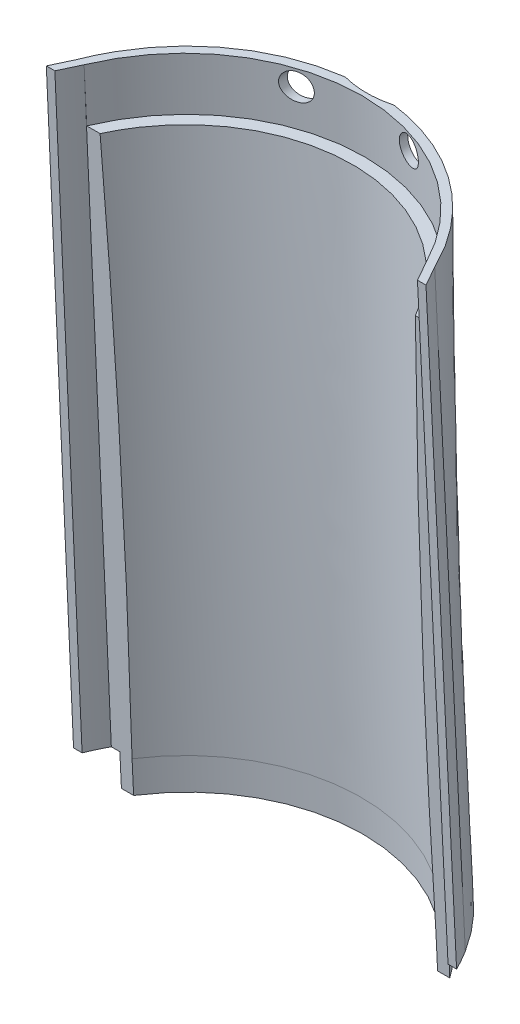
ISO-10303-21;
HEADER;
FILE_DESCRIPTION(('STEP AP214'),'2;1');
FILE_NAME('part.step','',(''),(''),'','','');
FILE_SCHEMA(('AUTOMOTIVE_DESIGN { 1 0 10303 214 1 1 1 1 }'));
ENDSEC;
DATA;
#1=APPLICATION_CONTEXT('core data for automotive mechanical design processes');
#2=APPLICATION_PROTOCOL_DEFINITION('international standard','automotive_design',2000,#1);
#3=PRODUCT_CONTEXT('',#1,'mechanical');
#4=PRODUCT('Part','Part','',(#3));
#5=PRODUCT_RELATED_PRODUCT_CATEGORY('part','',(#4));
#6=PRODUCT_DEFINITION_FORMATION('','',#4);
#7=PRODUCT_DEFINITION_CONTEXT('part definition',#1,'design');
#8=PRODUCT_DEFINITION('design','',#6,#7);
#9=PRODUCT_DEFINITION_SHAPE('','',#8);
#10=(LENGTH_UNIT() NAMED_UNIT(*) SI_UNIT(.MILLI.,.METRE.));
#11=(NAMED_UNIT(*) PLANE_ANGLE_UNIT() SI_UNIT($,.RADIAN.));
#12=(NAMED_UNIT(*) SI_UNIT($,.STERADIAN.) SOLID_ANGLE_UNIT());
#13=UNCERTAINTY_MEASURE_WITH_UNIT(LENGTH_MEASURE(1.E-05),#10,'distance_accuracy_value','');
#14=(GEOMETRIC_REPRESENTATION_CONTEXT(3) GLOBAL_UNCERTAINTY_ASSIGNED_CONTEXT((#13)) GLOBAL_UNIT_ASSIGNED_CONTEXT((#10,
#11,#12)) REPRESENTATION_CONTEXT('',''));
#15=CARTESIAN_POINT('',(0.,0.,0.));
#16=DIRECTION('',(0.,0.,1.));
#17=DIRECTION('',(1.,0.,0.));
#18=AXIS2_PLACEMENT_3D('',#15,#16,#17);
#19=CARTESIAN_POINT('',(0.,1.28300316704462,-26.8820564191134));
#20=DIRECTION('',(0.,-0.0476728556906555,0.998863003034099));
#21=DIRECTION('',(0.,-0.998863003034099,-0.0476728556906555));
#22=AXIS2_PLACEMENT_3D('',#19,#20,#21);
#23=PLANE('',#22);
#24=DIRECTION('',(0.,0.998863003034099,0.0476728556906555));
#25=VECTOR('',#24,1.);
#26=CARTESIAN_POINT('',(-32.0087452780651,237.288751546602,-15.6181814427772));
#27=LINE('',#26,#25);
#28=CARTESIAN_POINT('',(-32.0087452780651,237.288751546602,-15.6181814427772));
#29=VERTEX_POINT('',#28);
#30=CARTESIAN_POINT('',(-32.0087452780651,247.437199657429,-15.1338252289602));
#31=VERTEX_POINT('',#30);
#32=EDGE_CURVE('E166',#29,#31,#27,.T.);
#33=ORIENTED_EDGE('',*,*,#32,.T.);
#34=DIRECTION('',(-0.00278661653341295,-0.99885912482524,-0.047672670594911));
#35=VECTOR('',#34,1.);
#36=CARTESIAN_POINT('',(-31.9948088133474,252.432707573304,-14.8954040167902));
#37=LINE('',#36,#35);
#38=CARTESIAN_POINT('',(-32.3251333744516,134.028292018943,-20.5465059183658));
#39=VERTEX_POINT('',#38);
#40=EDGE_CURVE('E445',#31,#39,#37,.T.);
#41=ORIENTED_EDGE('',*,*,#40,.T.);
#42=DIRECTION('',(-1.,0.,0.));
#43=VECTOR('',#42,1.);
#44=CARTESIAN_POINT('',(-50.8,134.028292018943,-20.5465059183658));
#45=LINE('',#44,#43);
#46=CARTESIAN_POINT('',(-30.7282510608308,134.028292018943,-20.5465059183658));
#47=VERTEX_POINT('',#46);
#48=EDGE_CURVE('E273',#47,#39,#45,.T.);
#49=ORIENTED_EDGE('',*,*,#48,.F.);
#50=DIRECTION('',(0.,0.998863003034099,0.0476728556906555));
#51=VECTOR('',#50,1.);
#52=CARTESIAN_POINT('',(-30.7282510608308,127.939223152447,-20.837119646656));
#53=LINE('',#52,#51);
#54=CARTESIAN_POINT('',(-30.7282510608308,127.939223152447,-20.837119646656));
#55=VERTEX_POINT('',#54);
#56=EDGE_CURVE('E369',#55,#47,#53,.T.);
#57=ORIENTED_EDGE('',*,*,#56,.F.);
#58=DIRECTION('',(-1.,0.,0.));
#59=VECTOR('',#58,1.);
#60=CARTESIAN_POINT('',(-28.4422510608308,127.939223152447,-20.837119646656));
#61=LINE('',#60,#59);
#62=CARTESIAN_POINT('',(-28.4422510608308,127.939223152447,-20.837119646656));
#63=VERTEX_POINT('',#62);
#64=EDGE_CURVE('E386',#63,#55,#61,.T.);
#65=ORIENTED_EDGE('',*,*,#64,.F.);
#66=DIRECTION('',(0.,0.998863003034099,0.0476728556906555));
#67=VECTOR('',#66,1.);
#68=CARTESIAN_POINT('',(-28.4422510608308,127.939223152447,-20.837119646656));
#69=LINE('',#68,#67);
#70=CARTESIAN_POINT('',(-28.4422510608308,134.028292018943,-20.5465059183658));
#71=VERTEX_POINT('',#70);
#72=EDGE_CURVE('E367',#63,#71,#69,.T.);
#73=ORIENTED_EDGE('',*,*,#72,.T.);
#74=CARTESIAN_POINT('',(-28.4422510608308,134.028292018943,-20.5465059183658));
#75=CARTESIAN_POINT('',(-28.3698801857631,137.78230969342,-20.3673374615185));
#76=CARTESIAN_POINT('',(-28.3094612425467,141.536559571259,-20.1881579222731));
#77=CARTESIAN_POINT('',(-28.2128423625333,149.045376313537,-19.8297837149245));
#78=CARTESIAN_POINT('',(-28.1766424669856,152.799943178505,-19.650589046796));
#79=CARTESIAN_POINT('',(-28.1287770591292,160.309235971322,-19.2921921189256));
#80=CARTESIAN_POINT('',(-28.1171115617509,164.063961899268,-19.1129898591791));
#81=CARTESIAN_POINT('',(-28.1184122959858,171.572281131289,-18.7546393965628));
#82=CARTESIAN_POINT('',(-28.1313711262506,175.325874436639,-18.5754911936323));
#83=CARTESIAN_POINT('',(-28.1818032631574,182.832890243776,-18.2172029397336));
#84=CARTESIAN_POINT('',(-28.2192765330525,186.586312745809,-18.0380628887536));
#85=CARTESIAN_POINT('',(-28.31844557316,194.092826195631,-17.6797986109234));
#86=CARTESIAN_POINT('',(-28.3801412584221,197.845917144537,-17.5006743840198));
#87=CARTESIAN_POINT('',(-28.5044722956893,204.188275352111,-17.1979718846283));
#88=CARTESIAN_POINT('',(-28.5608877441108,206.777666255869,-17.0743877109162));
#89=CARTESIAN_POINT('',(-28.6848139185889,211.956179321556,-16.8272321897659));
#90=CARTESIAN_POINT('',(-28.7523246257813,214.545301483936,-16.7036608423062));
#91=CARTESIAN_POINT('',(-28.8982000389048,219.723240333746,-16.4565327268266));
#92=CARTESIAN_POINT('',(-28.9765647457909,222.312057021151,-16.3329759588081));
#93=CARTESIAN_POINT('',(-29.1438904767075,227.48988958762,-16.0858529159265));
#94=CARTESIAN_POINT('',(-29.2328537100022,230.078905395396,-15.9622866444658));
#95=CARTESIAN_POINT('',(-29.4210763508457,235.256562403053,-15.7151719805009));
#96=CARTESIAN_POINT('',(-29.5203357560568,237.845203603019,-15.5916235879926));
#97=CARTESIAN_POINT('',(-29.7288373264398,243.022078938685,-15.3445462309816));
#98=CARTESIAN_POINT('',(-29.8380794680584,245.610313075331,-15.2210172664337));
#99=CARTESIAN_POINT('',(-29.9521564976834,248.198333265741,-15.0974985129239));
#100=B_SPLINE_CURVE_WITH_KNOTS('',3,(#74,#75,#76,#77,#78,#79,#80,#81,#82,#83,#84,#85,#86,#87,
#88,#89,#90,#91,#92,#93,#94,#95,#96,#97,#98,#99),.UNSPECIFIED.,.F.,.F.,(4,2,2,2,2,2,2,2,2,2,2,2,
4),(0.,11.2769471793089,22.553913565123,33.8308868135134,45.1044710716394,56.3780384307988,
67.651566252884,75.4304006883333,83.2092218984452,90.9880437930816,98.7684900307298,
106.548934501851,114.329360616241),.UNSPECIFIED.);
#101=CARTESIAN_POINT('',(-29.5003939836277,237.288751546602,-15.6181814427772));
#102=VERTEX_POINT('',#101);
#103=EDGE_CURVE('E190',#71,#102,#100,.T.);
#104=ORIENTED_EDGE('',*,*,#103,.T.);
#105=DIRECTION('',(1.,0.,0.));
#106=VECTOR('',#105,1.);
#107=CARTESIAN_POINT('',(0.,237.288751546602,-15.6181814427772));
#108=LINE('',#107,#106);
#109=EDGE_CURVE('E183',#29,#102,#108,.T.);
#110=ORIENTED_EDGE('',*,*,#109,.F.);
#111=EDGE_LOOP('',(#33,#41,#49,#57,#65,#73,#104,#110));
#112=FACE_BOUND('',#111,.T.);
#113=ADVANCED_FACE('F58',(#112),#23,.T.);
#114=CARTESIAN_POINT('',(-26.1244297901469,254.,-25.9607986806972));
#115=CARTESIAN_POINT('',(-5.96899524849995,0.,-47.249462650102));
#116=CARTESIAN_POINT('',(25.7971675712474,254.,-78.2096582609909));
#117=CARTESIAN_POINT('',(88.5299300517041,0.,-59.1874531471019));
#118=CARTESIAN_POINT('',(78.0460271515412,254.,-26.2880608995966));
#119=CARTESIAN_POINT('',(100.467920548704,0.,35.3114721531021));
#120=CARTESIAN_POINT('',(26.1244297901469,254.,25.9607986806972));
#121=CARTESIAN_POINT('',(5.96899524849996,0.,47.249462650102));
#122=CARTESIAN_POINT('',(-25.7971675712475,254.,78.2096582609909));
#123=CARTESIAN_POINT('',(-88.529930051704,0.,59.1874531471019));
#124=CARTESIAN_POINT('',(-78.0460271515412,254.,26.2880608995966));
#125=CARTESIAN_POINT('',(-100.467920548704,0.,-35.3114721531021));
#126=CARTESIAN_POINT('',(-26.1244297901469,254.,-25.9607986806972));
#127=CARTESIAN_POINT('',(-5.96899524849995,0.,-47.249462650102));
#128=(BOUNDED_SURFACE() B_SPLINE_SURFACE(3,1,((#114,#115),(#116,#117),(#118,#119),(#120,#121),
(#122,#123),(#124,#125),(#126,#127)),.UNSPECIFIED.,.T.,.F.,.F.) B_SPLINE_SURFACE_WITH_KNOTS((4,
3,4),(2,2),(0.,0.5,1.),(0.,1.),
.UNSPECIFIED.) GEOMETRIC_REPRESENTATION_ITEM() RATIONAL_B_SPLINE_SURFACE(((1.,1.),
(0.333333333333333,0.333333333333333),(0.333333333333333,0.333333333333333),(1.,1.),
(0.333333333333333,0.333333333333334),(0.333333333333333,0.333333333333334),(1.,1.))) REPRESENTATION_ITEM('') SURFACE());
#129=CARTESIAN_POINT('',(12.7,245.246659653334,-34.6118476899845));
#130=CARTESIAN_POINT('',(12.700000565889,245.178229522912,-34.6122812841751));
#131=CARTESIAN_POINT('',(12.6972327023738,245.109814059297,-34.6137337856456));
#132=CARTESIAN_POINT('',(12.6861939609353,244.973492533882,-34.618656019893));
#133=CARTESIAN_POINT('',(12.6779225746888,244.905586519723,-34.6221259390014));
#134=CARTESIAN_POINT('',(12.655949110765,244.770731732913,-34.6310400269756));
#135=CARTESIAN_POINT('',(12.6422426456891,244.703783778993,-34.6364857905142));
#136=CARTESIAN_POINT('',(12.6095330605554,244.571344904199,-34.6492769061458));
#137=CARTESIAN_POINT('',(12.5905260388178,244.505855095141,-34.6566236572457));
#138=CARTESIAN_POINT('',(12.5259331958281,244.312676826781,-34.681327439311));
#139=CARTESIAN_POINT('',(12.4726961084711,244.18779900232,-34.701380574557));
#140=CARTESIAN_POINT('',(12.3476444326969,243.948968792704,-34.7476888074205));
#141=CARTESIAN_POINT('',(12.2758228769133,243.835020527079,-34.7739462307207));
#142=CARTESIAN_POINT('',(12.1547230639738,243.672670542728,-34.8175014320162));
#143=CARTESIAN_POINT('',(12.1113698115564,243.619248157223,-34.8329807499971));
#144=CARTESIAN_POINT('',(12.0207072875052,243.516323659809,-34.8650856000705));
#145=CARTESIAN_POINT('',(11.9734019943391,243.466817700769,-34.8817099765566));
#146=CARTESIAN_POINT('',(11.8751121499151,243.371917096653,-34.9159566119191));
#147=CARTESIAN_POINT('',(11.8241254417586,243.32652489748,-34.933579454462));
#148=CARTESIAN_POINT('',(11.7188451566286,243.240108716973,-34.9696447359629));
#149=CARTESIAN_POINT('',(11.664550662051,243.199085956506,-34.9880874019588));
#150=CARTESIAN_POINT('',(11.4909494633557,243.078548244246,-35.0465057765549));
#151=CARTESIAN_POINT('',(11.3664282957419,243.006901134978,-35.0876414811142));
#152=CARTESIAN_POINT('',(11.1075713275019,242.885691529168,-35.1713066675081));
#153=CARTESIAN_POINT('',(10.9732332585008,242.836134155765,-35.2138364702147));
#154=CARTESIAN_POINT('',(10.692980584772,242.758804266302,-35.3005209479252));
#155=CARTESIAN_POINT('',(10.5468209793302,242.731914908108,-35.344676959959));
#156=CARTESIAN_POINT('',(10.251643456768,242.703986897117,-35.4316182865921));
#157=CARTESIAN_POINT('',(10.1026254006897,242.702949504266,-35.474403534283));
#158=CARTESIAN_POINT('',(9.80563647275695,242.727083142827,-35.557470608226));
#159=CARTESIAN_POINT('',(9.65766865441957,242.752312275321,-35.5977466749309));
#160=CARTESIAN_POINT('',(9.36760247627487,242.82876954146,-35.6746352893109));
#161=CARTESIAN_POINT('',(9.22550337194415,242.879994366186,-35.7112483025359));
#162=CARTESIAN_POINT('',(8.95524043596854,243.005722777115,-35.7790860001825));
#163=CARTESIAN_POINT('',(8.82681354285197,243.079599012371,-35.8104243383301));
#164=CARTESIAN_POINT('',(8.58404703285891,243.249190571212,-35.868223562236));
#165=CARTESIAN_POINT('',(8.46970474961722,243.344901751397,-35.8946853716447));
#166=CARTESIAN_POINT('',(8.2624939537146,243.552015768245,-35.9415362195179));
#167=CARTESIAN_POINT('',(8.16903949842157,243.662793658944,-35.9620974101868));
#168=CARTESIAN_POINT('',(8.00202341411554,243.899191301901,-35.9980602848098));
#169=CARTESIAN_POINT('',(7.92845879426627,244.024808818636,-36.013462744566));
#170=CARTESIAN_POINT('',(7.80529713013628,244.283841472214,-36.0386724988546));
#171=CARTESIAN_POINT('',(7.75513678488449,244.416976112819,-36.0486124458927));
#172=CARTESIAN_POINT('',(7.67768921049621,244.690006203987,-36.0634559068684));
#173=CARTESIAN_POINT('',(7.65039998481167,244.829901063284,-36.0683598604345));
#174=CARTESIAN_POINT('',(7.61978301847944,245.110469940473,-36.0731050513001));
#175=CARTESIAN_POINT('',(7.61613945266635,245.251108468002,-36.0730131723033));
#176=CARTESIAN_POINT('',(7.63207413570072,245.530971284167,-36.0679573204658));
#177=CARTESIAN_POINT('',(7.65165162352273,245.670195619,-36.0629935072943));
#178=CARTESIAN_POINT('',(7.71330954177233,245.942940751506,-36.0482518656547));
#179=CARTESIAN_POINT('',(7.7553352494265,246.076474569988,-36.0384857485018));
#180=CARTESIAN_POINT('',(7.86050883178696,246.334477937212,-36.0142110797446));
#181=CARTESIAN_POINT('',(7.92365699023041,246.458947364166,-35.9997024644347));
#182=CARTESIAN_POINT('',(8.06963169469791,246.696320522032,-35.965931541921));
#183=CARTESIAN_POINT('',(8.15260001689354,246.80913212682,-35.9466349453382));
#184=CARTESIAN_POINT('',(8.33538153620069,247.019158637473,-35.9035370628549));
#185=CARTESIAN_POINT('',(8.43519583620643,247.116372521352,-35.8797354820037));
#186=CARTESIAN_POINT('',(8.65054426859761,247.294339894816,-35.8274696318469));
#187=CARTESIAN_POINT('',(8.7663231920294,247.374775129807,-35.7989309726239));
#188=CARTESIAN_POINT('',(9.00876992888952,247.515116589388,-35.7379426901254));
#189=CARTESIAN_POINT('',(9.13543906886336,247.575020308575,-35.7054925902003));
#190=CARTESIAN_POINT('',(9.39963161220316,247.674394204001,-35.6363439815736));
#191=CARTESIAN_POINT('',(9.53735645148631,247.713264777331,-35.5995539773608));
#192=CARTESIAN_POINT('',(9.81664909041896,247.767363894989,-35.5232693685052));
#193=CARTESIAN_POINT('',(9.95821754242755,247.78258840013,-35.4837743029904));
#194=CARTESIAN_POINT('',(10.2457921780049,247.789408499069,-35.4017925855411));
#195=CARTESIAN_POINT('',(10.3917999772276,247.780257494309,-35.3592511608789));
#196=CARTESIAN_POINT('',(10.6799964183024,247.737124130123,-35.2735002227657));
#197=CARTESIAN_POINT('',(10.8221844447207,247.703137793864,-35.2302906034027));
#198=CARTESIAN_POINT('',(11.0309725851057,247.633824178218,-35.1656273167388));
#199=CARTESIAN_POINT('',(11.1005154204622,247.607290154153,-35.1438736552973));
#200=CARTESIAN_POINT('',(11.2371054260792,247.548175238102,-35.100754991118));
#201=CARTESIAN_POINT('',(11.3041532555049,247.515595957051,-35.0793898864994));
#202=CARTESIAN_POINT('',(11.43524037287,247.444594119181,-35.0372614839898));
#203=CARTESIAN_POINT('',(11.4992809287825,247.40617405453,-35.0164979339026));
#204=CARTESIAN_POINT('',(11.6239667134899,247.323677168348,-34.9757568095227));
#205=CARTESIAN_POINT('',(11.6846078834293,247.279593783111,-34.9557801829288));
#206=CARTESIAN_POINT('',(11.8594843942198,247.140174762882,-34.8977672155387));
#207=CARTESIAN_POINT('',(11.9680533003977,247.036922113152,-34.8612014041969));
#208=CARTESIAN_POINT('',(12.1660448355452,246.811848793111,-34.7938767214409));
#209=CARTESIAN_POINT('',(12.2554773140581,246.69003773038,-34.7631148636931));
#210=CARTESIAN_POINT('',(12.3710337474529,246.498928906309,-34.7231955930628));
#211=CARTESIAN_POINT('',(12.4058586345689,246.435354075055,-34.7111348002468));
#212=CARTESIAN_POINT('',(12.4700388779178,246.305229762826,-34.6888966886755));
#213=CARTESIAN_POINT('',(12.4993988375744,246.238682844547,-34.6787177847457));
#214=CARTESIAN_POINT('',(12.5523431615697,246.103154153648,-34.6603991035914));
#215=CARTESIAN_POINT('',(12.5759343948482,246.034175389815,-34.6522569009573));
#216=CARTESIAN_POINT('',(12.6171410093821,245.894252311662,-34.6381223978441));
#217=CARTESIAN_POINT('',(12.6347572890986,245.823308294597,-34.6321297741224));
#218=CARTESIAN_POINT('',(12.6661115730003,245.668748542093,-34.6216256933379));
#219=CARTESIAN_POINT('',(12.6788057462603,245.584892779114,-34.617494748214));
#220=CARTESIAN_POINT('',(12.6957494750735,245.41623703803,-34.6123372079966));
#221=CARTESIAN_POINT('',(12.6999992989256,245.33143709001,-34.6113105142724));
#222=CARTESIAN_POINT('',(12.7,245.246659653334,-34.6118476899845));
#223=B_SPLINE_CURVE_WITH_KNOTS('',3,(#129,#130,#131,#132,#133,#134,#135,#136,#137,#138,#139,
#140,#141,#142,#143,#144,#145,#146,#147,#148,#149,#150,#151,#152,#153,#154,#155,#156,#157,#158,
#159,#160,#161,#162,#163,#164,#165,#166,#167,#168,#169,#170,#171,#172,#173,#174,#175,#176,#177,
#178,#179,#180,#181,#182,#183,#184,#185,#186,#187,#188,#189,#190,#191,#192,#193,#194,#195,#196,
#197,#198,#199,#200,#201,#202,#203,#204,#205,#206,#207,#208,#209,#210,#211,#212,#213,#214,#215,
#216,#217,#218,#219,#220,#221,#222),.UNSPECIFIED.,.T.,.F.,(4,2,2,2,2,2,2,2,2,2,2,2,2,2,2,2,2,2,
2,2,2,2,2,2,2,2,2,2,2,2,2,2,2,2,2,2,2,2,2,2,2,2,2,2,2,2,4),(0.,0.205216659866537,
0.410452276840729,0.615853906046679,0.821407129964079,1.23106784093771,1.64088235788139,
1.85224784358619,2.06340305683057,2.27468300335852,2.48602182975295,2.93214770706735,
3.37837699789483,3.84127925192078,4.30420406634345,4.76815504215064,5.23204697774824,
5.68410190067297,6.13607111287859,6.57306598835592,7.00999511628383,7.43578334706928,
7.86153440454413,8.28158697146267,8.7016257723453,9.12064527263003,9.53967040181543,
9.96178769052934,10.3839326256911,10.81347414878,11.2430680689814,11.6843377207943,
12.1256827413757,12.5806999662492,13.0357900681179,13.2682004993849,13.500549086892,
13.7327988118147,13.9653201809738,14.4255304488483,14.8855032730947,15.1057200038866,
15.3257503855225,15.5455174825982,15.7652515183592,16.0195005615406,16.2737415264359),.UNSPECIFIED.);
#224=CARTESIAN_POINT('',(12.7,245.246659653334,-34.6118476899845));
#225=VERTEX_POINT('',#224);
#226=EDGE_CURVE('E198',#225,#225,#223,.T.);
#227=CARTESIAN_POINT('',(-8.16650891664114,245.246659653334,-35.9524426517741));
#228=CARTESIAN_POINT('',(-8.16651536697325,245.106960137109,-35.9532946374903));
#229=CARTESIAN_POINT('',(-8.17807702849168,244.967145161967,-35.951538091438));
#230=CARTESIAN_POINT('',(-8.2240027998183,244.691368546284,-35.9427860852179));
#231=CARTESIAN_POINT('',(-8.25839349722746,244.555411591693,-35.9357845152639));
#232=CARTESIAN_POINT('',(-8.34884995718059,244.291416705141,-35.9165700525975));
#233=CARTESIAN_POINT('',(-8.4048982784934,244.163372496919,-35.9043613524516));
#234=CARTESIAN_POINT('',(-8.53686196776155,243.918670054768,-35.8748195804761));
#235=CARTESIAN_POINT('',(-8.61277290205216,243.802009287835,-35.8574876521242));
#236=CARTESIAN_POINT('',(-8.78273391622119,243.582289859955,-35.8177115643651));
#237=CARTESIAN_POINT('',(-8.87691840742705,243.479342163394,-35.7952292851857));
#238=CARTESIAN_POINT('',(-9.08013747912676,243.29070881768,-35.7455078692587));
#239=CARTESIAN_POINT('',(-9.18917383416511,243.205025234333,-35.7182681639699));
#240=CARTESIAN_POINT('',(-9.42149114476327,243.051169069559,-35.65877040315));
#241=CARTESIAN_POINT('',(-9.5450404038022,242.983440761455,-35.626412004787));
#242=CARTESIAN_POINT('',(-9.80067359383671,242.869549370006,-35.5577396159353));
#243=CARTESIAN_POINT('',(-9.93275885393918,242.823389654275,-35.5214250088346));
#244=CARTESIAN_POINT('',(-10.2063469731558,242.752250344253,-35.4443082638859));
#245=CARTESIAN_POINT('',(-10.3480171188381,242.728033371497,-35.4033964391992));
#246=CARTESIAN_POINT('',(-10.6326899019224,242.703714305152,-35.3191192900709));
#247=CARTESIAN_POINT('',(-10.7756927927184,242.703616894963,-35.2757534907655));
#248=CARTESIAN_POINT('',(-11.0642367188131,242.727670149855,-35.1861672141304));
#249=CARTESIAN_POINT('',(-11.2096933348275,242.75266333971,-35.1398999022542));
#250=CARTESIAN_POINT('',(-11.4941247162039,242.827384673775,-35.0473572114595));
#251=CARTESIAN_POINT('',(-11.6330983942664,242.877116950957,-35.0010818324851));
#252=CARTESIAN_POINT('',(-11.9030805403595,243.001162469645,-34.9093112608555));
#253=CARTESIAN_POINT('',(-12.0339124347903,243.075881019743,-34.8638428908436));
#254=CARTESIAN_POINT('',(-12.281092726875,243.247921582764,-34.7763185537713));
#255=CARTESIAN_POINT('',(-12.3974415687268,243.345242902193,-34.7342624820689));
#256=CARTESIAN_POINT('',(-12.6096720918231,243.557967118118,-34.6562796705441));
#257=CARTESIAN_POINT('',(-12.7059206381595,243.672963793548,-34.6202460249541));
#258=CARTESIAN_POINT('',(-12.8773702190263,243.919455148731,-34.555137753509));
#259=CARTESIAN_POINT('',(-12.9525792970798,244.050943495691,-34.52606046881));
#260=CARTESIAN_POINT('',(-13.0752563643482,244.318716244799,-34.4779683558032));
#261=CARTESIAN_POINT('',(-13.1240583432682,244.454303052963,-34.4584754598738));
#262=CARTESIAN_POINT('',(-13.1981253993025,244.732689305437,-34.4283306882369));
#263=CARTESIAN_POINT('',(-13.2234006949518,244.875485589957,-34.4176749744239));
#264=CARTESIAN_POINT('',(-13.2485074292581,245.155123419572,-34.4062096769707));
#265=CARTESIAN_POINT('',(-13.2497566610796,245.291816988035,-34.4048545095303));
#266=CARTESIAN_POINT('',(-13.2303508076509,245.563445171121,-34.4106084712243));
#267=CARTESIAN_POINT('',(-13.2096989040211,245.698380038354,-34.417716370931));
#268=CARTESIAN_POINT('',(-13.1479221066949,245.959974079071,-34.4397541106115));
#269=CARTESIAN_POINT('',(-13.1072054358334,246.086743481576,-34.4545282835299));
#270=CARTESIAN_POINT('',(-13.0069764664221,246.331532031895,-34.4910238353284));
#271=CARTESIAN_POINT('',(-12.9474620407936,246.449550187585,-34.5127460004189));
#272=CARTESIAN_POINT('',(-12.8094602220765,246.677570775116,-34.5628751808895));
#273=CARTESIAN_POINT('',(-12.7304383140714,246.787207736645,-34.5914697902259));
#274=CARTESIAN_POINT('',(-12.5569199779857,246.991820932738,-34.6536683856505));
#275=CARTESIAN_POINT('',(-12.4624195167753,247.086793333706,-34.6872736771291));
#276=CARTESIAN_POINT('',(-12.254530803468,247.265345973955,-34.7602858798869));
#277=CARTESIAN_POINT('',(-12.1403548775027,247.347916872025,-34.7999186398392));
#278=CARTESIAN_POINT('',(-11.9006658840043,247.492815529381,-34.8818219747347));
#279=CARTESIAN_POINT('',(-11.7751497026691,247.555137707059,-34.9240932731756));
#280=CARTESIAN_POINT('',(-11.5091703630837,247.660964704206,-35.0121062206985));
#281=CARTESIAN_POINT('',(-11.3682688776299,247.703315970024,-35.0579137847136));
#282=CARTESIAN_POINT('',(-11.0812209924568,247.763143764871,-35.149382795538));
#283=CARTESIAN_POINT('',(-10.9350738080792,247.780616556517,-35.1950442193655));
#284=CARTESIAN_POINT('',(-10.6386436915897,247.790161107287,-35.2857418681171));
#285=CARTESIAN_POINT('',(-10.4883353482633,247.781736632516,-35.3307490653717));
#286=CARTESIAN_POINT('',(-10.1907638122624,247.738287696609,-35.4179545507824));
#287=CARTESIAN_POINT('',(-10.0435004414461,247.703264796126,-35.4601530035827));
#288=CARTESIAN_POINT('',(-9.75889554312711,247.607969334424,-35.5400245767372));
#289=CARTESIAN_POINT('',(-9.6214322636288,247.548113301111,-35.577759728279));
#290=CARTESIAN_POINT('',(-9.35829570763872,247.404522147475,-35.6486432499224));
#291=CARTESIAN_POINT('',(-9.23261976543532,247.320792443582,-35.6817926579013));
#292=CARTESIAN_POINT('',(-9.00138181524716,247.134884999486,-35.7418184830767));
#293=CARTESIAN_POINT('',(-8.89527797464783,247.033438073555,-35.7688709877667));
#294=CARTESIAN_POINT('',(-8.70160993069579,246.813021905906,-35.8176917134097));
#295=CARTESIAN_POINT('',(-8.61404687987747,246.694051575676,-35.8394596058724));
#296=CARTESIAN_POINT('',(-8.46303706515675,246.446171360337,-35.8768085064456));
#297=CARTESIAN_POINT('',(-8.39890408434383,246.317705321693,-35.8925662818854));
#298=CARTESIAN_POINT('',(-8.29313083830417,246.051439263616,-35.9186881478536));
#299=CARTESIAN_POINT('',(-8.25146007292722,245.913652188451,-35.9290595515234));
#300=CARTESIAN_POINT('',(-8.20337968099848,245.686860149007,-35.9413991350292));
#301=CARTESIAN_POINT('',(-8.1895741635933,245.599444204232,-35.9450648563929));
#302=CARTESIAN_POINT('',(-8.17113679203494,245.423587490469,-35.9503167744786));
#303=CARTESIAN_POINT('',(-8.16650483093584,245.335146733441,-35.9519029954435));
#304=CARTESIAN_POINT('',(-8.16650891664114,245.246659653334,-35.9524426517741));
#305=B_SPLINE_CURVE_WITH_KNOTS('',3,(#227,#228,#229,#230,#231,#232,#233,#234,#235,#236,#237,
#238,#239,#240,#241,#242,#243,#244,#245,#246,#247,#248,#249,#250,#251,#252,#253,#254,#255,#256,
#257,#258,#259,#260,#261,#262,#263,#264,#265,#266,#267,#268,#269,#270,#271,#272,#273,#274,#275,
#276,#277,#278,#279,#280,#281,#282,#283,#284,#285,#286,#287,#288,#289,#290,#291,#292,#293,#294,
#295,#296,#297,#298,#299,#300,#301,#302,#303,#304),.UNSPECIFIED.,.T.,.F.,(4,2,2,2,2,2,2,2,2,2,2,
2,2,2,2,2,2,2,2,2,2,2,2,2,2,2,2,2,2,2,2,2,2,2,2,2,2,2,4),(0.,0.418780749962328,0.8380500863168,
1.25698247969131,1.67582144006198,2.09786672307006,2.51996247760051,2.95169148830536,
3.38348788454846,3.82977231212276,4.27614339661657,4.73802194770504,5.19997768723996,
5.66982310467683,6.13965410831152,6.59996759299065,7.06010485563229,7.49408382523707,
7.92787421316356,8.33598232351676,8.74403115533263,9.14410104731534,9.54421622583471,
9.95682790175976,10.3695472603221,10.806737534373,11.2440482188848,11.7042118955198,
12.1644446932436,12.6335509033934,13.1026295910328,13.5641395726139,14.0255449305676,
14.4711328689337,14.916748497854,15.3480041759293,15.7786727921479,16.0439358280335,
16.3091957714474),.UNSPECIFIED.);
#306=CARTESIAN_POINT('',(-8.16650891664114,245.246659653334,-35.9524426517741));
#307=VERTEX_POINT('',#306);
#308=EDGE_CURVE('E192',#307,#307,#305,.T.);
#309=CARTESIAN_POINT('',(4.60706472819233,249.171392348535,-36.5585503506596));
#310=CARTESIAN_POINT('',(4.60563945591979,249.003051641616,-36.5594928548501));
#311=CARTESIAN_POINT('',(4.59806503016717,248.834764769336,-36.561238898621));
#312=CARTESIAN_POINT('',(4.57056400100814,248.499179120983,-36.5662864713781));
#313=CARTESIAN_POINT('',(4.55063381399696,248.331880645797,-36.5695884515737));
#314=CARTESIAN_POINT('',(4.49821803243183,247.998295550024,-36.5777189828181));
#315=CARTESIAN_POINT('',(4.46566096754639,247.832020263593,-36.5825561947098));
#316=CARTESIAN_POINT('',(4.38794055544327,247.502544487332,-36.5936445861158));
#317=CARTESIAN_POINT('',(4.34277819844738,247.33934375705,-36.5998956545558));
#318=CARTESIAN_POINT('',(4.18798875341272,246.855239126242,-36.6206085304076));
#319=CARTESIAN_POINT('',(4.05912709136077,246.540274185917,-36.6370187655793));
#320=CARTESIAN_POINT('',(3.74994399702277,245.937662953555,-36.6733406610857));
#321=CARTESIAN_POINT('',(3.56975114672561,245.649950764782,-36.69324352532));
#322=CARTESIAN_POINT('',(3.2019531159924,245.170707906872,-36.7297782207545));
#323=CARTESIAN_POINT('',(3.02409644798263,244.97174207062,-36.7462041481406));
#324=CARTESIAN_POINT('',(2.73474170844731,244.697129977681,-36.7701734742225));
#325=CARTESIAN_POINT('',(2.63446995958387,244.609525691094,-36.7780556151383));
#326=CARTESIAN_POINT('',(2.42674967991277,244.443278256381,-36.7933802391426));
#327=CARTESIAN_POINT('',(2.31930440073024,244.364631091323,-36.8008229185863));
#328=CARTESIAN_POINT('',(2.09674392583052,244.21667543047,-36.8151099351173));
#329=CARTESIAN_POINT('',(1.9815695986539,244.147455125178,-36.8219484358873));
#330=CARTESIAN_POINT('',(1.7451732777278,244.020275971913,-36.8347200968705));
#331=CARTESIAN_POINT('',(1.62395454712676,243.962311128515,-36.8406537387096));
#332=CARTESIAN_POINT('',(1.37640856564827,243.858638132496,-36.8513997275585));
#333=CARTESIAN_POINT('',(1.25008445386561,243.812922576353,-36.8562127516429));
#334=CARTESIAN_POINT('',(0.993400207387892,243.734587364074,-36.8645318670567));
#335=CARTESIAN_POINT('',(0.863040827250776,243.701965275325,-36.8680382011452));
#336=CARTESIAN_POINT('',(0.618202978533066,243.654116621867,-36.8732068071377));
#337=CARTESIAN_POINT('',(0.504078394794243,243.637085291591,-36.875059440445));
#338=CARTESIAN_POINT('',(0.274745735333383,243.613443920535,-36.877635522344));
#339=CARTESIAN_POINT('',(0.159537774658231,243.6068327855,-36.878359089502));
#340=CARTESIAN_POINT('',(-0.0709570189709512,243.604140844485,-36.8786534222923));
#341=CARTESIAN_POINT('',(-0.186243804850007,243.608056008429,-36.8782246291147));
#342=CARTESIAN_POINT('',(-0.415971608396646,243.626342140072,-36.8762293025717));
#343=CARTESIAN_POINT('',(-0.530412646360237,243.640712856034,-36.8746627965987));
#344=CARTESIAN_POINT('',(-0.748783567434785,243.678179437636,-36.8706045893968));
#345=CARTESIAN_POINT('',(-0.852845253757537,243.700519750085,-36.8681932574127));
#346=CARTESIAN_POINT('',(-1.05878697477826,243.753608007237,-36.862509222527));
#347=CARTESIAN_POINT('',(-1.16066634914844,243.784358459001,-36.8592362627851));
#348=CARTESIAN_POINT('',(-1.46200489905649,243.888654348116,-36.848247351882));
#349=CARTESIAN_POINT('',(-1.65735321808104,243.974277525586,-36.839357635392));
#350=CARTESIAN_POINT('',(-2.04210438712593,244.17883023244,-36.8187803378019));
#351=CARTESIAN_POINT('',(-2.23072434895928,244.299208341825,-36.8069752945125));
#352=CARTESIAN_POINT('',(-2.49868846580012,244.499345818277,-36.7881771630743));
#353=CARTESIAN_POINT('',(-2.5855475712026,244.56935224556,-36.7817265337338));
#354=CARTESIAN_POINT('',(-2.7541342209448,244.715350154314,-36.7685839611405));
#355=CARTESIAN_POINT('',(-2.83585927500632,244.791344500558,-36.7618919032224));
#356=CARTESIAN_POINT('',(-3.09489452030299,245.049213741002,-36.7397747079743));
#357=CARTESIAN_POINT('',(-3.26107124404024,245.242430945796,-36.7241047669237));
#358=CARTESIAN_POINT('',(-3.56451674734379,245.650471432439,-36.6934866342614));
#359=CARTESIAN_POINT('',(-3.70175543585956,245.865316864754,-36.678539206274));
#360=CARTESIAN_POINT('',(-3.89677281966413,246.219692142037,-36.656182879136));
#361=CARTESIAN_POINT('',(-3.9640817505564,246.354051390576,-36.6481927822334));
#362=CARTESIAN_POINT('',(-4.08852249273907,246.627312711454,-36.6330056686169));
#363=CARTESIAN_POINT('',(-4.14566344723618,246.766210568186,-36.6258079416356));
#364=CARTESIAN_POINT('',(-4.24993660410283,247.047893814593,-36.6123368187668));
#365=CARTESIAN_POINT('',(-4.29705952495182,247.190682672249,-36.6060642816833));
#366=CARTESIAN_POINT('',(-4.38130370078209,247.479216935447,-36.5945656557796));
#367=CARTESIAN_POINT('',(-4.41842360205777,247.624962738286,-36.5893397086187));
#368=CARTESIAN_POINT('',(-4.50090870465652,248.001773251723,-36.577393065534));
#369=CARTESIAN_POINT('',(-4.53907322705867,248.234494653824,-36.5714973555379));
#370=CARTESIAN_POINT('',(-4.57812939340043,248.585165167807,-36.5649273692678));
#371=CARTESIAN_POINT('',(-4.58811516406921,248.702171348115,-36.5631171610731));
#372=CARTESIAN_POINT('',(-4.60208624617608,248.9365640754,-36.5602591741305));
#373=CARTESIAN_POINT('',(-4.60607088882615,249.053950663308,-36.5592114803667));
#374=CARTESIAN_POINT('',(-4.60706472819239,249.171392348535,-36.5585503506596));
#375=B_SPLINE_CURVE_WITH_KNOTS('',3,(#309,#310,#311,#312,#313,#314,#315,#316,#317,#318,#319,
#320,#321,#322,#323,#324,#325,#326,#327,#328,#329,#330,#331,#332,#333,#334,#335,#336,#337,#338,
#339,#340,#341,#342,#343,#344,#345,#346,#347,#348,#349,#350,#351,#352,#353,#354,#355,#356,#357,
#358,#359,#360,#361,#362,#363,#364,#365,#366,#367,#368,#369,#370,#371,#372,#373,#374),
.UNSPECIFIED.,.F.,.F.,(4,2,2,2,2,2,2,2,2,2,2,2,2,2,2,2,2,2,2,2,2,2,2,2,2,2,2,2,2,2,2,2,4),(0.,
0.504935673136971,1.01001786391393,1.51800164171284,2.02594552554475,3.04315898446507,
4.05784645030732,4.85647159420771,5.2562038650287,5.65575615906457,6.0588215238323,
6.46167159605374,6.86427763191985,7.2668088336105,7.61255580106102,7.95826645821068,
8.30384477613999,8.64941477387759,8.9684228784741,9.28752618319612,9.92516466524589,
10.5946160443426,10.92961230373,11.2647698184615,12.0276990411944,12.791417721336,
13.2425086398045,13.6931918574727,14.1442908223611,14.5954508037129,15.3016456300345,
15.6538547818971,16.0061031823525),.UNSPECIFIED.);
#376=CARTESIAN_POINT('',(4.56420136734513,248.460156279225,-36.5672700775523));
#377=VERTEX_POINT('',#376);
#378=CARTESIAN_POINT('',(-4.56420136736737,248.460156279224,-36.5672700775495));
#379=VERTEX_POINT('',#378);
#380=EDGE_CURVE('E73',#377,#379,#375,.T.);
#381=CARTESIAN_POINT('',(-25.6465737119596,247.978028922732,-26.4655219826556));
#382=CARTESIAN_POINT('',(-26.3909777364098,247.943611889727,-25.7444009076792));
#383=CARTESIAN_POINT('',(-27.104823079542,247.907700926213,-24.9919783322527));
#384=CARTESIAN_POINT('',(-28.4667607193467,247.833128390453,-23.4295011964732));
#385=CARTESIAN_POINT('',(-29.1148354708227,247.794466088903,-22.6194313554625));
#386=CARTESIAN_POINT('',(-30.3410511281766,247.714632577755,-20.9467239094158));
#387=CARTESIAN_POINT('',(-30.9191129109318,247.673458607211,-20.084028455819));
#388=CARTESIAN_POINT('',(-32.000342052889,247.588936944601,-18.3130927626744));
#389=CARTESIAN_POINT('',(-32.5035144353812,247.54558939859,-17.4048555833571));
#390=CARTESIAN_POINT('',(-33.4312152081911,247.457049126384,-15.5497201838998));
#391=CARTESIAN_POINT('',(-33.8557824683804,247.41185732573,-14.6028413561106));
#392=CARTESIAN_POINT('',(-34.623589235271,247.319929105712,-12.6767201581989));
#393=CARTESIAN_POINT('',(-34.96682745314,247.273192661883,-11.6974772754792));
#394=CARTESIAN_POINT('',(-35.5694669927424,247.178520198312,-9.71385745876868));
#395=CARTESIAN_POINT('',(-35.8288897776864,247.130584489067,-8.70948703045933));
#396=CARTESIAN_POINT('',(-36.2621890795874,247.033842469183,-6.682504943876));
#397=CARTESIAN_POINT('',(-36.4360658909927,246.985036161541,-5.65989334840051));
#398=CARTESIAN_POINT('',(-36.6971486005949,246.886861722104,-3.6028985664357));
#399=CARTESIAN_POINT('',(-36.7842884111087,246.837493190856,-2.56850701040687));
#400=CARTESIAN_POINT('',(-36.871050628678,246.738581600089,-0.496067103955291));
#401=CARTESIAN_POINT('',(-36.8706729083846,246.689038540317,0.541981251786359));
#402=CARTESIAN_POINT('',(-36.782400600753,246.590127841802,2.6144024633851));
#403=CARTESIAN_POINT('',(-36.6945023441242,246.540760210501,3.64877516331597));
#404=CARTESIAN_POINT('',(-36.4318037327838,246.44255325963,5.7064511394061));
#405=CARTESIAN_POINT('',(-36.2570033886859,246.393713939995,6.7297544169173));
#406=CARTESIAN_POINT('',(-35.8216712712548,246.296896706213,8.75831241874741));
#407=CARTESIAN_POINT('',(-35.5611146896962,246.248919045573,9.76356183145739));
#408=CARTESIAN_POINT('',(-34.9561244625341,246.154181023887,11.7485552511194));
#409=CARTESIAN_POINT('',(-34.6116907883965,246.107420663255,12.7282992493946));
#410=CARTESIAN_POINT('',(-33.8413827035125,246.015450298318,14.6553034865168));
#411=CARTESIAN_POINT('',(-33.4155084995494,245.970240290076,15.6025638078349));
#412=CARTESIAN_POINT('',(-32.4853324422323,245.881692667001,17.457853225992));
#413=CARTESIAN_POINT('',(-31.981030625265,245.838355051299,18.3658823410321));
#414=CARTESIAN_POINT('',(-30.8978062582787,245.753879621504,20.1358493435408));
#415=CARTESIAN_POINT('',(-30.3189161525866,245.712740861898,20.9978070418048));
#416=CARTESIAN_POINT('',(-29.090445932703,245.632936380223,22.669906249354));
#417=CARTESIAN_POINT('',(-28.4408658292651,245.594270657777,23.4800477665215));
#418=CARTESIAN_POINT('',(-27.0756260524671,245.5196885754,25.0427249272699));
#419=CARTESIAN_POINT('',(-26.3599667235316,245.483772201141,25.7952608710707));
#420=CARTESIAN_POINT('',(-24.8676471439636,245.414945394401,27.2373509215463));
#421=CARTESIAN_POINT('',(-24.0909869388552,245.382034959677,27.9269050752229));
#422=CARTESIAN_POINT('',(-22.482982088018,245.319486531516,29.2374477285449));
#423=CARTESIAN_POINT('',(-21.6516922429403,245.289845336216,29.8585033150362));
#424=CARTESIAN_POINT('',(-19.939646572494,245.234010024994,31.0283897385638));
#425=CARTESIAN_POINT('',(-19.0588907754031,245.2078159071,31.5772206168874));
#426=CARTESIAN_POINT('',(-17.2541789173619,245.159062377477,32.5987263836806));
#427=CARTESIAN_POINT('',(-16.3302230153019,245.136502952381,33.0714015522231));
#428=CARTESIAN_POINT('',(-14.445684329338,245.095180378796,33.9372106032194));
#429=CARTESIAN_POINT('',(-13.4851015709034,245.076417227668,34.330344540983));
#430=CARTESIAN_POINT('',(-11.5352339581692,245.042840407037,35.0338611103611));
#431=CARTESIAN_POINT('',(-10.5459820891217,245.028022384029,35.3443349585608));
#432=CARTESIAN_POINT('',(-8.54479747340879,245.002414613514,35.8808804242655));
#433=CARTESIAN_POINT('',(-7.53286474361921,244.991624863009,36.1069521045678));
#434=CARTESIAN_POINT('',(-5.4935250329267,244.974150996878,36.47307236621));
#435=CARTESIAN_POINT('',(-4.46611812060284,244.967466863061,36.6131213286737));
#436=CARTESIAN_POINT('',(-2.40314107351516,244.95825207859,36.8061936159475));
#437=CARTESIAN_POINT('',(-1.36757094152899,244.955721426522,36.8592169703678));
#438=CARTESIAN_POINT('',(0.703589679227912,244.95483207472,36.8778510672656));
#439=CARTESIAN_POINT('',(1.73917958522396,244.956470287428,36.8435265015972));
#440=CARTESIAN_POINT('',(3.8037814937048,244.963900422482,36.6878469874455));
#441=CARTESIAN_POINT('',(4.83279350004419,244.969692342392,36.5664920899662));
#442=CARTESIAN_POINT('',(6.87692205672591,244.985388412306,36.237621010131));
#443=CARTESIAN_POINT('',(7.89203862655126,244.995292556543,36.0301049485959));
#444=CARTESIAN_POINT('',(9.90116304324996,245.019142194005,35.5303966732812));
#445=CARTESIAN_POINT('',(10.8951708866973,245.033087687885,35.2382044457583));
#446=CARTESIAN_POINT('',(12.8549685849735,245.06491949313,34.5712502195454));
#447=CARTESIAN_POINT('',(13.8207598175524,245.082805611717,34.1964922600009));
#448=CARTESIAN_POINT('',(15.7173197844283,245.122391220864,33.3670768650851));
#449=CARTESIAN_POINT('',(16.648088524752,245.144090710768,32.9124194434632));
#450=CARTESIAN_POINT('',(18.4680043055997,245.191148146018,31.9264510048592));
#451=CARTESIAN_POINT('',(19.3571512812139,245.216506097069,31.3951398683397));
#452=CARTESIAN_POINT('',(21.0875228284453,245.270699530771,30.2596547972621));
#453=CARTESIAN_POINT('',(21.9287473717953,245.299535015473,29.6554808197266));
#454=CARTESIAN_POINT('',(23.5578608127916,245.360498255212,28.3781517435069));
#455=CARTESIAN_POINT('',(24.345713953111,245.392628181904,27.7049511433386));
#456=CARTESIAN_POINT('',(25.8618953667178,245.459935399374,26.2947002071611));
#457=CARTESIAN_POINT('',(26.5902236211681,245.495112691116,25.5576498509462));
#458=CARTESIAN_POINT('',(27.9822085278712,245.568264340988,24.0249437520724));
#459=CARTESIAN_POINT('',(28.6458649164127,245.606238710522,23.2292877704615));
#460=CARTESIAN_POINT('',(29.9038161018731,245.684714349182,21.5850310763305));
#461=CARTESIAN_POINT('',(30.4981108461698,245.725215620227,20.7364303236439));
#462=CARTESIAN_POINT('',(31.61375152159,245.808502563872,18.9913650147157));
#463=CARTESIAN_POINT('',(32.135017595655,245.851290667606,18.0948495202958));
#464=CARTESIAN_POINT('',(33.1001544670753,245.938806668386,16.261175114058));
#465=CARTESIAN_POINT('',(33.5440252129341,245.983534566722,15.3240161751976));
#466=CARTESIAN_POINT('',(34.3512415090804,246.074612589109,13.415708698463));
#467=CARTESIAN_POINT('',(34.7145866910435,246.120962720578,12.4445600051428));
#468=CARTESIAN_POINT('',(35.3581880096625,246.214956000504,10.4751707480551));
#469=CARTESIAN_POINT('',(35.6384440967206,246.262599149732,9.47693016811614));
#470=CARTESIAN_POINT('',(36.1141382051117,246.35889019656,7.45939707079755));
#471=CARTESIAN_POINT('',(36.3094883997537,246.407539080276,6.44008389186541));
#472=CARTESIAN_POINT('',(36.6135711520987,246.505448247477,4.38864721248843));
#473=CARTESIAN_POINT('',(36.7223036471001,246.554708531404,3.35652370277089));
#474=CARTESIAN_POINT('',(36.8523842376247,246.653490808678,1.28679323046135));
#475=CARTESIAN_POINT('',(36.8737320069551,246.703012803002,0.249186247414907));
#476=CARTESIAN_POINT('',(36.8288917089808,246.80196664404,-1.82413890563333));
#477=CARTESIAN_POINT('',(36.762703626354,246.851398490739,-2.85985707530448));
#478=CARTESIAN_POINT('',(36.5432003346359,246.949846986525,-4.9225940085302));
#479=CARTESIAN_POINT('',(36.3898391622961,246.998863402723,-5.9496078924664));
#480=CARTESIAN_POINT('',(35.9970385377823,247.096106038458,-7.98707910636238));
#481=CARTESIAN_POINT('',(35.757599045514,247.144332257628,-8.99753642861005));
#482=CARTESIAN_POINT('',(35.1943335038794,247.239651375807,-10.9947052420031));
#483=CARTESIAN_POINT('',(34.8705075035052,247.286744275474,-11.9814167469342));
#484=CARTESIAN_POINT('',(34.1407580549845,247.379461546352,-13.924070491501));
#485=CARTESIAN_POINT('',(33.7348346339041,247.425085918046,-14.8800127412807));
#486=CARTESIAN_POINT('',(32.8438553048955,247.514531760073,-16.7541220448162));
#487=CARTESIAN_POINT('',(32.3588159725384,247.55835360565,-17.672296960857));
#488=CARTESIAN_POINT('',(31.3129776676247,247.643892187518,-19.4645396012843));
#489=CARTESIAN_POINT('',(30.7521786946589,247.685608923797,-20.3386073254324));
#490=CARTESIAN_POINT('',(29.5587949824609,247.76663961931,-22.0363987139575));
#491=CARTESIAN_POINT('',(28.9262102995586,247.805953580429,-22.8601224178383));
#492=CARTESIAN_POINT('',(27.5937418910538,247.881897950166,-24.4513428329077));
#493=CARTESIAN_POINT('',(26.8938582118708,247.918528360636,-25.2188395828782));
#494=CARTESIAN_POINT('',(25.4323881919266,247.988813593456,-26.6914872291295));
#495=CARTESIAN_POINT('',(24.6708551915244,248.022470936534,-27.3966909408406));
#496=CARTESIAN_POINT('',(23.0909717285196,248.08660466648,-28.7404495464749));
#497=CARTESIAN_POINT('',(22.2726212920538,248.117081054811,-29.379004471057));
#498=CARTESIAN_POINT('',(20.5849198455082,248.174634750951,-30.5848952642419));
#499=CARTESIAN_POINT('',(19.7155689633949,248.201712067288,-31.1522313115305));
#500=CARTESIAN_POINT('',(17.9320490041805,248.252273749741,-32.2116223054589));
#501=CARTESIAN_POINT('',(17.0178799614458,248.275758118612,-32.7036773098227));
#502=CARTESIAN_POINT('',(15.1522664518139,248.318941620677,-33.6084773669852));
#503=CARTESIAN_POINT('',(14.2008643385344,248.338644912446,-34.0213095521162));
#504=CARTESIAN_POINT('',(12.2666019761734,248.374157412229,-34.7653833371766));
#505=CARTESIAN_POINT('',(11.2837417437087,248.389966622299,-35.0966249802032));
#506=CARTESIAN_POINT('',(9.29360148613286,248.417577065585,-35.6751313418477));
#507=CARTESIAN_POINT('',(8.28632252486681,248.429378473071,-35.9223997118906));
#508=CARTESIAN_POINT('',(6.25447739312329,248.448889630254,-36.3312062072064));
#509=CARTESIAN_POINT('',(5.22991124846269,248.456599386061,-36.492744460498));
#510=CARTESIAN_POINT('',(3.17182830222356,248.467866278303,-36.7288134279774));
#511=CARTESIAN_POINT('',(2.1383215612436,248.471427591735,-36.8034316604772));
#512=CARTESIAN_POINT('',(0.0686853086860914,248.47438615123,-36.8654207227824));
#513=CARTESIAN_POINT('',(-0.967444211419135,248.473783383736,-36.8527912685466));
#514=CARTESIAN_POINT('',(-3.03521513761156,248.468417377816,-36.7403603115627));
#515=CARTESIAN_POINT('',(-4.06685534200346,248.463653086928,-36.6405367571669));
#516=CARTESIAN_POINT('',(-6.11802687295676,248.449996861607,-36.3544054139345));
#517=CARTESIAN_POINT('',(-7.13755839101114,248.441104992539,-36.1680989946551));
#518=CARTESIAN_POINT('',(-9.15745172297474,248.419255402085,-35.7102965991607));
#519=CARTESIAN_POINT('',(-10.1578102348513,248.406296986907,-35.4387860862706));
#520=CARTESIAN_POINT('',(-12.1321257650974,248.376406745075,-34.8125123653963));
#521=CARTESIAN_POINT('',(-13.1060810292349,248.359474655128,-34.4577436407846));
#522=CARTESIAN_POINT('',(-15.0195547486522,248.321778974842,-33.6679268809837));
#523=CARTESIAN_POINT('',(-15.9591101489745,248.301019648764,-33.232968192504));
#524=CARTESIAN_POINT('',(-17.7979553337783,248.255813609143,-32.2857910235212));
#525=CARTESIAN_POINT('',(-18.6972556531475,248.231367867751,-31.7735929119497));
#526=CARTESIAN_POINT('',(-20.66513942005,248.172507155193,-30.5403169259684));
#527=CARTESIAN_POINT('',(-21.7209901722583,248.137118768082,-29.7988436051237));
#528=CARTESIAN_POINT('',(-23.7491505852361,248.061265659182,-28.2095353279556));
#529=CARTESIAN_POINT('',(-24.7214602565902,248.020800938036,-27.3617003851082));
#530=CARTESIAN_POINT('',(-25.6465737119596,247.978028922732,-26.4655219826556));
#531=B_SPLINE_CURVE_WITH_KNOTS('',3,(#381,#382,#383,#384,#385,#386,#387,#388,#389,#390,#391,
#392,#393,#394,#395,#396,#397,#398,#399,#400,#401,#402,#403,#404,#405,#406,#407,#408,#409,#410,
#411,#412,#413,#414,#415,#416,#417,#418,#419,#420,#421,#422,#423,#424,#425,#426,#427,#428,#429,
#430,#431,#432,#433,#434,#435,#436,#437,#438,#439,#440,#441,#442,#443,#444,#445,#446,#447,#448,
#449,#450,#451,#452,#453,#454,#455,#456,#457,#458,#459,#460,#461,#462,#463,#464,#465,#466,#467,
#468,#469,#470,#471,#472,#473,#474,#475,#476,#477,#478,#479,#480,#481,#482,#483,#484,#485,#486,
#487,#488,#489,#490,#491,#492,#493,#494,#495,#496,#497,#498,#499,#500,#501,#502,#503,#504,#505,
#506,#507,#508,#509,#510,#511,#512,#513,#514,#515,#516,#517,#518,#519,#520,#521,#522,#523,#524,
#525,#526,#527,#528,#529,#530),.UNSPECIFIED.,.T.,.F.,(4,2,2,2,2,2,2,2,2,2,2,2,2,2,2,2,2,2,2,2,2,
2,2,2,2,2,2,2,2,2,2,2,2,2,2,2,2,2,2,2,2,2,2,2,2,2,2,2,2,2,2,2,2,2,2,2,2,2,2,2,2,2,2,2,2,2,2,2,2,
2,2,2,2,2,4),(0.,3.10982651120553,6.2204804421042,9.3346176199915,12.4485458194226,
15.5609300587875,18.6733636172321,21.7849995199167,24.8966247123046,28.0106189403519,
31.1246176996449,34.2387470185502,37.3528759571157,40.4679065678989,43.5829382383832,
46.6979619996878,49.8129843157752,52.926656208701,56.0403276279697,59.1539828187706,
62.2676356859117,65.3782114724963,68.4887854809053,71.5993480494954,74.7099084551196,
77.8170219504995,80.9241331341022,84.0312305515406,87.1383269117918,90.2431227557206,
93.3479167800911,96.4527064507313,99.5574966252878,102.662134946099,105.76677273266,
108.871415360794,111.976059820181,115.082764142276,118.189469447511,121.296187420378,
124.402907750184,127.512999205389,130.623092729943,133.73320047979,136.843310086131,
139.956629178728,143.069950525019,146.183283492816,149.296617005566,152.41159359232,
155.52657163,158.641547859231,161.756523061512,164.870846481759,167.985169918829,
171.099490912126,174.21380975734,177.325462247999,180.437113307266,183.548756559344,
186.660397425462,189.76859612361,192.876793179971,195.984855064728,199.09291230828,
202.197837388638,205.302772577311,208.408493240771,211.514164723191,214.620366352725,
217.726773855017,220.829740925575,223.931891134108,227.796650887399,231.661410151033),.UNSPECIFIED.);
#532=CARTESIAN_POINT('',(33.6056518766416,247.437199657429,-15.1338252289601));
#533=VERTEX_POINT('',#532);
#534=EDGE_CURVE('E323',#533,#377,#531,.T.);
#535=CARTESIAN_POINT('',(33.6177947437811,248.198333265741,-15.0974985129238));
#536=CARTESIAN_POINT('',(33.5685074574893,245.132570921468,-15.243818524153));
#537=CARTESIAN_POINT('',(33.52374783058,242.066737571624,-15.3901419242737));
#538=CARTESIAN_POINT('',(33.4433812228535,235.934950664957,-15.6827944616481));
#539=CARTESIAN_POINT('',(33.407774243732,232.868997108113,-15.8291235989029));
#540=CARTESIAN_POINT('',(33.3148282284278,223.670984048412,-16.2681182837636));
#541=CARTESIAN_POINT('',(33.2713642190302,217.538778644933,-16.5607907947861));
#542=CARTESIAN_POINT('',(33.2218907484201,205.274913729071,-17.1461097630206));
#543=CARTESIAN_POINT('',(33.2158770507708,199.143254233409,-17.4387562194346));
#544=CARTESIAN_POINT('',(33.241351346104,186.880027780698,-18.0240447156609));
#545=CARTESIAN_POINT('',(33.2728392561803,180.748460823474,-18.3166867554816));
#546=CARTESIAN_POINT('',(33.3781764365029,167.85190280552,-18.9322023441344));
#547=CARTESIAN_POINT('',(33.4560676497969,161.086943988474,-19.2550743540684));
#548=CARTESIAN_POINT('',(33.6061405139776,150.939797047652,-19.7393684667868));
#549=CARTESIAN_POINT('',(33.6617064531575,147.557355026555,-19.9008026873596));
#550=CARTESIAN_POINT('',(33.7837406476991,140.792668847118,-20.2236616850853));
#551=CARTESIAN_POINT('',(33.8502088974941,137.410424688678,-20.385086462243));
#552=CARTESIAN_POINT('',(33.9220399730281,134.028292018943,-20.5465059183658));
#553=B_SPLINE_CURVE_WITH_KNOTS('',3,(#535,#536,#537,#538,#539,#540,#541,#542,#543,#544,#545,
#546,#547,#548,#549,#550,#551,#552),.UNSPECIFIED.,.F.,.F.,(4,2,2,2,2,2,2,2,4),(0.,
9.20893661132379,18.4178749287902,36.8357710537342,55.2515836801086,73.6673555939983,
93.986513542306,104.146742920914,114.306967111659),.UNSPECIFIED.);
#554=CARTESIAN_POINT('',(33.9220399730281,134.028292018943,-20.5465059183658));
#555=VERTEX_POINT('',#554);
#556=EDGE_CURVE('E337',#533,#555,#553,.T.);
#557=CARTESIAN_POINT('',(-16.6627759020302,134.763667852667,-35.9544294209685));
#558=CARTESIAN_POINT('',(-15.6515199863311,134.785985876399,-36.4220466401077));
#559=CARTESIAN_POINT('',(-14.6206492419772,134.806268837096,-36.8470243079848));
#560=CARTESIAN_POINT('',(-12.5264194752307,134.842632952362,-37.6089415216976));
#561=CARTESIAN_POINT('',(-11.4630520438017,134.858713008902,-37.9458580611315));
#562=CARTESIAN_POINT('',(-9.31052636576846,134.88656253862,-38.5293738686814));
#563=CARTESIAN_POINT('',(-8.22134106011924,134.898327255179,-38.7758734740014));
#564=CARTESIAN_POINT('',(-6.0261112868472,134.91743693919,-39.176268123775));
#565=CARTESIAN_POINT('',(-4.9200679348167,134.924782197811,-39.3301692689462));
#566=CARTESIAN_POINT('',(-2.69941606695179,134.934999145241,-39.5442393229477));
#567=CARTESIAN_POINT('',(-1.58481150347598,134.937872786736,-39.6044491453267));
#568=CARTESIAN_POINT('',(0.645530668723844,134.93913210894,-39.6308350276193));
#569=CARTESIAN_POINT('',(1.76126829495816,134.937517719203,-39.5970096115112));
#570=CARTESIAN_POINT('',(3.98563920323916,134.929813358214,-39.4355843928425));
#571=CARTESIAN_POINT('',(5.09427421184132,134.92372451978,-39.308008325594));
#572=CARTESIAN_POINT('',(7.29683939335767,134.907116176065,-38.9600228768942));
#573=CARTESIAN_POINT('',(8.39076962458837,134.896596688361,-38.7396138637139));
#574=CARTESIAN_POINT('',(10.556089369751,134.871203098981,-38.2075560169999));
#575=CARTESIAN_POINT('',(11.6274802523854,134.856329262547,-37.8959127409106));
#576=CARTESIAN_POINT('',(13.7401819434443,134.822333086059,-37.1836096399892));
#577=CARTESIAN_POINT('',(14.7814927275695,134.803210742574,-36.7829497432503));
#578=CARTESIAN_POINT('',(16.8266832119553,134.760853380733,-35.8954593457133));
#579=CARTESIAN_POINT('',(17.8305614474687,134.737618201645,-35.4086254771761));
#580=CARTESIAN_POINT('',(19.7937250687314,134.687201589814,-34.3522740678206));
#581=CARTESIAN_POINT('',(20.7530104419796,134.660020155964,-33.7827565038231));
#582=CARTESIAN_POINT('',(22.620638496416,134.601891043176,-32.5648093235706));
#583=CARTESIAN_POINT('',(23.5289566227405,134.57094157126,-31.9163421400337));
#584=CARTESIAN_POINT('',(25.2877203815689,134.505507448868,-30.5453371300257));
#585=CARTESIAN_POINT('',(26.1381660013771,134.471022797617,-29.8227992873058));
#586=CARTESIAN_POINT('',(27.7751685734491,134.398763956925,-28.3087997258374));
#587=CARTESIAN_POINT('',(28.5617254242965,134.360989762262,-27.5173378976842));
#588=CARTESIAN_POINT('',(30.065390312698,134.282420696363,-25.8711236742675));
#589=CARTESIAN_POINT('',(30.7824982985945,134.241625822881,-25.0163712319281));
#590=CARTESIAN_POINT('',(32.1428963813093,134.157262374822,-23.2487505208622));
#591=CARTESIAN_POINT('',(32.7861104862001,134.113691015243,-22.3358238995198));
#592=CARTESIAN_POINT('',(33.9933304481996,134.024122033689,-20.4591345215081));
#593=CARTESIAN_POINT('',(34.5573362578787,133.978124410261,-19.4953717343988));
#594=CARTESIAN_POINT('',(35.6021602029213,133.884029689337,-17.523857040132));
#595=CARTESIAN_POINT('',(36.0829780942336,133.835932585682,-16.5161050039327));
#596=CARTESIAN_POINT('',(36.9580339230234,133.737980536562,-14.4637698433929));
#597=CARTESIAN_POINT('',(37.3522718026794,133.688125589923,-13.4191866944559));
#598=CARTESIAN_POINT('',(38.0517725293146,133.586956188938,-11.2994401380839));
#599=CARTESIAN_POINT('',(38.356937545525,133.535640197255,-10.2242445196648));
#600=CARTESIAN_POINT('',(38.875560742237,133.431965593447,-8.05200783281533));
#601=CARTESIAN_POINT('',(39.0890188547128,133.379606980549,-6.95496674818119));
#602=CARTESIAN_POINT('',(39.4227235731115,133.274218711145,-4.74682457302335));
#603=CARTESIAN_POINT('',(39.5429697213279,133.221189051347,-3.63572341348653));
#604=CARTESIAN_POINT('',(39.6894010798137,133.114835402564,-1.40735417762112));
#605=CARTESIAN_POINT('',(39.7155862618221,133.061511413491,-0.290086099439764));
#606=CARTESIAN_POINT('',(39.6736964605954,132.954910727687,1.943459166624));
#607=CARTESIAN_POINT('',(39.6055562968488,132.90163408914,3.05973513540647));
#608=CARTESIAN_POINT('',(39.375380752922,132.795543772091,5.28258692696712));
#609=CARTESIAN_POINT('',(39.2133453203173,132.742730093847,6.38916274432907));
#610=CARTESIAN_POINT('',(38.7965230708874,132.637941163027,8.58474730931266));
#611=CARTESIAN_POINT('',(38.5417361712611,132.5859659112,9.67375604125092));
#612=CARTESIAN_POINT('',(37.9412107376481,132.483223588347,11.8264591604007));
#613=CARTESIAN_POINT('',(37.5954722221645,132.432456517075,12.890153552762));
#614=CARTESIAN_POINT('',(36.8154924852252,132.332492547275,14.984643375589));
#615=CARTESIAN_POINT('',(36.381252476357,132.283295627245,16.0154392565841));
#616=CARTESIAN_POINT('',(35.4273381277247,132.186821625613,18.0368057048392));
#617=CARTESIAN_POINT('',(34.9076637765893,132.139544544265,19.0273762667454));
#618=CARTESIAN_POINT('',(33.7865607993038,132.047247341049,20.9612285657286));
#619=CARTESIAN_POINT('',(33.185132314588,132.002227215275,21.9045103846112));
#620=CARTESIAN_POINT('',(31.9047826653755,131.91476511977,23.7370553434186));
#621=CARTESIAN_POINT('',(31.2258615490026,131.872323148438,24.626318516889));
#622=CARTESIAN_POINT('',(29.7958543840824,131.790349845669,26.3438598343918));
#623=CARTESIAN_POINT('',(29.0448202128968,131.750816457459,27.172181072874));
#624=CARTESIAN_POINT('',(27.4755062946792,131.674909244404,28.7626229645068));
#625=CARTESIAN_POINT('',(26.6572265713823,131.638535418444,29.5247436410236));
#626=CARTESIAN_POINT('',(24.9592356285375,131.569207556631,30.9773320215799));
#627=CARTESIAN_POINT('',(24.0795246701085,131.536253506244,31.6678000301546));
#628=CARTESIAN_POINT('',(22.2649222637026,131.47400093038,32.9721438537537));
#629=CARTESIAN_POINT('',(21.3300308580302,131.444702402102,33.5860197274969));
#630=CARTESIAN_POINT('',(19.4127781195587,131.39000097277,34.732148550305));
#631=CARTESIAN_POINT('',(18.4304701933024,131.36459381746,35.2644906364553));
#632=CARTESIAN_POINT('',(16.4244171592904,131.317818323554,36.2445517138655));
#633=CARTESIAN_POINT('',(15.4006720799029,131.296449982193,36.6922707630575));
#634=CARTESIAN_POINT('',(13.3190334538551,131.257905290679,37.4998763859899));
#635=CARTESIAN_POINT('',(12.2611400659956,131.240728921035,37.8597633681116));
#636=CARTESIAN_POINT('',(10.1187333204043,131.21069120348,38.489127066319));
#637=CARTESIAN_POINT('',(9.03421997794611,131.197829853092,38.7586038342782));
#638=CARTESIAN_POINT('',(6.84740062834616,131.176525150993,39.2049894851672));
#639=CARTESIAN_POINT('',(5.74511359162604,131.168077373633,39.3819910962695));
#640=CARTESIAN_POINT('',(3.5295268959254,131.155640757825,39.6425686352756));
#641=CARTESIAN_POINT('',(2.41622724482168,131.151651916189,39.7261446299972));
#642=CARTESIAN_POINT('',(0.186540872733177,131.148161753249,39.7992720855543));
#643=CARTESIAN_POINT('',(-0.929845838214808,131.148660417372,39.7888238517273));
#644=CARTESIAN_POINT('',(-3.15776526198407,131.15414165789,39.6739784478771));
#645=CARTESIAN_POINT('',(-4.26929797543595,131.159124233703,39.5695812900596));
#646=CARTESIAN_POINT('',(-6.47908287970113,131.173534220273,39.2676568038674));
#647=CARTESIAN_POINT('',(-7.57734103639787,131.18295955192,39.0701730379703));
#648=CARTESIAN_POINT('',(-9.75330054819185,131.206186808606,38.583505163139));
#649=CARTESIAN_POINT('',(-10.8310019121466,131.219988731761,38.2943210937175));
#650=CARTESIAN_POINT('',(-12.9581932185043,131.251870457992,37.6263209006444));
#651=CARTESIAN_POINT('',(-14.007683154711,131.269950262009,37.2475047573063));
#652=CARTESIAN_POINT('',(-16.0710018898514,131.310258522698,36.4029480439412));
#653=CARTESIAN_POINT('',(-17.0848306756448,131.332486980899,35.9372074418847));
#654=CARTESIAN_POINT('',(-19.069908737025,131.380940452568,34.9219886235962));
#655=CARTESIAN_POINT('',(-20.0411462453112,131.407166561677,34.3724874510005));
#656=CARTESIAN_POINT('',(-21.9338594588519,131.463423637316,33.1937640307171));
#657=CARTESIAN_POINT('',(-22.8553351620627,131.493454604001,32.5645417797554));
#658=CARTESIAN_POINT('',(-24.642000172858,131.557107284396,31.2308623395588));
#659=CARTESIAN_POINT('',(-25.5071893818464,131.590729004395,30.5264050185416));
#660=CARTESIAN_POINT('',(-27.1751592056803,131.661323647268,29.0472744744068));
#661=CARTESIAN_POINT('',(-27.9779397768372,131.698296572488,28.2726012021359));
#662=CARTESIAN_POINT('',(-29.5161075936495,131.775365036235,26.6578282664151));
#663=CARTESIAN_POINT('',(-30.2514338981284,131.815463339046,25.8176706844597));
#664=CARTESIAN_POINT('',(-31.6486835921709,131.898468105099,24.0785176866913));
#665=CARTESIAN_POINT('',(-32.3106069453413,131.941374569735,23.1795222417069));
#666=CARTESIAN_POINT('',(-33.5563797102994,132.029690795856,21.3290811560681));
#667=CARTESIAN_POINT('',(-34.1402286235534,132.075100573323,20.3776351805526));
#668=CARTESIAN_POINT('',(-35.2257286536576,132.168100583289,18.4290573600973));
#669=CARTESIAN_POINT('',(-35.7273797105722,132.215690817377,17.4319254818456));
#670=CARTESIAN_POINT('',(-36.6454633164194,132.312768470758,15.3979110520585));
#671=CARTESIAN_POINT('',(-37.0617995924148,132.362257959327,14.3609851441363));
#672=CARTESIAN_POINT('',(-37.8056073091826,132.462732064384,12.2558067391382));
#673=CARTESIAN_POINT('',(-38.1330786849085,132.513716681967,11.1875542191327));
#674=CARTESIAN_POINT('',(-38.6968487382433,132.616819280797,9.02730243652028));
#675=CARTESIAN_POINT('',(-38.9331468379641,132.668937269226,7.93530302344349));
#676=CARTESIAN_POINT('',(-39.3129018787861,132.773936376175,5.73531475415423));
#677=CARTESIAN_POINT('',(-39.4563587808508,132.826817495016,4.62732589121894));
#678=CARTESIAN_POINT('',(-39.649505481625,132.933014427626,2.40224024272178));
#679=CARTESIAN_POINT('',(-39.6991126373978,132.986330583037,1.28513629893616));
#680=CARTESIAN_POINT('',(-39.703959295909,133.092972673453,-0.949276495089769));
#681=CARTESIAN_POINT('',(-39.6591987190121,133.146298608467,-2.06658534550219));
#682=CARTESIAN_POINT('',(-39.4756290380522,133.2525793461,-4.29342691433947));
#683=CARTESIAN_POINT('',(-39.3368233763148,133.305534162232,-5.40295991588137));
#684=CARTESIAN_POINT('',(-38.9661468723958,133.41069823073,-7.60640453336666));
#685=CARTESIAN_POINT('',(-38.734276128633,133.462907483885,-8.70031616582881));
#686=CARTESIAN_POINT('',(-38.1790744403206,133.566215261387,-10.8648669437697));
#687=CARTESIAN_POINT('',(-37.855732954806,133.617313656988,-11.9355033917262));
#688=CARTESIAN_POINT('',(-37.1198839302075,133.718030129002,-14.0457599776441));
#689=CARTESIAN_POINT('',(-36.7073760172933,133.767648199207,-15.0853799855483));
#690=CARTESIAN_POINT('',(-35.7959958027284,133.865062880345,-17.1264559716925));
#691=CARTESIAN_POINT('',(-35.2971015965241,133.912859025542,-18.1279021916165));
#692=CARTESIAN_POINT('',(-34.2165625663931,134.006274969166,-20.0851948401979));
#693=CARTESIAN_POINT('',(-33.6349190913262,134.051894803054,-21.0410420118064));
#694=CARTESIAN_POINT('',(-32.3930357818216,134.140630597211,-22.9002740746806));
#695=CARTESIAN_POINT('',(-31.7328009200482,134.183746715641,-23.8036622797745));
#696=CARTESIAN_POINT('',(-30.3383485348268,134.267172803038,-25.5516429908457));
#697=CARTESIAN_POINT('',(-29.6041261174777,134.307482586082,-26.3962316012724));
#698=CARTESIAN_POINT('',(-28.0677847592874,134.384962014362,-28.0196152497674));
#699=CARTESIAN_POINT('',(-27.2657421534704,134.422135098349,-28.798482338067));
#700=CARTESIAN_POINT('',(-25.5990473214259,134.493113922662,-30.2856624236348));
#701=CARTESIAN_POINT('',(-24.7344116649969,134.526920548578,-30.993993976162));
#702=CARTESIAN_POINT('',(-22.7249882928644,134.598944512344,-32.5030722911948));
#703=CARTESIAN_POINT('',(-21.5641900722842,134.636152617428,-33.282673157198));
#704=CARTESIAN_POINT('',(-19.1667900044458,134.70452863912,-34.7153181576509));
#705=CARTESIAN_POINT('',(-17.9301881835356,134.735696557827,-35.3683623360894));
#706=CARTESIAN_POINT('',(-16.6627759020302,134.763667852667,-35.9544294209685));
#707=B_SPLINE_CURVE_WITH_KNOTS('',3,(#557,#558,#559,#560,#561,#562,#563,#564,#565,#566,#567,
#568,#569,#570,#571,#572,#573,#574,#575,#576,#577,#578,#579,#580,#581,#582,#583,#584,#585,#586,
#587,#588,#589,#590,#591,#592,#593,#594,#595,#596,#597,#598,#599,#600,#601,#602,#603,#604,#605,
#606,#607,#608,#609,#610,#611,#612,#613,#614,#615,#616,#617,#618,#619,#620,#621,#622,#623,#624,
#625,#626,#627,#628,#629,#630,#631,#632,#633,#634,#635,#636,#637,#638,#639,#640,#641,#642,#643,
#644,#645,#646,#647,#648,#649,#650,#651,#652,#653,#654,#655,#656,#657,#658,#659,#660,#661,#662,
#663,#664,#665,#666,#667,#668,#669,#670,#671,#672,#673,#674,#675,#676,#677,#678,#679,#680,#681,
#682,#683,#684,#685,#686,#687,#688,#689,#690,#691,#692,#693,#694,#695,#696,#697,#698,#699,#700,
#701,#702,#703,#704,#705,#706),.UNSPECIFIED.,.T.,.F.,(4,2,2,2,2,2,2,2,2,2,2,2,2,2,2,2,2,2,2,2,2,
2,2,2,2,2,2,2,2,2,2,2,2,2,2,2,2,2,2,2,2,2,2,2,2,2,2,2,2,2,2,2,2,2,2,2,2,2,2,2,2,2,2,2,2,2,2,2,2,
2,2,2,2,2,4),(0.,3.34186704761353,6.68460630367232,10.0310191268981,13.3772114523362,
16.7219421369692,20.0667253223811,23.4106619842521,26.7545853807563,30.0983051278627,
33.4420275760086,36.7858807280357,40.1297348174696,43.4751863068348,46.8206385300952,
50.1660960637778,53.5115560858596,56.8604263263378,60.2092985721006,63.5581806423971,
66.9070649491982,70.2596136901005,73.6121649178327,76.9647326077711,80.3173013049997,
83.6721878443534,87.0270762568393,90.3819676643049,93.7368583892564,97.0917031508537,
100.44654835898,103.801387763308,107.156225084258,110.508666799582,113.861107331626,
117.213533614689,120.565957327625,123.914689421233,127.263419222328,130.612133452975,
133.960845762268,137.306193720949,140.651539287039,143.996873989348,147.342208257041,
150.685978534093,154.029747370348,157.373516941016,160.717287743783,164.061976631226,
167.406665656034,170.751360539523,174.096057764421,177.44374757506,180.791439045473,
184.139151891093,187.486867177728,190.838339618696,194.189814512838,197.541310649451,
200.892808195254,204.247255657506,207.601705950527,210.956033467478,214.310357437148,
217.665068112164,221.019792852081,224.375369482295,227.730891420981,231.086201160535,
234.441732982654,237.793537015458,241.144456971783,245.332837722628,249.521217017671),.UNSPECIFIED.);
#708=CARTESIAN_POINT('',(-33.9220399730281,134.028292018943,-20.5465059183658));
#709=VERTEX_POINT('',#708);
#710=EDGE_CURVE('E311',#709,#555,#707,.T.);
#711=CARTESIAN_POINT('',(-33.9220399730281,134.028292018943,-20.5465059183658));
#712=CARTESIAN_POINT('',(-33.8569352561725,137.093750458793,-20.4002004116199));
#713=CARTESIAN_POINT('',(-33.7962351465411,140.159300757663,-20.2538905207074));
#714=CARTESIAN_POINT('',(-33.6837776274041,146.290565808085,-19.9612628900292));
#715=CARTESIAN_POINT('',(-33.6320202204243,149.356280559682,-19.8149451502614));
#716=CARTESIAN_POINT('',(-33.4903621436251,158.553652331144,-19.3759810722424));
#717=CARTESIAN_POINT('',(-33.4140758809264,164.685524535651,-19.0833244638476));
#718=CARTESIAN_POINT('',(-33.298586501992,176.948916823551,-18.4980280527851));
#719=CARTESIAN_POINT('',(-33.2593791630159,183.080436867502,-18.2053882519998));
#720=CARTESIAN_POINT('',(-33.21843052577,195.343585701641,-17.6201034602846));
#721=CARTESIAN_POINT('',(-33.2166891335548,201.475214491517,-17.3274584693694));
#722=CARTESIAN_POINT('',(-33.2524550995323,214.372165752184,-16.7119241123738));
#723=CARTESIAN_POINT('',(-33.2940380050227,221.137477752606,-16.3890352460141));
#724=CARTESIAN_POINT('',(-33.390253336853,231.28532585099,-15.9047076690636));
#725=CARTESIAN_POINT('',(-33.4279670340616,234.668030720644,-15.743260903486));
#726=CARTESIAN_POINT('',(-33.5145477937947,241.433296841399,-15.4203742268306));
#727=CARTESIAN_POINT('',(-33.5634148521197,244.815858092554,-15.2589343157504));
#728=CARTESIAN_POINT('',(-33.6177947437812,248.198333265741,-15.0974985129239));
#729=B_SPLINE_CURVE_WITH_KNOTS('',3,(#711,#712,#713,#714,#715,#716,#717,#718,#719,#720,#721,
#722,#723,#724,#725,#726,#727,#728),.UNSPECIFIED.,.F.,.F.,(4,2,2,2,2,2,2,2,4),(0.,
9.20890860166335,18.4178198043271,36.8356792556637,55.2514409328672,73.6671564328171,
93.9864098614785,104.146690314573,114.306966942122),.UNSPECIFIED.);
#730=CARTESIAN_POINT('',(-33.6056518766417,247.437199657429,-15.1338252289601));
#731=VERTEX_POINT('',#730);
#732=EDGE_CURVE('E330',#709,#731,#729,.T.);
#733=EDGE_CURVE('E319',#379,#731,#531,.T.);
#734=CARTESIAN_POINT('',(26.1244297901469,254.,25.9607986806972));
#735=CARTESIAN_POINT('',(5.96899524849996,0.,47.249462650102));
#736=CARTESIAN_POINT('',(-25.7971675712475,254.,78.2096582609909));
#737=CARTESIAN_POINT('',(-88.529930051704,0.,59.1874531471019));
#738=CARTESIAN_POINT('',(-78.0460271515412,254.,26.2880608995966));
#739=CARTESIAN_POINT('',(-100.467920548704,0.,-35.3114721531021));
#740=CARTESIAN_POINT('',(-26.1244297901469,254.,-25.9607986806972));
#741=CARTESIAN_POINT('',(-5.96899524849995,0.,-47.249462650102));
#742=CARTESIAN_POINT('',(25.7971675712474,254.,-78.2096582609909));
#743=CARTESIAN_POINT('',(88.5299300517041,0.,-59.1874531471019));
#744=CARTESIAN_POINT('',(78.0460271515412,254.,-26.2880608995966));
#745=CARTESIAN_POINT('',(100.467920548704,0.,35.3114721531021));
#746=CARTESIAN_POINT('',(26.1244297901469,254.,25.9607986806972));
#747=CARTESIAN_POINT('',(5.96899524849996,0.,47.249462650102));
#748=(BOUNDED_SURFACE() B_SPLINE_SURFACE(3,1,((#734,#735),(#736,#737),(#738,#739),(#740,#741),
(#742,#743),(#744,#745),(#746,#747)),.UNSPECIFIED.,.T.,.F.,.F.) B_SPLINE_SURFACE_WITH_KNOTS((4,
3,4),(2,2),(0.5,1.,1.5),(0.,1.),
.UNSPECIFIED.) GEOMETRIC_REPRESENTATION_ITEM() RATIONAL_B_SPLINE_SURFACE(((1.,1.),
(0.333333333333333,0.333333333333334),(0.333333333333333,0.333333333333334),(1.,1.),
(0.333333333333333,0.333333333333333),(0.333333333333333,0.333333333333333),(1.,1.))) REPRESENTATION_ITEM('') SURFACE());
#749=ORIENTED_EDGE('',*,*,#226,.F.);
#750=EDGE_LOOP('',(#749));
#751=FACE_BOUND('',#750,.T.);
#752=ORIENTED_EDGE('',*,*,#308,.F.);
#753=EDGE_LOOP('',(#752));
#754=FACE_BOUND('',#753,.T.);
#755=ORIENTED_EDGE('',*,*,#380,.F.);
#756=ORIENTED_EDGE('',*,*,#534,.F.);
#757=ORIENTED_EDGE('',*,*,#556,.T.);
#758=ORIENTED_EDGE('',*,*,#710,.F.);
#759=ORIENTED_EDGE('',*,*,#732,.T.);
#760=ORIENTED_EDGE('',*,*,#733,.F.);
#761=EDGE_LOOP('',(#755,#756,#757,#758,#759,#760));
#762=FACE_BOUND('',#761,.T.);
#763=ADVANCED_FACE('F219',(#751,#754,#762),#748,.T.);
#764=CARTESIAN_POINT('',(39.1386175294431,0.,-21.0702631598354));
#765=CARTESIAN_POINT('',(6.57616234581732,254.,-33.0062585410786));
#766=CARTESIAN_POINT('',(38.4700649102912,0.,-22.3121514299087));
#767=CARTESIAN_POINT('',(5.52885754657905,254.,-33.2149230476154));
#768=CARTESIAN_POINT('',(37.7425164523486,0.,-23.5222353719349));
#769=CARTESIAN_POINT('',(4.47159249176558,254.,-33.3735768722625));
#770=CARTESIAN_POINT('',(36.1236976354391,0.,-25.9449343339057));
#771=CARTESIAN_POINT('',(2.27666730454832,254.,-33.5970571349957));
#772=CARTESIAN_POINT('',(34.3842923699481,0.,-28.2816521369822));
#773=CARTESIAN_POINT('',(0.0739576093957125,254.,-33.7091739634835));
#774=CARTESIAN_POINT('',(32.425053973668,0.,-30.436752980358));
#775=CARTESIAN_POINT('',(-2.12871339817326,254.,-33.6043497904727));
#776=CARTESIAN_POINT('',(30.3679518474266,0.,-32.4938259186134));
#777=CARTESIAN_POINT('',(-4.32150612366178,254.,-33.3956677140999));
#778=CARTESIAN_POINT('',(28.2060502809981,0.,-34.4463351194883));
#779=CARTESIAN_POINT('',(-6.50373366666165,254.,-33.0759058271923));
#780=CARTESIAN_POINT('',(25.8640130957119,0.,-36.1777943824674));
#781=CARTESIAN_POINT('',(-8.64369409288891,254.,-32.5433488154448));
#782=CARTESIAN_POINT('',(23.4451671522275,0.,-37.7939845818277));
#783=CARTESIAN_POINT('',(-10.7537008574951,254.,-31.9108618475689));
#784=CARTESIAN_POINT('',(20.9439313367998,0.,-39.2871865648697));
#785=CARTESIAN_POINT('',(-12.8316710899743,254.,-31.1714961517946));
#786=CARTESIAN_POINT('',(18.3091045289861,0.,-40.5284680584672));
#787=CARTESIAN_POINT('',(-14.8265565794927,254.,-30.2317244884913));
#788=CARTESIAN_POINT('',(15.6213971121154,0.,-41.6417236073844));
#789=CARTESIAN_POINT('',(-16.7725668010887,254.,-29.1997811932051));
#790=CARTESIAN_POINT('',(12.8769514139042,0.,-42.6182577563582));
#791=CARTESIAN_POINT('',(-18.6663031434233,254.,-28.069256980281));
#792=CARTESIAN_POINT('',(10.0506068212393,0.,-43.3216508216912));
#793=CARTESIAN_POINT('',(-20.439569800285,254.,-26.758304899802));
#794=CARTESIAN_POINT('',(7.19728841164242,0.,-43.8891825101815));
#795=CARTESIAN_POINT('',(-22.1469229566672,254.,-25.3664917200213));
#796=CARTESIAN_POINT('',(4.315158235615,0.,-44.311538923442));
#797=CARTESIAN_POINT('',(-23.7837792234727,254.,-23.8881946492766));
#798=CARTESIAN_POINT('',(1.40588752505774,0.,-44.4500162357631));
#799=CARTESIAN_POINT('',(-25.2671759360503,254.,-22.256545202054));
#800=CARTESIAN_POINT('',(-1.50357203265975,0.,-44.4499826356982));
#801=CARTESIAN_POINT('',(-26.6701432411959,254.,-20.5584460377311));
#802=CARTESIAN_POINT('',(-4.41286412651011,0.,-44.3019141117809));
#803=CARTESIAN_POINT('',(-27.9870883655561,254.,-18.7892764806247));
#804=CARTESIAN_POINT('',(-7.29314910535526,0.,-43.8701505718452));
#805=CARTESIAN_POINT('',(-29.123686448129,254.,-16.8995199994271));
#806=CARTESIAN_POINT('',(-10.1464592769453,0.,-43.302548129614));
#807=CARTESIAN_POINT('',(-30.1684447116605,254.,-14.9602820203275));
#808=CARTESIAN_POINT('',(-12.970850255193,0.,-42.5897860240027));
#809=CARTESIAN_POINT('',(-31.1149769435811,254.,-12.9681217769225));
#810=CARTESIAN_POINT('',(-15.7116443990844,0.,-41.604382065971));
#811=CARTESIAN_POINT('',(-31.8610487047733,254.,-10.8930053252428));
#812=CARTESIAN_POINT('',(-18.3995578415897,0.,-40.4909602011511));
#813=CARTESIAN_POINT('',(-32.5073848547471,254.,-8.78727406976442));
#814=CARTESIAN_POINT('',(-21.0305895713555,0.,-39.2408989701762));
#815=CARTESIAN_POINT('',(-33.0470501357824,254.,-6.64879916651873));
#816=CARTESIAN_POINT('',(-23.5263922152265,0.,-37.7397578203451));
#817=CARTESIAN_POINT('',(-33.3739494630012,254.,-4.46792632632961));
#818=CARTESIAN_POINT('',(-25.9454835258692,0.,-36.1233104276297));
#819=CARTESIAN_POINT('',(-33.5970637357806,254.,-2.27648398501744));
#820=CARTESIAN_POINT('',(-28.282139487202,0.,-34.3839242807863));
#821=CARTESIAN_POINT('',(-33.7091761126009,254.,-0.0737371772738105));
#822=CARTESIAN_POINT('',(-30.4371308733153,0.,-32.4247039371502));
#823=CARTESIAN_POINT('',(-33.6043400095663,254.,2.12893246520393));
#824=CARTESIAN_POINT('',(-32.4943333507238,0.,-30.3674145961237));
#825=CARTESIAN_POINT('',(-33.3956441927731,254.,4.32171731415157));
#826=CARTESIAN_POINT('',(-34.4467059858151,0.,-28.2056378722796));
#827=CARTESIAN_POINT('',(-33.0758666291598,254.,6.50393001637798));
#828=CARTESIAN_POINT('',(-36.1780570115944,0.,-25.863651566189));
#829=CARTESIAN_POINT('',(-32.5432941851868,254.,8.64388886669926));
#830=CARTESIAN_POINT('',(-37.7943980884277,0.,-23.4445145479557));
#831=CARTESIAN_POINT('',(-31.9107936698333,254.,10.7538941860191));
#832=CARTESIAN_POINT('',(-39.2875826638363,0.,-20.9432157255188));
#833=CARTESIAN_POINT('',(-31.1714164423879,254.,12.8318631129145));
#834=CARTESIAN_POINT('',(-40.528755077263,0.,-18.3084644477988));
#835=CARTESIAN_POINT('',(-30.2316410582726,254.,14.8267336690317));
#836=CARTESIAN_POINT('',(-41.6419629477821,0.,-15.6207627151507));
#837=CARTESIAN_POINT('',(-29.1996890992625,254.,16.7727337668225));
#838=CARTESIAN_POINT('',(-42.6184660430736,0.,-12.8762446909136));
#839=CARTESIAN_POINT('',(-28.0691509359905,254.,18.6664651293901));
#840=CARTESIAN_POINT('',(-43.3218227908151,0.,-10.0498546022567));
#841=CARTESIAN_POINT('',(-26.7581553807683,254.,20.4397619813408));
#842=CARTESIAN_POINT('',(-43.8892987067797,0.,-7.19658397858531));
#843=CARTESIAN_POINT('',(-25.3662960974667,254.,22.147144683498));
#844=CARTESIAN_POINT('',(-44.3116067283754,0.,-4.31424673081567));
#845=CARTESIAN_POINT('',(-23.8879501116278,254.,23.7840298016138));
#846=CARTESIAN_POINT('',(-44.4500393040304,0.,-1.40493992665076));
#847=CARTESIAN_POINT('',(-22.2562720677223,254.,25.2674149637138));
#848=CARTESIAN_POINT('',(-44.4499579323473,0.,1.50417306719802));
#849=CARTESIAN_POINT('',(-20.5581559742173,254.,26.6703624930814));
#850=CARTESIAN_POINT('',(-44.3018338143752,0.,4.41347438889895));
#851=CARTESIAN_POINT('',(-18.7889819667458,254.,27.9872790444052));
#852=CARTESIAN_POINT('',(-43.8700261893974,0.,7.29388018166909));
#853=CARTESIAN_POINT('',(-16.8992492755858,254.,29.12385653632));
#854=CARTESIAN_POINT('',(-43.3023972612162,0.,10.1471044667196));
#855=CARTESIAN_POINT('',(-14.9600124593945,254.,30.168596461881));
#856=CARTESIAN_POINT('',(-42.5895511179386,0.,12.9715747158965));
#857=CARTESIAN_POINT('',(-12.9678291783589,254.,31.1151127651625));
#858=CARTESIAN_POINT('',(-41.6040998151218,0.,15.7123786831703));
#859=CARTESIAN_POINT('',(-10.8925625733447,254.,31.8611697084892));
#860=CARTESIAN_POINT('',(-40.4907152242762,0.,18.4000926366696));
#861=CARTESIAN_POINT('',(-8.7867640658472,254.,32.5074864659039));
#862=CARTESIAN_POINT('',(-39.2405906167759,0.,21.0311375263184));
#863=CARTESIAN_POINT('',(-6.64831057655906,254.,33.0471274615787));
#864=CARTESIAN_POINT('',(-37.7393747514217,0.,23.5270017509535));
#865=CARTESIAN_POINT('',(-4.46795016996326,254.,33.3739817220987));
#866=CARTESIAN_POINT('',(-36.1229300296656,0.,25.9460140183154));
#867=CARTESIAN_POINT('',(-2.27703395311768,254.,33.5970634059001));
#868=CARTESIAN_POINT('',(-34.3835574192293,0.,28.2825866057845));
#869=CARTESIAN_POINT('',(-0.0748279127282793,254.,33.7091565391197));
#870=CARTESIAN_POINT('',(-32.4243185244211,0.,30.4375401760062));
#871=CARTESIAN_POINT('',(2.12776748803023,254.,33.6043768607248));
#872=CARTESIAN_POINT('',(-30.3669711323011,0.,32.4947512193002));
#873=CARTESIAN_POINT('',(4.3205620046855,254.,33.3957577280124));
#874=CARTESIAN_POINT('',(-28.2050208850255,0.,34.447195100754));
#875=CARTESIAN_POINT('',(6.50287411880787,254.,33.07607851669));
#876=CARTESIAN_POINT('',(-25.8630215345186,0.,36.1785015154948));
#877=CARTESIAN_POINT('',(8.64279279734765,254.,32.54361026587));
#878=CARTESIAN_POINT('',(-23.4441224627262,0.,37.7946348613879));
#879=CARTESIAN_POINT('',(10.7527572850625,254.,31.9112013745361));
#880=CARTESIAN_POINT('',(-20.942835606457,0.,39.2877713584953));
#881=CARTESIAN_POINT('',(12.8306846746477,254.,31.1719023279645));
#882=CARTESIAN_POINT('',(-18.3079627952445,0.,40.5289823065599));
#883=CARTESIAN_POINT('',(14.8256601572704,254.,30.2321450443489));
#884=CARTESIAN_POINT('',(-15.620212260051,0.,41.642170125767));
#885=CARTESIAN_POINT('',(16.7717669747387,254.,29.2002204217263));
#886=CARTESIAN_POINT('',(-12.8757290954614,0.,42.6186278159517));
#887=CARTESIAN_POINT('',(18.6656069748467,254.,28.0697194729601));
#888=CARTESIAN_POINT('',(-10.0493530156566,0.,43.3219402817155));
#889=CARTESIAN_POINT('',(20.4388634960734,254.,26.7588649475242));
#890=CARTESIAN_POINT('',(-7.19600376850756,0.,43.8893951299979));
#891=CARTESIAN_POINT('',(22.1462027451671,254.,25.3671430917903));
#892=CARTESIAN_POINT('',(-4.31370336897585,0.,44.311620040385));
#893=CARTESIAN_POINT('',(23.7830410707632,254.,23.8889306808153));
#894=CARTESIAN_POINT('',(-1.40488649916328,0.,44.4500127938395));
#895=CARTESIAN_POINT('',(25.2665253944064,254.,22.2572597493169));
#896=CARTESIAN_POINT('',(1.50341387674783,0.,44.4499863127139));
#897=CARTESIAN_POINT('',(26.6695890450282,254.,20.5591379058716));
#898=CARTESIAN_POINT('',(4.41214697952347,0.,44.3019624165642));
#899=CARTESIAN_POINT('',(27.986639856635,254.,18.7899443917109));
#900=CARTESIAN_POINT('',(7.29238083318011,0.,43.8702765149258));
#901=CARTESIAN_POINT('',(29.123268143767,254.,16.9002723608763));
#902=CARTESIAN_POINT('',(10.1455900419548,0.,43.3027497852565));
#903=CARTESIAN_POINT('',(30.1680502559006,254.,14.9611146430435));
#904=CARTESIAN_POINT('',(12.9701126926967,0.,42.5899913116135));
#905=CARTESIAN_POINT('',(31.1145995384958,254.,12.9690301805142));
#906=CARTESIAN_POINT('',(15.7109576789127,0.,41.6046369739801));
#907=CARTESIAN_POINT('',(31.8607418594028,254.,10.8938556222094));
#908=CARTESIAN_POINT('',(18.3986430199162,0.,40.4913707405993));
#909=CARTESIAN_POINT('',(32.5071549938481,254.,8.78806375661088));
#910=CARTESIAN_POINT('',(21.0298138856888,0.,39.2412850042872));
#911=CARTESIAN_POINT('',(33.0469041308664,254.,6.64952556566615));
#912=CARTESIAN_POINT('',(23.5257497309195,0.,37.7401534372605));
#913=CARTESIAN_POINT('',(33.373857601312,254.,4.46872191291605));
#914=CARTESIAN_POINT('',(25.9446476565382,0.,36.123904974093));
#915=CARTESIAN_POINT('',(33.5970197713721,254.,2.27734974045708));
#916=CARTESIAN_POINT('',(28.2813077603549,0.,34.3845930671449));
#917=CARTESIAN_POINT('',(33.7091733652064,254.,0.0746741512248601));
#918=CARTESIAN_POINT('',(30.4364093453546,0.,32.4253809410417));
#919=CARTESIAN_POINT('',(33.6043835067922,254.,-2.12806175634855));
#920=CARTESIAN_POINT('',(32.4936485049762,0.,30.3681470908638));
#921=CARTESIAN_POINT('',(33.3957348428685,254.,-4.32092952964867));
#922=CARTESIAN_POINT('',(34.4461599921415,0.,28.2062840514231));
#923=CARTESIAN_POINT('',(33.0760054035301,254.,-6.50324297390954));
#924=CARTESIAN_POINT('',(36.1775722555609,0.,25.8643252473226));
#925=CARTESIAN_POINT('',(32.5434795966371,254.,-8.64322687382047));
#926=CARTESIAN_POINT('',(37.7938126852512,0.,23.4454461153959));
#927=CARTESIAN_POINT('',(31.911021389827,254.,-10.7532470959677));
#928=CARTESIAN_POINT('',(39.286993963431,0.,20.9443212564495));
#929=CARTESIAN_POINT('',(31.1716818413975,254.,-12.8312200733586));
#930=CARTESIAN_POINT('',(40.5282878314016,0.,18.3095116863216));
#931=CARTESIAN_POINT('',(30.2319271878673,254.,-14.8261321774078));
#932=CARTESIAN_POINT('',(41.6416486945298,0.,15.6216078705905));
#933=CARTESIAN_POINT('',(29.2000027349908,254.,-16.7721704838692));
#934=CARTESIAN_POINT('',(42.618182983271,0.,12.8772673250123));
#935=CARTESIAN_POINT('',(28.069499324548,254.,-18.6659364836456));
#936=CARTESIAN_POINT('',(43.3215582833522,0.,10.0510181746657));
#937=CARTESIAN_POINT('',(26.7585856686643,254.,-20.4392135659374));
#938=CARTESIAN_POINT('',(43.8891474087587,0.,7.19752251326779));
#939=CARTESIAN_POINT('',(25.3667990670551,254.,-22.146583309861));
#940=CARTESIAN_POINT('',(44.3115233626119,0.,4.31522781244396));
#941=CARTESIAN_POINT('',(23.8885159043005,254.,-23.7834627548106));
#942=CARTESIAN_POINT('',(44.4500050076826,0.,1.40606885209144));
#943=CARTESIAN_POINT('',(22.2568107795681,254.,-25.266929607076));
#944=CARTESIAN_POINT('',(44.4499946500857,0.,-1.50303176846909));
#945=CARTESIAN_POINT('',(20.5586623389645,254.,-26.669963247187));
#946=CARTESIAN_POINT('',(44.3019716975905,0.,-4.41220979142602));
#947=CARTESIAN_POINT('',(18.7894503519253,254.,-27.9869706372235));
#948=CARTESIAN_POINT('',(43.870238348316,0.,-7.29263636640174));
#949=CARTESIAN_POINT('',(16.8997532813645,254.,-29.1235644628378));
#950=CARTESIAN_POINT('',(43.3026321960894,0.,-10.146113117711));
#951=CARTESIAN_POINT('',(14.9605734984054,254.,-30.1683136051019));
#952=CARTESIAN_POINT('',(42.5899178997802,0.,-12.9704550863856));
#953=CARTESIAN_POINT('',(12.9684701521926,254.,-31.1148315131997));
#954=CARTESIAN_POINT('',(41.6045675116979,0.,-15.711155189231));
#955=CARTESIAN_POINT('',(10.8932964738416,254.,-31.860939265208));
#956=CARTESIAN_POINT('',(40.4929410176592,0.,-18.3948202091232));
#957=CARTESIAN_POINT('',(8.79086853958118,254.,-32.5062810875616));
#958=CARTESIAN_POINT('',(39.8490925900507,0.,-19.7505007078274));
#959=CARTESIAN_POINT('',(7.68913972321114,254.,-32.7845094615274));
#960=CARTESIAN_POINT('',(39.1386175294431,0.,-21.0702631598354));
#961=CARTESIAN_POINT('',(6.57616234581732,254.,-33.0062585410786));
#962=B_SPLINE_SURFACE_WITH_KNOTS('',3,1,((#764,#765),(#766,#767),(#768,#769),(#770,#771),(#772,
#773),(#774,#775),(#776,#777),(#778,#779),(#780,#781),(#782,#783),(#784,#785),(#786,#787),(#788,
#789),(#790,#791),(#792,#793),(#794,#795),(#796,#797),(#798,#799),(#800,#801),(#802,#803),(#804,
#805),(#806,#807),(#808,#809),(#810,#811),(#812,#813),(#814,#815),(#816,#817),(#818,#819),(#820,
#821),(#822,#823),(#824,#825),(#826,#827),(#828,#829),(#830,#831),(#832,#833),(#834,#835),(#836,
#837),(#838,#839),(#840,#841),(#842,#843),(#844,#845),(#846,#847),(#848,#849),(#850,#851),(#852,
#853),(#854,#855),(#856,#857),(#858,#859),(#860,#861),(#862,#863),(#864,#865),(#866,#867),(#868,
#869),(#870,#871),(#872,#873),(#874,#875),(#876,#877),(#878,#879),(#880,#881),(#882,#883),(#884,
#885),(#886,#887),(#888,#889),(#890,#891),(#892,#893),(#894,#895),(#896,#897),(#898,#899),(#900,
#901),(#902,#903),(#904,#905),(#906,#907),(#908,#909),(#910,#911),(#912,#913),(#914,#915),(#916,
#917),(#918,#919),(#920,#921),(#922,#923),(#924,#925),(#926,#927),(#928,#929),(#930,#931),(#932,
#933),(#934,#935),(#936,#937),(#938,#939),(#940,#941),(#942,#943),(#944,#945),(#946,#947),(#948,
#949),(#950,#951),(#952,#953),(#954,#955),(#956,#957),(#958,#959),(#960,#961)),.UNSPECIFIED.,
.T.,.F.,.F.,(4,2,1,2,1,2,1,2,1,2,1,2,1,2,1,2,1,2,1,2,1,2,1,2,1,2,1,2,1,2,1,2,1,2,1,2,1,2,1,2,1,
2,1,2,1,2,1,2,1,2,1,2,1,2,1,2,1,2,1,2,1,2,1,2,4),(2,2),(0.,0.0151500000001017,
0.0312999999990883,0.0464000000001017,0.0625499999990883,0.0776500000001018,0.0937999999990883,
0.108900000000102,0.125049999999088,0.140150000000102,0.156299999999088,0.171400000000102,
0.187549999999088,0.202650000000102,0.218799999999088,0.233900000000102,0.250049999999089,
0.265150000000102,0.281299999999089,0.296400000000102,0.312549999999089,0.327650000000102,
0.343799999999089,0.358900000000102,0.375049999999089,0.390150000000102,0.406299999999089,
0.421400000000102,0.437549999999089,0.452650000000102,0.468799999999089,0.483900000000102,
0.500049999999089,0.515150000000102,0.531299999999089,0.546400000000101,0.562549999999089,
0.577650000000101,0.593799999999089,0.608900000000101,0.625049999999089,0.640150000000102,
0.656299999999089,0.671400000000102,0.687549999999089,0.702650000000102,0.718799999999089,
0.733900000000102,0.750049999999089,0.765150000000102,0.781299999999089,0.796400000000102,
0.812549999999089,0.827650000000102,0.843799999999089,0.858900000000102,0.875049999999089,
0.890150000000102,0.906299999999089,0.921400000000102,0.937549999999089,0.952650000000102,
0.968799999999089,0.983900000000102,1.),(0.,1.),.UNSPECIFIED.);
#963=CARTESIAN_POINT('',(29.9521137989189,248.198333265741,-15.0974985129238));
#964=CARTESIAN_POINT('',(29.7878191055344,244.471857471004,-15.2753524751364));
#965=CARTESIAN_POINT('',(29.6336354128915,240.744938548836,-15.4532275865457));
#966=CARTESIAN_POINT('',(29.4180690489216,235.153931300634,-15.7200702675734));
#967=CARTESIAN_POINT('',(29.3488313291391,233.290143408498,-15.8090234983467));
#968=CARTESIAN_POINT('',(29.215683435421,229.562378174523,-15.9869390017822));
#969=CARTESIAN_POINT('',(29.1517732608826,227.698400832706,-16.0759012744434));
#970=CARTESIAN_POINT('',(28.9682549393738,222.106183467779,-16.3428017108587));
#971=CARTESIAN_POINT('',(28.8568594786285,218.377670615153,-16.5207528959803));
#972=CARTESIAN_POINT('',(28.6568686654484,210.921178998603,-16.8766297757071));
#973=CARTESIAN_POINT('',(28.5682663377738,207.193200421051,-17.0545554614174));
#974=CARTESIAN_POINT('',(28.414354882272,199.736778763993,-17.4104290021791));
#975=CARTESIAN_POINT('',(28.3490456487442,196.008335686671,-17.5883768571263));
#976=CARTESIAN_POINT('',(28.2422161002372,188.551125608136,-17.9442880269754));
#977=CARTESIAN_POINT('',(28.2006956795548,184.822358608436,-18.1222513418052));
#978=CARTESIAN_POINT('',(28.1403185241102,177.171750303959,-18.4873928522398));
#979=CARTESIAN_POINT('',(28.1227452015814,173.249898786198,-18.6745715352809));
#980=CARTESIAN_POINT('',(28.1144925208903,165.406171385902,-19.0489300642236));
#981=CARTESIAN_POINT('',(28.1238131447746,161.484295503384,-19.2361099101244));
#982=CARTESIAN_POINT('',(28.169231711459,153.639854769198,-19.6105024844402));
#983=CARTESIAN_POINT('',(28.2053353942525,149.717289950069,-19.7977152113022));
#984=CARTESIAN_POINT('',(28.2793734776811,143.83369855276,-20.0785220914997));
#985=CARTESIAN_POINT('',(28.3073666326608,141.872542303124,-20.1721224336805));
#986=CARTESIAN_POINT('',(28.3699032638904,137.950334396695,-20.3593181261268));
#987=CARTESIAN_POINT('',(28.4044467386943,135.989282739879,-20.4529134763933));
#988=CARTESIAN_POINT('',(28.4422267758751,134.028292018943,-20.5465059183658));
#989=B_SPLINE_CURVE_WITH_KNOTS('',3,(#963,#964,#965,#966,#967,#968,#969,#970,#971,#972,#973,
#974,#975,#976,#977,#978,#979,#980,#981,#982,#983,#984,#985,#986,#987,#988),.UNSPECIFIED.,.F.,
.F.,(4,2,2,2,2,2,2,2,2,2,2,2,4),(0.,11.2029791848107,16.8045529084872,22.4061259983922,
33.609309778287,44.8090610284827,56.0087614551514,67.2084121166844,78.9873839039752,
90.7663478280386,102.547836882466,108.438591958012,114.329345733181),.UNSPECIFIED.);
#990=CARTESIAN_POINT('',(29.5003977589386,237.288751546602,-15.6181814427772));
#991=VERTEX_POINT('',#990);
#992=CARTESIAN_POINT('',(28.4422267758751,134.028292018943,-20.5465059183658));
#993=VERTEX_POINT('',#992);
#994=EDGE_CURVE('E256',#991,#993,#989,.T.);
#995=CARTESIAN_POINT('',(29.8366678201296,237.257570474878,-14.9648616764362));
#996=CARTESIAN_POINT('',(29.6965959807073,237.270917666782,-15.2445180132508));
#997=CARTESIAN_POINT('',(29.5526023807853,237.284170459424,-15.5221964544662));
#998=CARTESIAN_POINT('',(29.2568569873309,237.310477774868,-16.0733990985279));
#999=CARTESIAN_POINT('',(29.105105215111,237.323532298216,-16.3469233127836));
#1000=CARTESIAN_POINT('',(28.6383835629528,237.362380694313,-17.1608922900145));
#1001=CARTESIAN_POINT('',(28.3119075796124,237.387863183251,-17.6948128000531));
#1002=CARTESIAN_POINT('',(27.6294893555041,237.437912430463,-18.7434670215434));
#1003=CARTESIAN_POINT('',(27.273547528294,237.462479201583,-19.2582010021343));
#1004=CARTESIAN_POINT('',(26.5335589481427,237.510606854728,-20.2665931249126));
#1005=CARTESIAN_POINT('',(26.1495307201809,237.534168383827,-20.7602648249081));
#1006=CARTESIAN_POINT('',(25.3542846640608,237.580224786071,-21.7252591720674));
#1007=CARTESIAN_POINT('',(24.9430672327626,237.602719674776,-22.196582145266));
#1008=CARTESIAN_POINT('',(24.0947835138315,237.646569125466,-23.1153354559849));
#1009=CARTESIAN_POINT('',(23.6577173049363,237.667923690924,-23.5627658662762));
#1010=CARTESIAN_POINT('',(22.5340924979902,237.71982513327,-24.6502281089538));
#1011=CARTESIAN_POINT('',(21.8321427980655,237.749623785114,-25.2745827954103));
#1012=CARTESIAN_POINT('',(20.7418136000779,237.792117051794,-26.1649207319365));
#1013=CARTESIAN_POINT('',(20.372089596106,237.805915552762,-26.4540330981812));
#1014=CARTESIAN_POINT('',(19.6207466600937,237.832754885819,-27.0163828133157));
#1015=CARTESIAN_POINT('',(19.2391279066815,237.845795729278,-27.289620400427));
#1016=CARTESIAN_POINT('',(18.0776065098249,237.883745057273,-28.0847517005));
#1017=CARTESIAN_POINT('',(17.2807270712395,237.907492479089,-28.5823183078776));
#1018=CARTESIAN_POINT('',(16.0563965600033,237.940642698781,-29.2768965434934));
#1019=CARTESIAN_POINT('',(15.6434041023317,237.95128198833,-29.4998156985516));
#1020=CARTESIAN_POINT('',(14.8083440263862,237.971718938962,-29.9280198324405));
#1021=CARTESIAN_POINT('',(14.386276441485,237.981516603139,-30.1333048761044));
#1022=CARTESIAN_POINT('',(13.1082459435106,238.00960679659,-30.721863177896));
#1023=CARTESIAN_POINT('',(12.2397002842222,238.026616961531,-31.0782677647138));
#1024=CARTESIAN_POINT('',(10.4757690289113,238.057091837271,-31.7167909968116));
#1025=CARTESIAN_POINT('',(9.58038340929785,238.070556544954,-31.9989095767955));
#1026=CARTESIAN_POINT('',(7.76881634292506,238.093832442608,-32.4865965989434));
#1027=CARTESIAN_POINT('',(6.85263191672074,238.103643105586,-32.6921539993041));
#1028=CARTESIAN_POINT('',(5.0060857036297,238.119553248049,-33.0255104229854));
#1029=CARTESIAN_POINT('',(4.07572391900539,238.125652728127,-33.1533094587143));
#1030=CARTESIAN_POINT('',(2.67504143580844,238.131978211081,-33.2858438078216));
#1031=CARTESIAN_POINT('',(2.20736042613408,238.13361604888,-33.3201605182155));
#1032=CARTESIAN_POINT('',(1.27097572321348,238.135947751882,-33.3690154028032));
#1033=CARTESIAN_POINT('',(0.802272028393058,238.136641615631,-33.3835535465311));
#1034=CARTESIAN_POINT('',(-0.604160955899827,238.137308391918,-33.3975241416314));
#1035=CARTESIAN_POINT('',(-1.5424224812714,238.135867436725,-33.3673326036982));
#1036=CARTESIAN_POINT('',(-2.94501112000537,238.130887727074,-33.2629954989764));
#1037=CARTESIAN_POINT('',(-3.41177750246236,238.128757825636,-33.2183688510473));
#1038=CARTESIAN_POINT('',(-4.3430165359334,238.123559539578,-33.1094520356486));
#1039=CARTESIAN_POINT('',(-4.80748919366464,238.120491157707,-33.0451619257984));
#1040=CARTESIAN_POINT('',(-6.1961626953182,238.109887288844,-32.822984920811));
#1041=CARTESIAN_POINT('',(-7.11582791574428,238.100952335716,-32.6357757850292));
#1042=CARTESIAN_POINT('',(-8.93536517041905,238.079435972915,-32.1849553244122));
#1043=CARTESIAN_POINT('',(-9.83525123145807,238.066857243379,-31.9214001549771));
#1044=CARTESIAN_POINT('',(-11.6095519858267,238.038124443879,-31.3193776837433));
#1045=CARTESIAN_POINT('',(-12.4839665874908,238.021970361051,-30.9809101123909));
#1046=CARTESIAN_POINT('',(-14.2014308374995,237.986211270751,-30.2316696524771));
#1047=CARTESIAN_POINT('',(-15.0444763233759,237.966605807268,-29.8208872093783));
#1048=CARTESIAN_POINT('',(-16.2806296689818,237.934717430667,-29.1527476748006));
#1049=CARTESIAN_POINT('',(-16.6879854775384,237.923673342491,-28.9213469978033));
#1050=CARTESIAN_POINT('',(-17.4925444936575,237.900775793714,-28.4415873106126));
#1051=CARTESIAN_POINT('',(-17.8897477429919,237.888922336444,-28.1932283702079));
#1052=CARTESIAN_POINT('',(-19.0657428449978,237.852162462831,-27.4230190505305));
#1053=CARTESIAN_POINT('',(-19.8284800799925,237.826067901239,-26.8762741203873));
#1054=CARTESIAN_POINT('',(-20.9357604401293,237.784713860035,-26.009805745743));
#1055=CARTESIAN_POINT('',(-21.2987606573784,237.770558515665,-25.7132166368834));
#1056=CARTESIAN_POINT('',(-22.0119032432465,237.741529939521,-25.1049969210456));
#1057=CARTESIAN_POINT('',(-22.3620468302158,237.72665677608,-24.7933677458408));
#1058=CARTESIAN_POINT('',(-23.0487107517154,237.69622680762,-24.1557854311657));
#1059=CARTESIAN_POINT('',(-23.3852368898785,237.680670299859,-23.8298385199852));
#1060=CARTESIAN_POINT('',(-24.0442014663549,237.648900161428,-23.1641763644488));
#1061=CARTESIAN_POINT('',(-24.3666430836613,237.632686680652,-22.8244642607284));
#1062=CARTESIAN_POINT('',(-24.9968923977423,237.599631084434,-22.1318686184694));
#1063=CARTESIAN_POINT('',(-25.304702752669,237.582789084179,-21.7789874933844));
#1064=CARTESIAN_POINT('',(-25.9051833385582,237.548503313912,-21.0606166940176));
#1065=CARTESIAN_POINT('',(-26.197853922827,237.531059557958,-20.6951273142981));
#1066=CARTESIAN_POINT('',(-26.804053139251,237.49332369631,-19.9044686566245));
#1067=CARTESIAN_POINT('',(-27.1154403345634,237.472953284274,-19.4776586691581));
#1068=CARTESIAN_POINT('',(-27.7175309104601,237.431536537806,-18.6098764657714));
#1069=CARTESIAN_POINT('',(-28.0082390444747,237.410490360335,-18.1689075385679));
#1070=CARTESIAN_POINT('',(-28.5679395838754,237.367802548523,-17.2744934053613));
#1071=CARTESIAN_POINT('',(-28.8369689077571,237.346162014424,-16.8210712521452));
#1072=CARTESIAN_POINT('',(-29.3533144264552,237.302293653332,-15.9019217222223));
#1073=CARTESIAN_POINT('',(-29.6006257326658,237.280065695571,-15.4361916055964));
#1074=CARTESIAN_POINT('',(-29.8367380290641,237.257570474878,-14.9648616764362));
#1075=B_SPLINE_CURVE_WITH_KNOTS('',3,(#995,#996,#997,#998,#999,#1000,#1001,#1002,#1003,#1004,
#1005,#1006,#1007,#1008,#1009,#1010,#1011,#1012,#1013,#1014,#1015,#1016,#1017,#1018,#1019,#1020,
#1021,#1022,#1023,#1024,#1025,#1026,#1027,#1028,#1029,#1030,#1031,#1032,#1033,#1034,#1035,#1036,
#1037,#1038,#1039,#1040,#1041,#1042,#1043,#1044,#1045,#1046,#1047,#1048,#1049,#1050,#1051,#1052,
#1053,#1054,#1055,#1056,#1057,#1058,#1059,#1060,#1061,#1062,#1063,#1064,#1065,#1066,#1067,#1068,
#1069,#1070,#1071,#1072,#1073,#1074),.UNSPECIFIED.,.F.,.F.,(4,2,2,2,2,2,2,2,2,2,2,2,2,2,2,2,2,2,
2,2,2,2,2,2,2,2,2,2,2,2,2,2,2,2,2,2,2,2,2,4),(0.,0.939113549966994,1.87822452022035,
3.75618016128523,5.63410944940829,7.51081108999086,9.38748534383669,11.2641538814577,
14.0800415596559,15.4883250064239,16.89658731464,19.7119082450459,21.1198787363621,
22.527844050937,25.3411785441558,28.1545155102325,30.9682580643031,33.7820001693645,
35.1884538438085,36.5949096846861,39.4071894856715,40.8135562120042,42.2199188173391,
45.0320177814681,47.8420535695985,50.6520994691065,53.462516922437,54.8680153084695,
56.27350791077,59.0859895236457,60.4925924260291,61.8990616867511,63.3049250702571,
64.7104694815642,66.1157575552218,67.5210128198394,69.1065599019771,70.6917413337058,
72.274163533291,73.8569410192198),.UNSPECIFIED.);
#1076=EDGE_CURVE('E193',#991,#102,#1075,.T.);
#1077=CARTESIAN_POINT('',(21.9145376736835,134.354619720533,-27.3838699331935));
#1078=CARTESIAN_POINT('',(22.6862946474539,134.325220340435,-26.7678809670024));
#1079=CARTESIAN_POINT('',(23.4321780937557,134.294262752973,-26.1192437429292));
#1080=CARTESIAN_POINT('',(24.8667096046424,134.229457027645,-24.7614051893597));
#1081=CARTESIAN_POINT('',(25.5553423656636,134.195608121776,-24.0521877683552));
#1082=CARTESIAN_POINT('',(26.8711142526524,134.125225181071,-22.577492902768));
#1083=CARTESIAN_POINT('',(27.4981835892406,134.088688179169,-21.8119532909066));
#1084=CARTESIAN_POINT('',(28.685442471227,134.013227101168,-20.2308590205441));
#1085=CARTESIAN_POINT('',(29.2456365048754,133.97430318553,-19.4153077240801));
#1086=CARTESIAN_POINT('',(30.2949364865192,133.894362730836,-17.740359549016));
#1087=CARTESIAN_POINT('',(30.7840780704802,133.853347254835,-16.8809849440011));
#1088=CARTESIAN_POINT('',(31.6882414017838,133.769499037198,-15.1241595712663));
#1089=CARTESIAN_POINT('',(32.1032619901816,133.72666626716,-14.2267082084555));
#1090=CARTESIAN_POINT('',(32.8560569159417,133.639497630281,-12.4003119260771));
#1091=CARTESIAN_POINT('',(33.1938510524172,133.595162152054,-11.4713751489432));
#1092=CARTESIAN_POINT('',(33.7899822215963,133.505293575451,-9.58840852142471));
#1093=CARTESIAN_POINT('',(34.0483194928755,133.459760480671,-8.63437874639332));
#1094=CARTESIAN_POINT('',(34.4839193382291,133.367776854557,-6.70709665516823));
#1095=CARTESIAN_POINT('',(34.6611065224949,133.321325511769,-5.73382733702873));
#1096=CARTESIAN_POINT('',(34.932796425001,133.227876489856,-3.77584161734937));
#1097=CARTESIAN_POINT('',(35.0272990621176,133.180878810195,-2.79112520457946));
#1098=CARTESIAN_POINT('',(35.1329725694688,133.086668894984,-0.817196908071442));
#1099=CARTESIAN_POINT('',(35.144139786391,133.039456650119,0.172015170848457));
#1100=CARTESIAN_POINT('',(35.083010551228,132.945155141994,2.14786256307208));
#1101=CARTESIAN_POINT('',(35.0107140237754,132.898065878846,3.13449787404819));
#1102=CARTESIAN_POINT('',(34.7832168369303,132.804328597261,5.09852333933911));
#1103=CARTESIAN_POINT('',(34.627988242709,132.757680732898,6.07591026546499));
#1104=CARTESIAN_POINT('',(34.2356114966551,132.665174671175,8.01413866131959));
#1105=CARTESIAN_POINT('',(33.9984634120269,132.619316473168,8.97498014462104));
#1106=CARTESIAN_POINT('',(33.4439698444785,132.528715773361,10.8732865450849));
#1107=CARTESIAN_POINT('',(33.1266246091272,132.483973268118,11.8107515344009));
#1108=CARTESIAN_POINT('',(32.4139683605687,132.395922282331,13.6556351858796));
#1109=CARTESIAN_POINT('',(32.0186572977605,132.3526138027,14.5630538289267));
#1110=CARTESIAN_POINT('',(31.1529280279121,132.267746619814,16.3412290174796));
#1111=CARTESIAN_POINT('',(30.6825219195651,132.226187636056,17.211991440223));
#1112=CARTESIAN_POINT('',(29.6699285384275,132.145106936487,18.9108305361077));
#1113=CARTESIAN_POINT('',(29.1277412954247,132.105585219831,19.7389072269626));
#1114=CARTESIAN_POINT('',(27.9753508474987,132.028863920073,21.3464062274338));
#1115=CARTESIAN_POINT('',(27.3651479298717,131.991664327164,22.1258287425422));
#1116=CARTESIAN_POINT('',(26.0811542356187,131.919848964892,23.6305363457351));
#1117=CARTESIAN_POINT('',(25.4073634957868,131.885233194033,24.355821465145));
#1118=CARTESIAN_POINT('',(24.0014637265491,131.81886394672,25.746419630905));
#1119=CARTESIAN_POINT('',(23.2694028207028,131.787108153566,26.4117812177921));
#1120=CARTESIAN_POINT('',(21.7517288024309,131.726652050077,27.6784845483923));
#1121=CARTESIAN_POINT('',(20.966115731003,131.697951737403,28.2798263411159));
#1122=CARTESIAN_POINT('',(19.3469174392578,131.643811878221,29.4141888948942));
#1123=CARTESIAN_POINT('',(18.5133323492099,131.618372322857,29.9472098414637));
#1124=CARTESIAN_POINT('',(16.8041100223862,131.570937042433,30.9410950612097));
#1125=CARTESIAN_POINT('',(15.928472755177,131.548941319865,31.4019592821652));
#1126=CARTESIAN_POINT('',(14.1423719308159,131.508568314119,32.2478725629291));
#1127=CARTESIAN_POINT('',(13.2319464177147,131.49018720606,32.6330017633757));
#1128=CARTESIAN_POINT('',(11.3817952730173,131.457154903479,33.3251093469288));
#1129=CARTESIAN_POINT('',(10.4420697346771,131.442503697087,33.6320879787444));
#1130=CARTESIAN_POINT('',(8.54006474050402,131.417030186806,34.1658203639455));
#1131=CARTESIAN_POINT('',(7.57778546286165,131.406207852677,34.3925747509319));
#1132=CARTESIAN_POINT('',(5.63749835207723,131.388473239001,34.7641583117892));
#1133=CARTESIAN_POINT('',(4.65949049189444,131.381560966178,34.9089873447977));
#1134=CARTESIAN_POINT('',(2.69593404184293,131.371698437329,35.1156314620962));
#1135=CARTESIAN_POINT('',(1.71039611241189,131.368743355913,35.1775476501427));
#1136=CARTESIAN_POINT('',(-0.262398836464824,131.366801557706,35.2182330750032));
#1137=CARTESIAN_POINT('',(-1.24965585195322,131.367814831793,35.197002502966));
#1138=CARTESIAN_POINT('',(-3.21886238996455,131.373804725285,35.0714995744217));
#1139=CARTESIAN_POINT('',(-4.20081191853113,131.378781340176,34.9672273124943));
#1140=CARTESIAN_POINT('',(-6.15243731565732,131.392658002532,34.6764772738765));
#1141=CARTESIAN_POINT('',(-7.12211317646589,131.401558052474,34.4899994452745));
#1142=CARTESIAN_POINT('',(-9.04225205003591,131.423222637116,34.0360733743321));
#1143=CARTESIAN_POINT('',(-9.9927155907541,131.435987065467,33.7686273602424));
#1144=CARTESIAN_POINT('',(-11.8677256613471,131.465285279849,33.1547580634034));
#1145=CARTESIAN_POINT('',(-12.7922721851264,131.481819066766,32.8083347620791));
#1146=CARTESIAN_POINT('',(-14.6088704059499,131.518540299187,32.0389350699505));
#1147=CARTESIAN_POINT('',(-15.5009220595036,131.538727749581,31.6159585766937));
#1148=CARTESIAN_POINT('',(-17.2462023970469,131.582611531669,30.6964859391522));
#1149=CARTESIAN_POINT('',(-18.0994311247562,131.606307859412,30.1999898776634));
#1150=CARTESIAN_POINT('',(-19.7613047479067,131.657050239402,29.136812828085));
#1151=CARTESIAN_POINT('',(-20.5699335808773,131.684097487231,28.5701067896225));
#1152=CARTESIAN_POINT('',(-22.1365805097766,131.741339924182,27.3707376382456));
#1153=CARTESIAN_POINT('',(-22.8945984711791,131.77153512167,26.738074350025));
#1154=CARTESIAN_POINT('',(-24.3547087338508,131.834856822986,25.4113297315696));
#1155=CARTESIAN_POINT('',(-25.0568007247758,131.867983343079,24.7172480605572));
#1156=CARTESIAN_POINT('',(-26.4000027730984,131.93693603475,23.2725204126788));
#1157=CARTESIAN_POINT('',(-27.0411129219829,131.972762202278,22.5218745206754));
#1158=CARTESIAN_POINT('',(-28.2586346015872,132.046900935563,20.9684866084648));
#1159=CARTESIAN_POINT('',(-28.8349676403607,132.085216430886,20.1656832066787));
#1160=CARTESIAN_POINT('',(-29.917887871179,132.164025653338,18.5144371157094));
#1161=CARTESIAN_POINT('',(-30.4244749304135,132.204519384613,17.6659943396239));
#1162=CARTESIAN_POINT('',(-31.3643918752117,132.287395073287,15.9295458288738));
#1163=CARTESIAN_POINT('',(-31.7977215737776,132.329777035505,15.0415399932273));
#1164=CARTESIAN_POINT('',(-32.5880544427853,132.416128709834,13.2322610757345));
#1165=CARTESIAN_POINT('',(-32.9450575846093,132.460098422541,12.3109879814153));
#1166=CARTESIAN_POINT('',(-33.5804959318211,132.549357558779,10.4407906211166));
#1167=CARTESIAN_POINT('',(-33.8588540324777,132.594648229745,9.49184021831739));
#1168=CARTESIAN_POINT('',(-34.3346673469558,132.686185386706,7.57391274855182));
#1169=CARTESIAN_POINT('',(-34.5321225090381,132.732431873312,6.60493566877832));
#1170=CARTESIAN_POINT('',(-34.8446088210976,132.825553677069,4.65380597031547));
#1171=CARTESIAN_POINT('',(-34.9596395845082,132.872428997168,3.67165328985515));
#1172=CARTESIAN_POINT('',(-35.1065825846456,132.966474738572,1.70116483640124));
#1173=CARTESIAN_POINT('',(-35.1384948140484,133.013645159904,0.712829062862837));
#1174=CARTESIAN_POINT('',(-35.1188720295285,133.107983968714,-1.26379987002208));
#1175=CARTESIAN_POINT('',(-35.0672709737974,133.155152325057,-2.2520923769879));
#1176=CARTESIAN_POINT('',(-34.8809196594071,133.249114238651,-4.22082443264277));
#1177=CARTESIAN_POINT('',(-34.7461692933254,133.295907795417,-5.20126397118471));
#1178=CARTESIAN_POINT('',(-34.3944578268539,133.388787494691,-7.14732098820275));
#1179=CARTESIAN_POINT('',(-34.1774966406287,133.434873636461,-8.1129384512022));
#1180=CARTESIAN_POINT('',(-33.6628933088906,133.526010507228,-10.0224789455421));
#1181=CARTESIAN_POINT('',(-33.3652512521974,133.571061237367,-10.9664020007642));
#1182=CARTESIAN_POINT('',(-32.6914024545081,133.659805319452,-12.8258077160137));
#1183=CARTESIAN_POINT('',(-32.3151982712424,133.703498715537,-13.7412913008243));
#1184=CARTESIAN_POINT('',(-31.4868663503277,133.78921814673,-15.5373231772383));
#1185=CARTESIAN_POINT('',(-31.0347385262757,133.831244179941,-16.4178714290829));
#1186=CARTESIAN_POINT('',(-30.057793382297,133.913330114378,-18.1377726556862));
#1187=CARTESIAN_POINT('',(-29.5329760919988,133.953390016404,-18.977125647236));
#1188=CARTESIAN_POINT('',(-28.4143395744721,134.031256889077,-20.608627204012));
#1189=CARTESIAN_POINT('',(-27.8205204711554,134.06906386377,-21.4007758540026));
#1190=CARTESIAN_POINT('',(-26.568587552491,134.142127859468,-22.9316453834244));
#1191=CARTESIAN_POINT('',(-25.9105228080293,134.1773867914,-23.670406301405));
#1192=CARTESIAN_POINT('',(-24.5343600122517,134.245133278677,-25.0898610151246));
#1193=CARTESIAN_POINT('',(-23.8162619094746,134.277620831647,-25.7705547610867));
#1194=CARTESIAN_POINT('',(-22.3251621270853,134.339593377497,-27.0690312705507));
#1195=CARTESIAN_POINT('',(-21.5521606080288,134.369078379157,-27.6868142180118));
#1196=CARTESIAN_POINT('',(-19.9567528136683,134.42483563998,-28.8550652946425));
#1197=CARTESIAN_POINT('',(-19.1343466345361,134.451107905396,-29.4055335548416));
#1198=CARTESIAN_POINT('',(-17.4468101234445,134.500223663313,-30.4346288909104));
#1199=CARTESIAN_POINT('',(-16.5817243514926,134.523070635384,-30.9133288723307));
#1200=CARTESIAN_POINT('',(-14.8142300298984,134.565206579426,-31.7961800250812));
#1201=CARTESIAN_POINT('',(-13.9118214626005,134.584495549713,-32.2003311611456));
#1202=CARTESIAN_POINT('',(-12.0761283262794,134.619374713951,-32.9311350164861));
#1203=CARTESIAN_POINT('',(-11.142845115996,134.634965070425,-33.2577911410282));
#1204=CARTESIAN_POINT('',(-9.2520332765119,134.662339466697,-33.8313517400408));
#1205=CARTESIAN_POINT('',(-8.29450469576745,134.674123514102,-34.0782563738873));
#1206=CARTESIAN_POINT('',(-6.36304918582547,134.693786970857,-34.4902539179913));
#1207=CARTESIAN_POINT('',(-5.38914112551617,134.701670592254,-34.6554350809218));
#1208=CARTESIAN_POINT('',(-3.43085088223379,134.713496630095,-34.9032195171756));
#1209=CARTESIAN_POINT('',(-2.4464686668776,134.717439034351,-34.9858225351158));
#1210=CARTESIAN_POINT('',(-0.473986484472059,134.721356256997,-35.067897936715));
#1211=CARTESIAN_POINT('',(0.5141143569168,134.721330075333,-35.0673493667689));
#1212=CARTESIAN_POINT('',(2.48673170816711,134.717304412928,-34.9830018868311));
#1213=CARTESIAN_POINT('',(3.47124827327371,134.71330499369,-34.8992042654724));
#1214=CARTESIAN_POINT('',(5.4295535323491,134.701368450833,-34.6491044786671));
#1215=CARTESIAN_POINT('',(6.40334398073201,134.693431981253,-34.4828160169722));
#1216=CARTESIAN_POINT('',(8.33348464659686,134.673671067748,-34.0687765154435));
#1217=CARTESIAN_POINT('',(9.28983372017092,134.66184636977,-33.8210201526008));
#1218=CARTESIAN_POINT('',(11.1771677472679,134.634414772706,-33.246261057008));
#1219=CARTESIAN_POINT('',(12.108179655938,134.61881208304,-32.9193465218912));
#1220=CARTESIAN_POINT('',(13.9391954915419,134.583927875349,-32.1884369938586));
#1221=CARTESIAN_POINT('',(14.8392075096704,134.564647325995,-31.7844622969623));
#1222=CARTESIAN_POINT('',(16.2694685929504,134.530488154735,-31.0687440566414));
#1223=CARTESIAN_POINT('',(16.8112045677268,134.516690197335,-30.7796430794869));
#1224=CARTESIAN_POINT('',(17.8786899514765,134.487763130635,-30.1735502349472));
#1225=CARTESIAN_POINT('',(18.4044428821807,134.472634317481,-29.8565645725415));
#1226=CARTESIAN_POINT('',(19.4386227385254,134.441082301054,-29.1954726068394));
#1227=CARTESIAN_POINT('',(19.9470484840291,134.424659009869,-28.851364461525));
#1228=CARTESIAN_POINT('',(20.9451617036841,134.390564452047,-28.1370000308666));
#1229=CARTESIAN_POINT('',(21.4348475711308,134.372893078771,-27.7667415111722));
#1230=CARTESIAN_POINT('',(21.9145376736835,134.354619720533,-27.3838699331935));
#1231=B_SPLINE_CURVE_WITH_KNOTS('',3,(#1077,#1078,#1079,#1080,#1081,#1082,#1083,#1084,#1085,
#1086,#1087,#1088,#1089,#1090,#1091,#1092,#1093,#1094,#1095,#1096,#1097,#1098,#1099,#1100,#1101,
#1102,#1103,#1104,#1105,#1106,#1107,#1108,#1109,#1110,#1111,#1112,#1113,#1114,#1115,#1116,#1117,
#1118,#1119,#1120,#1121,#1122,#1123,#1124,#1125,#1126,#1127,#1128,#1129,#1130,#1131,#1132,#1133,
#1134,#1135,#1136,#1137,#1138,#1139,#1140,#1141,#1142,#1143,#1144,#1145,#1146,#1147,#1148,#1149,
#1150,#1151,#1152,#1153,#1154,#1155,#1156,#1157,#1158,#1159,#1160,#1161,#1162,#1163,#1164,#1165,
#1166,#1167,#1168,#1169,#1170,#1171,#1172,#1173,#1174,#1175,#1176,#1177,#1178,#1179,#1180,#1181,
#1182,#1183,#1184,#1185,#1186,#1187,#1188,#1189,#1190,#1191,#1192,#1193,#1194,#1195,#1196,#1197,
#1198,#1199,#1200,#1201,#1202,#1203,#1204,#1205,#1206,#1207,#1208,#1209,#1210,#1211,#1212,#1213,
#1214,#1215,#1216,#1217,#1218,#1219,#1220,#1221,#1222,#1223,#1224,#1225,#1226,#1227,#1228,#1229,
#1230),.UNSPECIFIED.,.T.,.F.,(4,2,2,2,2,2,2,2,2,2,2,2,2,2,2,2,2,2,2,2,2,2,2,2,2,2,2,2,2,2,2,2,2,
2,2,2,2,2,2,2,2,2,2,2,2,2,2,2,2,2,2,2,2,2,2,2,2,2,2,2,2,2,2,2,2,2,2,2,2,2,2,2,2,2,2,2,4),(0.,
2.96310640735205,5.92700234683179,8.89422032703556,11.8612390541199,14.8267645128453,
17.7923363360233,20.7571469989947,23.7219487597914,26.6894993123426,29.6570527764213,
32.6247363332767,35.592422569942,38.5611090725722,41.5297931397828,44.4984680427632,
47.4671448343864,50.4353438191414,53.403541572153,56.3717267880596,59.3399102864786,
62.3056673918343,65.2714222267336,68.2371690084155,71.2029179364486,74.1655115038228,
77.1280956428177,80.0906563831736,83.0532222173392,86.0121722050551,88.9711153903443,
91.9300552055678,94.8889968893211,97.8478571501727,100.806718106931,103.765583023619,
106.72444460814,109.684364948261,112.644293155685,115.604237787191,118.564177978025,
121.527666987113,124.491161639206,127.454663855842,130.418167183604,133.384565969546,
136.350966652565,139.317381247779,142.283796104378,145.252557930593,148.221323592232,
151.190092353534,154.158857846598,157.127526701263,160.096198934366,163.064869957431,
166.033535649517,168.999951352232,171.966369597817,174.93277916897,177.899182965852,
180.862552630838,183.825923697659,186.78916452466,189.752399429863,192.712427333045,
195.67246439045,198.63324735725,201.593984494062,204.554229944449,207.514668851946,
210.471824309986,213.428201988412,215.270064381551,217.111517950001,218.953096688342,
220.794832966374),.UNSPECIFIED.);
#1232=EDGE_CURVE('E320',#71,#993,#1231,.T.);
#1233=CARTESIAN_POINT('',(-28.0842914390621,0.,34.4537353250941));
#1234=CARTESIAN_POINT('',(6.56487727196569,254.,33.008505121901));
#1235=CARTESIAN_POINT('',(-26.9946756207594,0.,35.341934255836));
#1236=CARTESIAN_POINT('',(7.60878409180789,254.,32.8008989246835));
#1237=CARTESIAN_POINT('',(-25.8630215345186,0.,36.1785015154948));
#1238=CARTESIAN_POINT('',(8.64279279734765,254.,32.54361026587));
#1239=CARTESIAN_POINT('',(-23.4441224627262,0.,37.7946348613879));
#1240=CARTESIAN_POINT('',(10.7527572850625,254.,31.9112013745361));
#1241=CARTESIAN_POINT('',(-20.942835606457,0.,39.2877713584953));
#1242=CARTESIAN_POINT('',(12.8306846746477,254.,31.1719023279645));
#1243=CARTESIAN_POINT('',(-18.3079627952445,0.,40.5289823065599));
#1244=CARTESIAN_POINT('',(14.8256601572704,254.,30.2321450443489));
#1245=CARTESIAN_POINT('',(-15.620212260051,0.,41.642170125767));
#1246=CARTESIAN_POINT('',(16.7717669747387,254.,29.2002204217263));
#1247=CARTESIAN_POINT('',(-12.8757290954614,0.,42.6186278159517));
#1248=CARTESIAN_POINT('',(18.6656069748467,254.,28.0697194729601));
#1249=CARTESIAN_POINT('',(-10.0493530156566,0.,43.3219402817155));
#1250=CARTESIAN_POINT('',(20.4388634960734,254.,26.7588649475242));
#1251=CARTESIAN_POINT('',(-7.19600376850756,0.,43.8893951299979));
#1252=CARTESIAN_POINT('',(22.1462027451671,254.,25.3671430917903));
#1253=CARTESIAN_POINT('',(-4.31370336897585,0.,44.311620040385));
#1254=CARTESIAN_POINT('',(23.7830410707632,254.,23.8889306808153));
#1255=CARTESIAN_POINT('',(-1.40488649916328,0.,44.4500127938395));
#1256=CARTESIAN_POINT('',(25.2665253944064,254.,22.2572597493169));
#1257=CARTESIAN_POINT('',(1.50341387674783,0.,44.4499863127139));
#1258=CARTESIAN_POINT('',(26.6695890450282,254.,20.5591379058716));
#1259=CARTESIAN_POINT('',(4.41214697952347,0.,44.3019624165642));
#1260=CARTESIAN_POINT('',(27.986639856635,254.,18.7899443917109));
#1261=CARTESIAN_POINT('',(7.29238083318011,0.,43.8702765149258));
#1262=CARTESIAN_POINT('',(29.123268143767,254.,16.9002723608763));
#1263=CARTESIAN_POINT('',(10.1455900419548,0.,43.3027497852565));
#1264=CARTESIAN_POINT('',(30.1680502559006,254.,14.9611146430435));
#1265=CARTESIAN_POINT('',(12.9701126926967,0.,42.5899913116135));
#1266=CARTESIAN_POINT('',(31.1145995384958,254.,12.9690301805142));
#1267=CARTESIAN_POINT('',(15.7109576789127,0.,41.6046369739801));
#1268=CARTESIAN_POINT('',(31.8607418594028,254.,10.8938556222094));
#1269=CARTESIAN_POINT('',(18.3986430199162,0.,40.4913707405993));
#1270=CARTESIAN_POINT('',(32.5071549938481,254.,8.78806375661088));
#1271=CARTESIAN_POINT('',(21.0298138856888,0.,39.2412850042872));
#1272=CARTESIAN_POINT('',(33.0469041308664,254.,6.64952556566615));
#1273=CARTESIAN_POINT('',(23.5257497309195,0.,37.7401534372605));
#1274=CARTESIAN_POINT('',(33.373857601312,254.,4.46872191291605));
#1275=CARTESIAN_POINT('',(25.9446476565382,0.,36.123904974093));
#1276=CARTESIAN_POINT('',(33.5970197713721,254.,2.27734974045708));
#1277=CARTESIAN_POINT('',(28.2813077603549,0.,34.3845930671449));
#1278=CARTESIAN_POINT('',(33.7091733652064,254.,0.0746741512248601));
#1279=CARTESIAN_POINT('',(30.4364093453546,0.,32.4253809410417));
#1280=CARTESIAN_POINT('',(33.6043835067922,254.,-2.12806175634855));
#1281=CARTESIAN_POINT('',(32.4936485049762,0.,30.3681470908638));
#1282=CARTESIAN_POINT('',(33.3957348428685,254.,-4.32092952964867));
#1283=CARTESIAN_POINT('',(34.4461599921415,0.,28.2062840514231));
#1284=CARTESIAN_POINT('',(33.0760054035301,254.,-6.50324297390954));
#1285=CARTESIAN_POINT('',(36.1775722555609,0.,25.8643252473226));
#1286=CARTESIAN_POINT('',(32.5434795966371,254.,-8.64322687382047));
#1287=CARTESIAN_POINT('',(37.7938126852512,0.,23.4454461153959));
#1288=CARTESIAN_POINT('',(31.911021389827,254.,-10.7532470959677));
#1289=CARTESIAN_POINT('',(39.286993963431,0.,20.9443212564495));
#1290=CARTESIAN_POINT('',(31.1716818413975,254.,-12.8312200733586));
#1291=CARTESIAN_POINT('',(40.5282878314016,0.,18.3095116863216));
#1292=CARTESIAN_POINT('',(30.2319271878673,254.,-14.8261321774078));
#1293=CARTESIAN_POINT('',(41.6416486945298,0.,15.6216078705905));
#1294=CARTESIAN_POINT('',(29.2000027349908,254.,-16.7721704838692));
#1295=CARTESIAN_POINT('',(42.618182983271,0.,12.8772673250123));
#1296=CARTESIAN_POINT('',(28.069499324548,254.,-18.6659364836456));
#1297=CARTESIAN_POINT('',(43.3215582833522,0.,10.0510181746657));
#1298=CARTESIAN_POINT('',(26.7585856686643,254.,-20.4392135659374));
#1299=CARTESIAN_POINT('',(43.8891474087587,0.,7.19752251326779));
#1300=CARTESIAN_POINT('',(25.3667990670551,254.,-22.146583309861));
#1301=CARTESIAN_POINT('',(44.3115233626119,0.,4.31522781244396));
#1302=CARTESIAN_POINT('',(23.8885159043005,254.,-23.7834627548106));
#1303=CARTESIAN_POINT('',(44.4500050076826,0.,1.40606885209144));
#1304=CARTESIAN_POINT('',(22.2568107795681,254.,-25.266929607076));
#1305=CARTESIAN_POINT('',(44.4499946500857,0.,-1.50303176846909));
#1306=CARTESIAN_POINT('',(20.5586623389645,254.,-26.669963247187));
#1307=CARTESIAN_POINT('',(44.3019716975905,0.,-4.41220979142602));
#1308=CARTESIAN_POINT('',(18.7894503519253,254.,-27.9869706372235));
#1309=CARTESIAN_POINT('',(43.870238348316,0.,-7.29263636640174));
#1310=CARTESIAN_POINT('',(16.8997532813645,254.,-29.1235644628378));
#1311=CARTESIAN_POINT('',(43.3026321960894,0.,-10.146113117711));
#1312=CARTESIAN_POINT('',(14.9605734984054,254.,-30.1683136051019));
#1313=CARTESIAN_POINT('',(42.5899178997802,0.,-12.9704550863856));
#1314=CARTESIAN_POINT('',(12.9684701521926,254.,-31.1148315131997));
#1315=CARTESIAN_POINT('',(41.6045675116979,0.,-15.711155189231));
#1316=CARTESIAN_POINT('',(10.8932964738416,254.,-31.860939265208));
#1317=CARTESIAN_POINT('',(40.4929410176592,0.,-18.3948202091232));
#1318=CARTESIAN_POINT('',(8.79086853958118,254.,-32.5062810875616));
#1319=CARTESIAN_POINT('',(39.2432352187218,0.,-21.026187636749));
#1320=CARTESIAN_POINT('',(6.65241975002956,254.,-33.0463206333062));
#1321=CARTESIAN_POINT('',(37.7425164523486,0.,-23.5222353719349));
#1322=CARTESIAN_POINT('',(4.47159249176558,254.,-33.3735768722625));
#1323=CARTESIAN_POINT('',(36.1236976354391,0.,-25.9449343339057));
#1324=CARTESIAN_POINT('',(2.27666730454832,254.,-33.5970571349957));
#1325=CARTESIAN_POINT('',(34.3842923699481,0.,-28.2816521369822));
#1326=CARTESIAN_POINT('',(0.0739576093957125,254.,-33.7091739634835));
#1327=CARTESIAN_POINT('',(32.425053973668,0.,-30.436752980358));
#1328=CARTESIAN_POINT('',(-2.12871339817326,254.,-33.6043497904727));
#1329=CARTESIAN_POINT('',(30.3679518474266,0.,-32.4938259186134));
#1330=CARTESIAN_POINT('',(-4.32150612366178,254.,-33.3956677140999));
#1331=CARTESIAN_POINT('',(28.2060502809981,0.,-34.4463351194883));
#1332=CARTESIAN_POINT('',(-6.50373366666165,254.,-33.0759058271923));
#1333=CARTESIAN_POINT('',(25.8640130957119,0.,-36.1777943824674));
#1334=CARTESIAN_POINT('',(-8.64369409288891,254.,-32.5433488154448));
#1335=CARTESIAN_POINT('',(23.4451671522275,0.,-37.7939845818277));
#1336=CARTESIAN_POINT('',(-10.7537008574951,254.,-31.9108618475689));
#1337=CARTESIAN_POINT('',(20.9439313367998,0.,-39.2871865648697));
#1338=CARTESIAN_POINT('',(-12.8316710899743,254.,-31.1714961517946));
#1339=CARTESIAN_POINT('',(18.3091045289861,0.,-40.5284680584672));
#1340=CARTESIAN_POINT('',(-14.8265565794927,254.,-30.2317244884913));
#1341=CARTESIAN_POINT('',(15.6213971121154,0.,-41.6417236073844));
#1342=CARTESIAN_POINT('',(-16.7725668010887,254.,-29.1997811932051));
#1343=CARTESIAN_POINT('',(12.8769514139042,0.,-42.6182577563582));
#1344=CARTESIAN_POINT('',(-18.6663031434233,254.,-28.069256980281));
#1345=CARTESIAN_POINT('',(10.0506068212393,0.,-43.3216508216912));
#1346=CARTESIAN_POINT('',(-20.439569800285,254.,-26.758304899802));
#1347=CARTESIAN_POINT('',(7.19728841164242,0.,-43.8891825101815));
#1348=CARTESIAN_POINT('',(-22.1469229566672,254.,-25.3664917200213));
#1349=CARTESIAN_POINT('',(4.315158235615,0.,-44.311538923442));
#1350=CARTESIAN_POINT('',(-23.7837792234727,254.,-23.8881946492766));
#1351=CARTESIAN_POINT('',(1.40588752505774,0.,-44.4500162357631));
#1352=CARTESIAN_POINT('',(-25.2671759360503,254.,-22.256545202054));
#1353=CARTESIAN_POINT('',(-1.50357203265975,0.,-44.4499826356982));
#1354=CARTESIAN_POINT('',(-26.6701432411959,254.,-20.5584460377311));
#1355=CARTESIAN_POINT('',(-4.41286412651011,0.,-44.3019141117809));
#1356=CARTESIAN_POINT('',(-27.9870883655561,254.,-18.7892764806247));
#1357=CARTESIAN_POINT('',(-7.29314910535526,0.,-43.8701505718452));
#1358=CARTESIAN_POINT('',(-29.123686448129,254.,-16.8995199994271));
#1359=CARTESIAN_POINT('',(-10.1464592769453,0.,-43.302548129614));
#1360=CARTESIAN_POINT('',(-30.1684447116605,254.,-14.9602820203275));
#1361=CARTESIAN_POINT('',(-12.970850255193,0.,-42.5897860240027));
#1362=CARTESIAN_POINT('',(-31.1149769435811,254.,-12.9681217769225));
#1363=CARTESIAN_POINT('',(-15.7116443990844,0.,-41.604382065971));
#1364=CARTESIAN_POINT('',(-31.8610487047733,254.,-10.8930053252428));
#1365=CARTESIAN_POINT('',(-18.3995578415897,0.,-40.4909602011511));
#1366=CARTESIAN_POINT('',(-32.5073848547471,254.,-8.78727406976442));
#1367=CARTESIAN_POINT('',(-21.0305895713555,0.,-39.2408989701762));
#1368=CARTESIAN_POINT('',(-33.0470501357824,254.,-6.64879916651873));
#1369=CARTESIAN_POINT('',(-23.5263922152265,0.,-37.7397578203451));
#1370=CARTESIAN_POINT('',(-33.3739494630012,254.,-4.46792632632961));
#1371=CARTESIAN_POINT('',(-25.9454835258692,0.,-36.1233104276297));
#1372=CARTESIAN_POINT('',(-33.5970637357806,254.,-2.27648398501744));
#1373=CARTESIAN_POINT('',(-28.282139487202,0.,-34.3839242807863));
#1374=CARTESIAN_POINT('',(-33.7091761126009,254.,-0.0737371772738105));
#1375=CARTESIAN_POINT('',(-30.4371308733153,0.,-32.4247039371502));
#1376=CARTESIAN_POINT('',(-33.6043400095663,254.,2.12893246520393));
#1377=CARTESIAN_POINT('',(-32.4943333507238,0.,-30.3674145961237));
#1378=CARTESIAN_POINT('',(-33.3956441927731,254.,4.32171731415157));
#1379=CARTESIAN_POINT('',(-34.4467059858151,0.,-28.2056378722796));
#1380=CARTESIAN_POINT('',(-33.0758666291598,254.,6.50393001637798));
#1381=CARTESIAN_POINT('',(-36.1780570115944,0.,-25.863651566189));
#1382=CARTESIAN_POINT('',(-32.5432941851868,254.,8.64388886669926));
#1383=CARTESIAN_POINT('',(-37.7943980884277,0.,-23.4445145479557));
#1384=CARTESIAN_POINT('',(-31.9107936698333,254.,10.7538941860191));
#1385=CARTESIAN_POINT('',(-39.2875826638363,0.,-20.9432157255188));
#1386=CARTESIAN_POINT('',(-31.1714164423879,254.,12.8318631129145));
#1387=CARTESIAN_POINT('',(-40.528755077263,0.,-18.3084644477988));
#1388=CARTESIAN_POINT('',(-30.2316410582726,254.,14.8267336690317));
#1389=CARTESIAN_POINT('',(-41.6419629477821,0.,-15.6207627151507));
#1390=CARTESIAN_POINT('',(-29.1996890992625,254.,16.7727337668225));
#1391=CARTESIAN_POINT('',(-42.6184660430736,0.,-12.8762446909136));
#1392=CARTESIAN_POINT('',(-28.0691509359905,254.,18.6664651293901));
#1393=CARTESIAN_POINT('',(-43.3218227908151,0.,-10.0498546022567));
#1394=CARTESIAN_POINT('',(-26.7581553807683,254.,20.4397619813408));
#1395=CARTESIAN_POINT('',(-43.8892987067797,0.,-7.19658397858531));
#1396=CARTESIAN_POINT('',(-25.3662960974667,254.,22.147144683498));
#1397=CARTESIAN_POINT('',(-44.3116067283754,0.,-4.31424673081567));
#1398=CARTESIAN_POINT('',(-23.8879501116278,254.,23.7840298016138));
#1399=CARTESIAN_POINT('',(-44.4500393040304,0.,-1.40493992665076));
#1400=CARTESIAN_POINT('',(-22.2562720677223,254.,25.2674149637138));
#1401=CARTESIAN_POINT('',(-44.4499579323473,0.,1.50417306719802));
#1402=CARTESIAN_POINT('',(-20.5581559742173,254.,26.6703624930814));
#1403=CARTESIAN_POINT('',(-44.3018338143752,0.,4.41347438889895));
#1404=CARTESIAN_POINT('',(-18.7889819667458,254.,27.9872790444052));
#1405=CARTESIAN_POINT('',(-43.8700261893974,0.,7.29388018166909));
#1406=CARTESIAN_POINT('',(-16.8992492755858,254.,29.12385653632));
#1407=CARTESIAN_POINT('',(-43.3023972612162,0.,10.1471044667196));
#1408=CARTESIAN_POINT('',(-14.9600124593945,254.,30.168596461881));
#1409=CARTESIAN_POINT('',(-42.5895511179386,0.,12.9715747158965));
#1410=CARTESIAN_POINT('',(-12.9678291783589,254.,31.1151127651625));
#1411=CARTESIAN_POINT('',(-41.6040998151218,0.,15.7123786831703));
#1412=CARTESIAN_POINT('',(-10.8925625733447,254.,31.8611697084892));
#1413=CARTESIAN_POINT('',(-40.4907152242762,0.,18.4000926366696));
#1414=CARTESIAN_POINT('',(-8.7867640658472,254.,32.5074864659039));
#1415=CARTESIAN_POINT('',(-39.2405906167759,0.,21.0311375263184));
#1416=CARTESIAN_POINT('',(-6.64831057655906,254.,33.0471274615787));
#1417=CARTESIAN_POINT('',(-37.7393747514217,0.,23.5270017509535));
#1418=CARTESIAN_POINT('',(-4.46795016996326,254.,33.3739817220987));
#1419=CARTESIAN_POINT('',(-36.1229300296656,0.,25.9460140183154));
#1420=CARTESIAN_POINT('',(-2.27703395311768,254.,33.5970634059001));
#1421=CARTESIAN_POINT('',(-34.3835574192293,0.,28.2825866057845));
#1422=CARTESIAN_POINT('',(-0.0748279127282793,254.,33.7091565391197));
#1423=CARTESIAN_POINT('',(-32.4243185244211,0.,30.4375401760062));
#1424=CARTESIAN_POINT('',(2.12776748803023,254.,33.6043768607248));
#1425=CARTESIAN_POINT('',(-30.3669711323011,0.,32.4947512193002));
#1426=CARTESIAN_POINT('',(4.3205620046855,254.,33.3957577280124));
#1427=CARTESIAN_POINT('',(-29.2496752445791,0.,33.5037742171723));
#1428=CARTESIAN_POINT('',(5.44838090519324,254.,33.2305475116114));
#1429=CARTESIAN_POINT('',(-28.0842914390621,0.,34.4537353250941));
#1430=CARTESIAN_POINT('',(6.56487727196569,254.,33.008505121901));
#1431=B_SPLINE_SURFACE_WITH_KNOTS('',3,1,((#1233,#1234),(#1235,#1236),(#1237,#1238),(#1239,
#1240),(#1241,#1242),(#1243,#1244),(#1245,#1246),(#1247,#1248),(#1249,#1250),(#1251,#1252),
(#1253,#1254),(#1255,#1256),(#1257,#1258),(#1259,#1260),(#1261,#1262),(#1263,#1264),(#1265,
#1266),(#1267,#1268),(#1269,#1270),(#1271,#1272),(#1273,#1274),(#1275,#1276),(#1277,#1278),
(#1279,#1280),(#1281,#1282),(#1283,#1284),(#1285,#1286),(#1287,#1288),(#1289,#1290),(#1291,
#1292),(#1293,#1294),(#1295,#1296),(#1297,#1298),(#1299,#1300),(#1301,#1302),(#1303,#1304),
(#1305,#1306),(#1307,#1308),(#1309,#1310),(#1311,#1312),(#1313,#1314),(#1315,#1316),(#1317,
#1318),(#1319,#1320),(#1321,#1322),(#1323,#1324),(#1325,#1326),(#1327,#1328),(#1329,#1330),
(#1331,#1332),(#1333,#1334),(#1335,#1336),(#1337,#1338),(#1339,#1340),(#1341,#1342),(#1343,
#1344),(#1345,#1346),(#1347,#1348),(#1349,#1350),(#1351,#1352),(#1353,#1354),(#1355,#1356),
(#1357,#1358),(#1359,#1360),(#1361,#1362),(#1363,#1364),(#1365,#1366),(#1367,#1368),(#1369,
#1370),(#1371,#1372),(#1373,#1374),(#1375,#1376),(#1377,#1378),(#1379,#1380),(#1381,#1382),
(#1383,#1384),(#1385,#1386),(#1387,#1388),(#1389,#1390),(#1391,#1392),(#1393,#1394),(#1395,
#1396),(#1397,#1398),(#1399,#1400),(#1401,#1402),(#1403,#1404),(#1405,#1406),(#1407,#1408),
(#1409,#1410),(#1411,#1412),(#1413,#1414),(#1415,#1416),(#1417,#1418),(#1419,#1420),(#1421,
#1422),(#1423,#1424),(#1425,#1426),(#1427,#1428),(#1429,#1430)),.UNSPECIFIED.,.T.,.F.,.F.,(4,2,
1,2,1,2,1,2,1,2,1,2,1,2,1,2,1,2,1,2,1,2,1,2,1,2,1,2,1,2,1,2,1,2,1,2,1,2,1,2,1,2,1,2,1,2,1,2,1,2,
1,2,1,2,1,2,1,2,1,2,1,2,1,2,4),(2,2),(0.562549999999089,0.577650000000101,0.593799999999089,
0.608900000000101,0.625049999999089,0.640150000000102,0.656299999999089,0.671400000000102,
0.687549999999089,0.702650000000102,0.718799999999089,0.733900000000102,0.750049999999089,
0.765150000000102,0.781299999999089,0.796400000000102,0.812549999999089,0.827650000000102,
0.843799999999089,0.858900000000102,0.875049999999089,0.890150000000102,0.906299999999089,
0.921400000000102,0.937549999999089,0.952650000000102,0.968799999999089,0.983900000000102,1.,
1.0151500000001,1.03129999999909,1.0464000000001,1.06254999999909,1.0776500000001,
1.09379999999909,1.1089000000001,1.12504999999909,1.1401500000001,1.15629999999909,
1.1714000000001,1.18754999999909,1.2026500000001,1.21879999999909,1.2339000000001,
1.25004999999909,1.2651500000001,1.28129999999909,1.2964000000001,1.31254999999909,
1.3276500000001,1.34379999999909,1.3589000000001,1.37504999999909,1.3901500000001,
1.40629999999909,1.4214000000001,1.43754999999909,1.4526500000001,1.46879999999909,
1.4839000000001,1.50004999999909,1.5151500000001,1.53129999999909,1.5464000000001,
1.56254999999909),(0.,1.),.UNSPECIFIED.);
#1432=ORIENTED_EDGE('',*,*,#994,.F.);
#1433=ORIENTED_EDGE('',*,*,#1076,.T.);
#1434=ORIENTED_EDGE('',*,*,#103,.F.);
#1435=ORIENTED_EDGE('',*,*,#1232,.T.);
#1436=EDGE_LOOP('',(#1432,#1433,#1434,#1435));
#1437=FACE_BOUND('',#1436,.T.);
#1438=ADVANCED_FACE('F276',(#1437),#1431,.F.);
#1439=DIRECTION('',(0.,0.998863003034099,0.0476728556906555));
#1440=VECTOR('',#1439,1.);
#1441=CARTESIAN_POINT('',(32.0087452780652,237.288751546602,-15.6181814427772));
#1442=LINE('',#1441,#1440);
#1443=CARTESIAN_POINT('',(32.0087452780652,237.288751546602,-15.6181814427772));
#1444=VERTEX_POINT('',#1443);
#1445=CARTESIAN_POINT('',(32.0087452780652,247.437199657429,-15.1338252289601));
#1446=VERTEX_POINT('',#1445);
#1447=EDGE_CURVE('E179',#1444,#1446,#1442,.T.);
#1448=ORIENTED_EDGE('',*,*,#1447,.F.);
#1449=DIRECTION('',(1.,0.,0.));
#1450=VECTOR('',#1449,1.);
#1451=CARTESIAN_POINT('',(0.,237.288751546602,-15.6181814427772));
#1452=LINE('',#1451,#1450);
#1453=EDGE_CURVE('E13',#991,#1444,#1452,.T.);
#1454=ORIENTED_EDGE('',*,*,#1453,.F.);
#1455=ORIENTED_EDGE('',*,*,#994,.T.);
#1456=DIRECTION('',(0.,0.998863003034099,0.0476728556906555));
#1457=VECTOR('',#1456,1.);
#1458=CARTESIAN_POINT('',(28.4422267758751,127.939223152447,-20.837119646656));
#1459=LINE('',#1458,#1457);
#1460=CARTESIAN_POINT('',(28.4422267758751,127.939223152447,-20.837119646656));
#1461=VERTEX_POINT('',#1460);
#1462=EDGE_CURVE('E376',#1461,#993,#1459,.T.);
#1463=ORIENTED_EDGE('',*,*,#1462,.F.);
#1464=DIRECTION('',(-1.,0.,0.));
#1465=VECTOR('',#1464,1.);
#1466=CARTESIAN_POINT('',(30.7282267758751,127.939223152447,-20.837119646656));
#1467=LINE('',#1466,#1465);
#1468=CARTESIAN_POINT('',(30.7282267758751,127.939223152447,-20.837119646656));
#1469=VERTEX_POINT('',#1468);
#1470=EDGE_CURVE('E380',#1469,#1461,#1467,.T.);
#1471=ORIENTED_EDGE('',*,*,#1470,.F.);
#1472=DIRECTION('',(0.,0.998863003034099,0.0476728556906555));
#1473=VECTOR('',#1472,1.);
#1474=CARTESIAN_POINT('',(30.7282267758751,127.939223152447,-20.837119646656));
#1475=LINE('',#1474,#1473);
#1476=CARTESIAN_POINT('',(30.7282267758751,134.028292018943,-20.5465059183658));
#1477=VERTEX_POINT('',#1476);
#1478=EDGE_CURVE('E372',#1469,#1477,#1475,.T.);
#1479=ORIENTED_EDGE('',*,*,#1478,.T.);
#1480=CARTESIAN_POINT('',(32.3251333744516,134.028292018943,-20.5465059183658));
#1481=VERTEX_POINT('',#1480);
#1482=EDGE_CURVE('E259',#1481,#1477,#45,.T.);
#1483=ORIENTED_EDGE('',*,*,#1482,.F.);
#1484=DIRECTION('',(0.00278661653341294,-0.99885912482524,-0.047672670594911));
#1485=VECTOR('',#1484,1.);
#1486=CARTESIAN_POINT('',(31.9948088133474,252.432707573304,-14.8954040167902));
#1487=LINE('',#1486,#1485);
#1488=EDGE_CURVE('E407',#1446,#1481,#1487,.T.);
#1489=ORIENTED_EDGE('',*,*,#1488,.F.);
#1490=EDGE_LOOP('',(#1448,#1454,#1455,#1463,#1471,#1479,#1483,#1489));
#1491=FACE_BOUND('',#1490,.T.);
#1492=ADVANCED_FACE('F281',(#1491),#23,.T.);
#1493=CARTESIAN_POINT('',(-50.8000000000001,130.829691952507,46.4719938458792));
#1494=DIRECTION('',(0.,0.998863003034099,0.0476728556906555));
#1495=DIRECTION('',(0.,-0.0476728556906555,0.998863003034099));
#1496=AXIS2_PLACEMENT_3D('',#1493,#1494,#1495);
#1497=PLANE('',#1496);
#1498=CARTESIAN_POINT('',(-1.21424778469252E-05,133.070637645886,-0.481303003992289));
#1499=DIRECTION('',(0.,-0.998863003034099,-0.0476728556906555));
#1500=DIRECTION('',(0.,-0.0476728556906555,0.998863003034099));
#1501=AXIS2_PLACEMENT_3D('',#1498,#1499,#1500);
#1502=CIRCLE('',#1501,36.7117710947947);
#1503=EDGE_CURVE('E81',#47,#1477,#1502,.T.);
#1504=ORIENTED_EDGE('',*,*,#1503,.F.);
#1505=ORIENTED_EDGE('',*,*,#48,.T.);
#1506=CARTESIAN_POINT('',(1.67441374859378,133.043784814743,0.0813295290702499));
#1507=DIRECTION('',(0.,-0.998863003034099,-0.0476728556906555));
#1508=DIRECTION('',(0.,-0.0476728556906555,0.998863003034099));
#1509=AXIS2_PLACEMENT_3D('',#1506,#1507,#1508);
#1510=CIRCLE('',#1509,39.7799705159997);
#1511=CARTESIAN_POINT('',(-34.2448878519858,133.858767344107,-16.9945490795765));
#1512=VERTEX_POINT('',#1511);
#1513=EDGE_CURVE('E456',#1512,#39,#1510,.T.);
#1514=ORIENTED_EDGE('',*,*,#1513,.F.);
#1515=DIRECTION('',(1.,0.,0.));
#1516=VECTOR('',#1515,1.);
#1517=CARTESIAN_POINT('',(-35.8417944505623,133.858767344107,-16.9945490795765));
#1518=LINE('',#1517,#1516);
#1519=CARTESIAN_POINT('',(-35.8417944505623,133.858767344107,-16.9945490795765));
#1520=VERTEX_POINT('',#1519);
#1521=EDGE_CURVE('E452',#1520,#1512,#1518,.T.);
#1522=ORIENTED_EDGE('',*,*,#1521,.F.);
#1523=CARTESIAN_POINT('',(0.0775071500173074,133.043784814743,0.0813295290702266));
#1524=DIRECTION('',(0.,0.998863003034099,0.0476728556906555));
#1525=DIRECTION('',(0.,-0.0476728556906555,0.998863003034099));
#1526=AXIS2_PLACEMENT_3D('',#1523,#1524,#1525);
#1527=CIRCLE('',#1526,39.7799705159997);
#1528=EDGE_CURVE('E459',#709,#1520,#1527,.T.);
#1529=ORIENTED_EDGE('',*,*,#1528,.F.);
#1530=ORIENTED_EDGE('',*,*,#710,.T.);
#1531=CARTESIAN_POINT('',(-0.0775071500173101,133.043784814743,0.0813295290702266));
#1532=DIRECTION('',(0.,-0.998863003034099,-0.0476728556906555));
#1533=DIRECTION('',(0.,-0.0476728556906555,0.998863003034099));
#1534=AXIS2_PLACEMENT_3D('',#1531,#1532,#1533);
#1535=CIRCLE('',#1534,39.7799705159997);
#1536=CARTESIAN_POINT('',(35.8417944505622,133.858767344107,-16.9945490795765));
#1537=VERTEX_POINT('',#1536);
#1538=EDGE_CURVE('E424',#555,#1537,#1535,.T.);
#1539=ORIENTED_EDGE('',*,*,#1538,.T.);
#1540=DIRECTION('',(-1.,0.,0.));
#1541=VECTOR('',#1540,1.);
#1542=CARTESIAN_POINT('',(35.8417944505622,133.858767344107,-16.9945490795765));
#1543=LINE('',#1542,#1541);
#1544=CARTESIAN_POINT('',(34.2448878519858,133.858767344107,-16.9945490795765));
#1545=VERTEX_POINT('',#1544);
#1546=EDGE_CURVE('E420',#1537,#1545,#1543,.T.);
#1547=ORIENTED_EDGE('',*,*,#1546,.T.);
#1548=CARTESIAN_POINT('',(-1.67441374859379,133.043784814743,0.0813295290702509));
#1549=DIRECTION('',(0.,0.998863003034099,0.0476728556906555));
#1550=DIRECTION('',(0.,-0.0476728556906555,0.998863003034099));
#1551=AXIS2_PLACEMENT_3D('',#1548,#1549,#1550);
#1552=CIRCLE('',#1551,39.7799705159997);
#1553=EDGE_CURVE('E416',#1545,#1481,#1552,.T.);
#1554=ORIENTED_EDGE('',*,*,#1553,.T.);
#1555=ORIENTED_EDGE('',*,*,#1482,.T.);
#1556=EDGE_LOOP('',(#1504,#1505,#1514,#1522,#1529,#1530,#1539,#1547,#1554,#1555));
#1557=FACE_BOUND('',#1556,.T.);
#1558=ADVANCED_FACE('F302',(#1557),#1497,.F.);
#1559=CARTESIAN_POINT('',(-50.8,244.238599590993,51.8846745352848));
#1560=DIRECTION('',(0.,-0.998863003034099,-0.0476728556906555));
#1561=DIRECTION('',(0.,0.0476728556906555,-0.998863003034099));
#1562=AXIS2_PLACEMENT_3D('',#1559,#1560,#1561);
#1563=PLANE('',#1562);
#1564=CARTESIAN_POINT('',(-32.0087452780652,247.437199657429,-15.1338252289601));
#1565=CARTESIAN_POINT('',(-32.3588273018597,247.409720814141,-14.5580762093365));
#1566=CARTESIAN_POINT('',(-32.6938478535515,247.38185433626,-13.9742052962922));
#1567=CARTESIAN_POINT('',(-33.3337660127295,247.325346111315,-12.7902196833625));
#1568=CARTESIAN_POINT('',(-33.6386636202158,247.29670436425,-12.190104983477));
#1569=CARTESIAN_POINT('',(-33.9284997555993,247.267674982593,-11.5818683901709));
#1570=B_SPLINE_CURVE_WITH_KNOTS('',3,(#1564,#1565,#1566,#1567,#1568,#1569),.UNSPECIFIED.,.F.,
.F.,(4,2,4),(0.,2.02120879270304,4.04241758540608),.UNSPECIFIED.);
#1571=CARTESIAN_POINT('',(-33.9284997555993,247.267674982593,-11.5818683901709));
#1572=VERTEX_POINT('',#1571);
#1573=EDGE_CURVE('E435',#31,#1572,#1570,.T.);
#1574=ORIENTED_EDGE('',*,*,#1573,.F.);
#1575=CARTESIAN_POINT('',(0.,246.69872600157,0.339005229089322));
#1576=DIRECTION('',(0.,0.998863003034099,0.0476728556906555));
#1577=DIRECTION('',(0.,0.0476728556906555,-0.998863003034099));
#1578=AXIS2_PLACEMENT_3D('',#1575,#1576,#1577);
#1579=CIRCLE('',#1578,35.56);
#1580=EDGE_CURVE('E173',#1446,#31,#1579,.T.);
#1581=ORIENTED_EDGE('',*,*,#1580,.F.);
#1582=CARTESIAN_POINT('',(32.0087452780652,247.437199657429,-15.1338252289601));
#1583=CARTESIAN_POINT('',(32.3588273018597,247.409720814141,-14.5580762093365));
#1584=CARTESIAN_POINT('',(32.6938478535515,247.38185433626,-13.9742052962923));
#1585=CARTESIAN_POINT('',(33.3337660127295,247.325346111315,-12.7902196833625));
#1586=CARTESIAN_POINT('',(33.6386636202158,247.29670436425,-12.190104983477));
#1587=CARTESIAN_POINT('',(33.9284997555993,247.267674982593,-11.5818683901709));
#1588=B_SPLINE_CURVE_WITH_KNOTS('',3,(#1582,#1583,#1584,#1585,#1586,#1587),.UNSPECIFIED.,.F.,
.F.,(4,2,4),(0.,2.02120879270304,4.04241758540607),.UNSPECIFIED.);
#1589=CARTESIAN_POINT('',(33.9284997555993,247.267674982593,-11.5818683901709));
#1590=VERTEX_POINT('',#1589);
#1591=EDGE_CURVE('E401',#1446,#1590,#1588,.T.);
#1592=ORIENTED_EDGE('',*,*,#1591,.T.);
#1593=DIRECTION('',(1.,0.,0.));
#1594=VECTOR('',#1593,1.);
#1595=CARTESIAN_POINT('',(35.511469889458,247.267674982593,-11.5818683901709));
#1596=LINE('',#1595,#1594);
#1597=CARTESIAN_POINT('',(35.5254063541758,247.267674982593,-11.5818683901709));
#1598=VERTEX_POINT('',#1597);
#1599=EDGE_CURVE('E395',#1590,#1598,#1596,.T.);
#1600=ORIENTED_EDGE('',*,*,#1599,.T.);
#1601=CARTESIAN_POINT('',(35.5254063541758,247.267674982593,-11.5818683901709));
#1602=CARTESIAN_POINT('',(35.2355702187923,247.29670436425,-12.190104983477));
#1603=CARTESIAN_POINT('',(34.930672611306,247.325346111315,-12.7902196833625));
#1604=CARTESIAN_POINT('',(34.290754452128,247.38185433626,-13.9742052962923));
#1605=CARTESIAN_POINT('',(33.9557339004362,247.409720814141,-14.5580762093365));
#1606=CARTESIAN_POINT('',(33.6056518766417,247.437199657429,-15.1338252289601));
#1607=B_SPLINE_CURVE_WITH_KNOTS('',3,(#1601,#1602,#1603,#1604,#1605,#1606),.UNSPECIFIED.,.F.,
.F.,(4,2,4),(0.,2.02120879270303,4.04241758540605),.UNSPECIFIED.);
#1608=EDGE_CURVE('E398',#1598,#533,#1607,.T.);
#1609=ORIENTED_EDGE('',*,*,#1608,.T.);
#1610=ORIENTED_EDGE('',*,*,#534,.T.);
#1611=CARTESIAN_POINT('',(0.,249.310659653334,-54.3873973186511));
#1612=DIRECTION('',(0.,-0.998863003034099,-0.0476728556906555));
#1613=DIRECTION('',(0.,0.0476728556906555,-0.998863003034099));
#1614=AXIS2_PLACEMENT_3D('',#1611,#1612,#1613);
#1615=CIRCLE('',#1614,18.415);
#1616=EDGE_CURVE('E67',#377,#379,#1615,.T.);
#1617=ORIENTED_EDGE('',*,*,#1616,.T.);
#1618=ORIENTED_EDGE('',*,*,#733,.T.);
#1619=CARTESIAN_POINT('',(-35.5254063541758,247.267674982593,-11.5818683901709));
#1620=CARTESIAN_POINT('',(-35.2355702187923,247.29670436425,-12.190104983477));
#1621=CARTESIAN_POINT('',(-34.930672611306,247.325346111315,-12.7902196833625));
#1622=CARTESIAN_POINT('',(-34.290754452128,247.38185433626,-13.9742052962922));
#1623=CARTESIAN_POINT('',(-33.9557339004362,247.409720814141,-14.5580762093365));
#1624=CARTESIAN_POINT('',(-33.6056518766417,247.437199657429,-15.1338252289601));
#1625=B_SPLINE_CURVE_WITH_KNOTS('',3,(#1619,#1620,#1621,#1622,#1623,#1624),.UNSPECIFIED.,.F.,
.F.,(4,2,4),(0.,2.02120879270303,4.04241758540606),.UNSPECIFIED.);
#1626=CARTESIAN_POINT('',(-35.5254063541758,247.267674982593,-11.5818683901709));
#1627=VERTEX_POINT('',#1626);
#1628=EDGE_CURVE('E428',#1627,#731,#1625,.T.);
#1629=ORIENTED_EDGE('',*,*,#1628,.F.);
#1630=DIRECTION('',(-1.,0.,0.));
#1631=VECTOR('',#1630,1.);
#1632=CARTESIAN_POINT('',(-35.511469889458,247.267674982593,-11.5818683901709));
#1633=LINE('',#1632,#1631);
#1634=EDGE_CURVE('E431',#1572,#1627,#1633,.T.);
#1635=ORIENTED_EDGE('',*,*,#1634,.F.);
#1636=EDGE_LOOP('',(#1574,#1581,#1592,#1600,#1609,#1610,#1617,#1618,#1629,#1635));
#1637=FACE_BOUND('',#1636,.T.);
#1638=ADVANCED_FACE('F306',(#1637),#1563,.F.);
#1639=CARTESIAN_POINT('',(-1.21424778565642E-05,126.957350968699,-0.264494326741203));
#1640=DIRECTION('',(0.,0.998863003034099,0.0476728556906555));
#1641=DIRECTION('',(0.,-0.0476728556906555,0.998863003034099));
#1642=AXIS2_PLACEMENT_3D('',#1639,#1640,#1641);
#1643=CYLINDRICAL_SURFACE('',#1642,35.1163486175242);
#1644=ORIENTED_EDGE('',*,*,#1232,.F.);
#1645=ORIENTED_EDGE('',*,*,#72,.F.);
#1646=CARTESIAN_POINT('',(-1.21424778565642E-05,126.957350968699,-0.264494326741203));
#1647=DIRECTION('',(0.,0.998863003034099,0.0476728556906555));
#1648=DIRECTION('',(0.,-0.0476728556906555,0.998863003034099));
#1649=AXIS2_PLACEMENT_3D('',#1646,#1647,#1648);
#1650=CIRCLE('',#1649,35.1163486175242);
#1651=EDGE_CURVE('E389',#1461,#63,#1650,.T.);
#1652=ORIENTED_EDGE('',*,*,#1651,.F.);
#1653=ORIENTED_EDGE('',*,*,#1462,.T.);
#1654=EDGE_LOOP('',(#1644,#1645,#1652,#1653));
#1655=FACE_BOUND('',#1654,.T.);
#1656=ADVANCED_FACE('F532',(#1655),#1643,.F.);
#1657=CARTESIAN_POINT('',(-1.21424778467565E-05,126.98156877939,-0.771916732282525));
#1658=DIRECTION('',(0.,0.998863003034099,0.0476728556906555));
#1659=DIRECTION('',(0.,-0.0476728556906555,0.998863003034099));
#1660=AXIS2_PLACEMENT_3D('',#1657,#1658,#1659);
#1661=CYLINDRICAL_SURFACE('',#1660,36.7117710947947);
#1662=ORIENTED_EDGE('',*,*,#1503,.T.);
#1663=ORIENTED_EDGE('',*,*,#1478,.F.);
#1664=CARTESIAN_POINT('',(-1.21424778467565E-05,126.98156877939,-0.771916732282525));
#1665=DIRECTION('',(0.,-0.998863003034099,-0.0476728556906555));
#1666=DIRECTION('',(0.,-0.0476728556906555,0.998863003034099));
#1667=AXIS2_PLACEMENT_3D('',#1664,#1665,#1666);
#1668=CIRCLE('',#1667,36.7117710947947);
#1669=EDGE_CURVE('E383',#55,#1469,#1668,.T.);
#1670=ORIENTED_EDGE('',*,*,#1669,.F.);
#1671=ORIENTED_EDGE('',*,*,#56,.T.);
#1672=EDGE_LOOP('',(#1662,#1663,#1670,#1671));
#1673=FACE_BOUND('',#1672,.T.);
#1674=ADVANCED_FACE('F541',(#1673),#1661,.T.);
#1675=CARTESIAN_POINT('',(-1.21424778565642E-05,126.957350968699,-0.264494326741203));
#1676=DIRECTION('',(0.,0.998863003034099,0.0476728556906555));
#1677=DIRECTION('',(0.,-0.0476728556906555,0.998863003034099));
#1678=AXIS2_PLACEMENT_3D('',#1675,#1676,#1677);
#1679=PLANE('',#1678);
#1680=ORIENTED_EDGE('',*,*,#1651,.T.);
#1681=ORIENTED_EDGE('',*,*,#64,.T.);
#1682=ORIENTED_EDGE('',*,*,#1669,.T.);
#1683=ORIENTED_EDGE('',*,*,#1470,.T.);
#1684=EDGE_LOOP('',(#1680,#1681,#1682,#1683));
#1685=FACE_BOUND('',#1684,.T.);
#1686=ADVANCED_FACE('F511',(#1685),#1679,.F.);
#1687=CARTESIAN_POINT('',(-0.407831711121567,251.448200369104,5.73243143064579));
#1688=DIRECTION('',(0.,-0.998863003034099,-0.0476728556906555));
#1689=DIRECTION('',(0.,-0.0476728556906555,0.998863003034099));
#1690=AXIS2_PLACEMENT_3D('',#1687,#1688,#1689);
#1691=CIRCLE('',#1690,39.7799705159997);
#1692=DIRECTION('',(0.00278661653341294,-0.99885912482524,-0.047672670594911));
#1693=VECTOR('',#1692,1.);
#1694=SURFACE_OF_LINEAR_EXTRUSION('',#1691,#1693);
#1695=ORIENTED_EDGE('',*,*,#1608,.F.);
#1696=DIRECTION('',(0.00278661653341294,-0.99885912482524,-0.047672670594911));
#1697=VECTOR('',#1696,1.);
#1698=CARTESIAN_POINT('',(35.511469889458,252.263182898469,-11.343447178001));
#1699=LINE('',#1698,#1697);
#1700=EDGE_CURVE('E413',#1598,#1537,#1699,.T.);
#1701=ORIENTED_EDGE('',*,*,#1700,.T.);
#1702=ORIENTED_EDGE('',*,*,#1538,.F.);
#1703=DIRECTION('',(0.00278661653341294,-0.99885912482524,-0.047672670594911));
#1704=VECTOR('',#1703,1.);
#1705=CARTESIAN_POINT('',(33.5917154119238,252.432707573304,-14.8954040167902));
#1706=LINE('',#1705,#1704);
#1707=EDGE_CURVE('E404',#533,#555,#1706,.T.);
#1708=ORIENTED_EDGE('',*,*,#1707,.F.);
#1709=EDGE_LOOP('',(#1695,#1701,#1702,#1708));
#1710=FACE_BOUND('',#1709,.T.);
#1711=ADVANCED_FACE('F500',(#1710),#1694,.T.);
#1712=CARTESIAN_POINT('',(33.5917154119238,252.432707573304,-14.8954040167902));
#1713=DIRECTION('',(0.,0.0476728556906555,-0.998863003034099));
#1714=DIRECTION('',(0.,0.998863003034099,0.0476728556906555));
#1715=AXIS2_PLACEMENT_3D('',#1712,#1713,#1714);
#1716=PLANE('',#1715);
#1717=ORIENTED_EDGE('',*,*,#1707,.T.);
#1718=ORIENTED_EDGE('',*,*,#556,.F.);
#1719=EDGE_LOOP('',(#1717,#1718));
#1720=FACE_BOUND('',#1719,.T.);
#1721=ADVANCED_FACE('F503',(#1720),#1716,.T.);
#1722=CARTESIAN_POINT('',(-2.00473830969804,251.448200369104,5.73243143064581));
#1723=DIRECTION('',(0.,0.998863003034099,0.0476728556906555));
#1724=DIRECTION('',(0.,-0.0476728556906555,0.998863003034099));
#1725=AXIS2_PLACEMENT_3D('',#1722,#1723,#1724);
#1726=CIRCLE('',#1725,39.7799705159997);
#1727=DIRECTION('',(0.00278661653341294,-0.99885912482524,-0.047672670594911));
#1728=VECTOR('',#1727,1.);
#1729=SURFACE_OF_LINEAR_EXTRUSION('',#1726,#1728);
#1730=ORIENTED_EDGE('',*,*,#1591,.F.);
#1731=ORIENTED_EDGE('',*,*,#1488,.T.);
#1732=ORIENTED_EDGE('',*,*,#1553,.F.);
#1733=DIRECTION('',(0.00278661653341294,-0.99885912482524,-0.047672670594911));
#1734=VECTOR('',#1733,1.);
#1735=CARTESIAN_POINT('',(33.9145632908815,252.263182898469,-11.343447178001));
#1736=LINE('',#1735,#1734);
#1737=EDGE_CURVE('E410',#1590,#1545,#1736,.T.);
#1738=ORIENTED_EDGE('',*,*,#1737,.F.);
#1739=EDGE_LOOP('',(#1730,#1731,#1732,#1738));
#1740=FACE_BOUND('',#1739,.T.);
#1741=ADVANCED_FACE('F491',(#1740),#1729,.T.);
#1742=CARTESIAN_POINT('',(35.511469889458,252.263182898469,-11.343447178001));
#1743=DIRECTION('',(0.,-0.0476728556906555,0.998863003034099));
#1744=DIRECTION('',(0.,-0.998863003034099,-0.0476728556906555));
#1745=AXIS2_PLACEMENT_3D('',#1742,#1743,#1744);
#1746=PLANE('',#1745);
#1747=ORIENTED_EDGE('',*,*,#1599,.F.);
#1748=ORIENTED_EDGE('',*,*,#1737,.T.);
#1749=ORIENTED_EDGE('',*,*,#1546,.F.);
#1750=ORIENTED_EDGE('',*,*,#1700,.F.);
#1751=EDGE_LOOP('',(#1747,#1748,#1749,#1750));
#1752=FACE_BOUND('',#1751,.T.);
#1753=ADVANCED_FACE('F497',(#1752),#1746,.T.);
#1754=CARTESIAN_POINT('',(-33.5917154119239,252.432707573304,-14.8954040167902));
#1755=DIRECTION('',(0.,-0.0476728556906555,0.998863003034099));
#1756=DIRECTION('',(0.,-0.998863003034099,-0.0476728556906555));
#1757=AXIS2_PLACEMENT_3D('',#1754,#1755,#1756);
#1758=PLANE('',#1757);
#1759=ORIENTED_EDGE('',*,*,#732,.F.);
#1760=DIRECTION('',(-0.00278661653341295,-0.99885912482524,-0.047672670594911));
#1761=VECTOR('',#1760,1.);
#1762=CARTESIAN_POINT('',(-33.5917154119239,252.432707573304,-14.8954040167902));
#1763=LINE('',#1762,#1761);
#1764=EDGE_CURVE('E448',#731,#709,#1763,.T.);
#1765=ORIENTED_EDGE('',*,*,#1764,.F.);
#1766=EDGE_LOOP('',(#1759,#1765));
#1767=FACE_BOUND('',#1766,.T.);
#1768=ADVANCED_FACE('F564',(#1767),#1758,.F.);
#1769=CARTESIAN_POINT('',(2.00473830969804,251.448200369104,5.73243143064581));
#1770=DIRECTION('',(0.,-0.998863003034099,-0.0476728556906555));
#1771=DIRECTION('',(0.,-0.0476728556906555,0.998863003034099));
#1772=AXIS2_PLACEMENT_3D('',#1769,#1770,#1771);
#1773=CIRCLE('',#1772,39.7799705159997);
#1774=DIRECTION('',(-0.00278661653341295,-0.99885912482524,-0.047672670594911));
#1775=VECTOR('',#1774,1.);
#1776=SURFACE_OF_LINEAR_EXTRUSION('',#1773,#1775);
#1777=ORIENTED_EDGE('',*,*,#40,.F.);
#1778=ORIENTED_EDGE('',*,*,#1573,.T.);
#1779=DIRECTION('',(-0.00278661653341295,-0.99885912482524,-0.047672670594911));
#1780=VECTOR('',#1779,1.);
#1781=CARTESIAN_POINT('',(-33.9145632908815,252.263182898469,-11.3434471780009));
#1782=LINE('',#1781,#1780);
#1783=EDGE_CURVE('E442',#1572,#1512,#1782,.T.);
#1784=ORIENTED_EDGE('',*,*,#1783,.T.);
#1785=ORIENTED_EDGE('',*,*,#1513,.T.);
#1786=EDGE_LOOP('',(#1777,#1778,#1784,#1785));
#1787=FACE_BOUND('',#1786,.T.);
#1788=ADVANCED_FACE('F560',(#1787),#1776,.F.);
#1789=CARTESIAN_POINT('',(-35.511469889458,252.263182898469,-11.3434471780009));
#1790=DIRECTION('',(0.,0.0476728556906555,-0.998863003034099));
#1791=DIRECTION('',(0.,0.998863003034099,0.0476728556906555));
#1792=AXIS2_PLACEMENT_3D('',#1789,#1790,#1791);
#1793=PLANE('',#1792);
#1794=ORIENTED_EDGE('',*,*,#1783,.F.);
#1795=ORIENTED_EDGE('',*,*,#1634,.T.);
#1796=DIRECTION('',(-0.00278661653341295,-0.99885912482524,-0.047672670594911));
#1797=VECTOR('',#1796,1.);
#1798=CARTESIAN_POINT('',(-35.511469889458,252.263182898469,-11.3434471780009));
#1799=LINE('',#1798,#1797);
#1800=EDGE_CURVE('E439',#1627,#1520,#1799,.T.);
#1801=ORIENTED_EDGE('',*,*,#1800,.T.);
#1802=ORIENTED_EDGE('',*,*,#1521,.T.);
#1803=EDGE_LOOP('',(#1794,#1795,#1801,#1802));
#1804=FACE_BOUND('',#1803,.T.);
#1805=ADVANCED_FACE('F563',(#1804),#1793,.F.);
#1806=CARTESIAN_POINT('',(0.407831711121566,251.448200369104,5.73243143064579));
#1807=DIRECTION('',(0.,0.998863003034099,0.0476728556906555));
#1808=DIRECTION('',(0.,-0.0476728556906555,0.998863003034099));
#1809=AXIS2_PLACEMENT_3D('',#1806,#1807,#1808);
#1810=CIRCLE('',#1809,39.7799705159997);
#1811=DIRECTION('',(-0.00278661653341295,-0.99885912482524,-0.047672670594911));
#1812=VECTOR('',#1811,1.);
#1813=SURFACE_OF_LINEAR_EXTRUSION('',#1810,#1812);
#1814=ORIENTED_EDGE('',*,*,#1800,.F.);
#1815=ORIENTED_EDGE('',*,*,#1628,.T.);
#1816=ORIENTED_EDGE('',*,*,#1764,.T.);
#1817=ORIENTED_EDGE('',*,*,#1528,.T.);
#1818=EDGE_LOOP('',(#1814,#1815,#1816,#1817));
#1819=FACE_BOUND('',#1818,.T.);
#1820=ADVANCED_FACE('F514',(#1819),#1813,.F.);
#1821=CARTESIAN_POINT('',(0.,249.310659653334,-54.3873973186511));
#1822=DIRECTION('',(-1.,0.,0.));
#1823=DIRECTION('',(0.,0.0476728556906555,-0.998863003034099));
#1824=AXIS2_PLACEMENT_3D('',#1821,#1822,#1823);
#1825=SPHERICAL_SURFACE('',#1824,18.415);
#1826=ORIENTED_EDGE('',*,*,#380,.T.);
#1827=ORIENTED_EDGE('',*,*,#1616,.F.);
#1828=EDGE_LOOP('',(#1826,#1827));
#1829=FACE_BOUND('',#1828,.T.);
#1830=ADVANCED_FACE('F229',(#1829),#1825,.F.);
#1831=CARTESIAN_POINT('',(-10.7065089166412,245.246659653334,-41.402));
#1832=DIRECTION('',(0.,0.,1.));
#1833=DIRECTION('',(1.,0.,0.));
#1834=AXIS2_PLACEMENT_3D('',#1831,#1832,#1833);
#1835=CYLINDRICAL_SURFACE('',#1834,2.54000000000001);
#1836=CARTESIAN_POINT('',(-8.16650891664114,245.246659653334,-34.3792547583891));
#1837=CARTESIAN_POINT('',(-8.16651584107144,245.38750572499,-34.3725317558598));
#1838=CARTESIAN_POINT('',(-8.17826941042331,245.5283291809,-34.3630398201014));
#1839=CARTESIAN_POINT('',(-8.22480891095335,245.805767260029,-34.3387539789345));
#1840=CARTESIAN_POINT('',(-8.25962536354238,245.942376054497,-34.3239530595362));
#1841=CARTESIAN_POINT('',(-8.35099132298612,246.207247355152,-34.2893398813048));
#1842=CARTESIAN_POINT('',(-8.40751262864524,246.335520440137,-34.2695341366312));
#1843=CARTESIAN_POINT('',(-8.54037181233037,246.580397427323,-34.2252096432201));
#1844=CARTESIAN_POINT('',(-8.61670504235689,246.697004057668,-34.2006920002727));
#1845=CARTESIAN_POINT('',(-8.78809876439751,246.917312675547,-34.1468712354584));
#1846=CARTESIAN_POINT('',(-8.88343337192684,247.020784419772,-34.1174992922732));
#1847=CARTESIAN_POINT('',(-9.0890854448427,247.210096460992,-34.0546892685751));
#1848=CARTESIAN_POINT('',(-9.19940536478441,247.295933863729,-34.0212505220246));
#1849=CARTESIAN_POINT('',(-9.43521142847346,247.450255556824,-33.9498023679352));
#1850=CARTESIAN_POINT('',(-9.56104841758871,247.518154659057,-33.9116873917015));
#1851=CARTESIAN_POINT('',(-9.82148354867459,247.63172208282,-33.832413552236));
#1852=CARTESIAN_POINT('',(-9.95608316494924,247.677386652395,-33.7912541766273));
#1853=CARTESIAN_POINT('',(-10.2348925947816,247.7467576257,-33.7053182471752));
#1854=CARTESIAN_POINT('',(-10.3792730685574,247.769686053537,-33.6604670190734));
#1855=CARTESIAN_POINT('',(-10.6694300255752,247.79055290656,-33.5694665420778));
#1856=CARTESIAN_POINT('',(-10.8152067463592,247.788487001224,-33.5233170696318));
#1857=CARTESIAN_POINT('',(-11.108002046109,247.759149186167,-33.4297506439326));
#1858=CARTESIAN_POINT('',(-11.2549552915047,247.731226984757,-33.3823317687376));
#1859=CARTESIAN_POINT('',(-11.5421396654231,247.64990681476,-33.2889195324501));
#1860=CARTESIAN_POINT('',(-11.6823701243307,247.596506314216,-33.242926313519));
#1861=CARTESIAN_POINT('',(-11.9521584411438,247.465323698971,-33.1540216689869));
#1862=CARTESIAN_POINT('',(-12.0817085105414,247.387523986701,-33.1111124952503));
#1863=CARTESIAN_POINT('',(-12.3259597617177,247.209265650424,-33.0302744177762));
#1864=CARTESIAN_POINT('',(-12.4406634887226,247.108810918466,-32.9923446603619));
#1865=CARTESIAN_POINT('',(-12.6471930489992,246.89192825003,-32.9247348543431));
#1866=CARTESIAN_POINT('',(-12.7397231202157,246.776253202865,-32.8947958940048));
#1867=CARTESIAN_POINT('',(-12.9038724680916,246.529291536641,-32.8430559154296));
#1868=CARTESIAN_POINT('',(-12.9755017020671,246.39801239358,-32.8212510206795));
#1869=CARTESIAN_POINT('',(-13.0910364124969,246.132766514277,-32.7883392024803));
#1870=CARTESIAN_POINT('',(-13.1364381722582,245.999525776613,-32.7766303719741));
#1871=CARTESIAN_POINT('',(-13.2046415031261,245.726922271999,-32.7624158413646));
#1872=CARTESIAN_POINT('',(-13.227451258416,245.587561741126,-32.7599068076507));
#1873=CARTESIAN_POINT('',(-13.2491253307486,245.314194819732,-32.7642497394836));
#1874=CARTESIAN_POINT('',(-13.2491315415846,245.18026977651,-32.7706392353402));
#1875=CARTESIAN_POINT('',(-13.2282468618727,244.914738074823,-32.7916991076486));
#1876=CARTESIAN_POINT('',(-13.2073567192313,244.783131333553,-32.80636918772));
#1877=CARTESIAN_POINT('',(-13.1456383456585,244.525694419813,-32.8433054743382));
#1878=CARTESIAN_POINT('',(-13.1047917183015,244.399869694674,-32.8655786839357));
#1879=CARTESIAN_POINT('',(-13.0047456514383,244.157189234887,-32.9166916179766));
#1880=CARTESIAN_POINT('',(-12.9455425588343,244.040335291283,-32.9455326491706));
#1881=CARTESIAN_POINT('',(-12.807295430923,243.812452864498,-33.0101819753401));
#1882=CARTESIAN_POINT('',(-12.7273938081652,243.702025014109,-33.0462704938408));
#1883=CARTESIAN_POINT('',(-12.5519525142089,243.496160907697,-33.1228882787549));
#1884=CARTESIAN_POINT('',(-12.4564078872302,243.400729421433,-33.1634189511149));
#1885=CARTESIAN_POINT('',(-12.2451026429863,243.220600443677,-33.2503929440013));
#1886=CARTESIAN_POINT('',(-12.128397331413,243.137114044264,-33.2970514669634));
#1887=CARTESIAN_POINT('',(-11.8831554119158,242.991114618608,-33.3920834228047));
#1888=CARTESIAN_POINT('',(-11.75461541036,242.928607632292,-33.4404573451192));
#1889=CARTESIAN_POINT('',(-11.4823922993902,242.823455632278,-33.5397198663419));
#1890=CARTESIAN_POINT('',(-11.3382756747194,242.781935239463,-33.5906154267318));
#1891=CARTESIAN_POINT('',(-11.0444590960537,242.724797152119,-33.6908729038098));
#1892=CARTESIAN_POINT('',(-10.894758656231,242.709181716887,-33.7402346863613));
#1893=CARTESIAN_POINT('',(-10.5933321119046,242.704692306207,-33.8360980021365));
#1894=CARTESIAN_POINT('',(-10.4416002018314,242.71592880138,-33.8825869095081));
#1895=CARTESIAN_POINT('',(-10.1413206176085,242.765670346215,-33.9711055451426));
#1896=CARTESIAN_POINT('',(-9.99277236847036,242.804170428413,-34.0131360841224));
#1897=CARTESIAN_POINT('',(-9.70875922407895,242.90613277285,-34.0902224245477));
#1898=CARTESIAN_POINT('',(-9.57301919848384,242.968682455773,-34.1254696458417));
#1899=CARTESIAN_POINT('',(-9.31358178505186,243.117413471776,-34.1899147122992));
#1900=CARTESIAN_POINT('',(-9.18988055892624,243.203587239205,-34.2191144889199));
#1901=CARTESIAN_POINT('',(-8.96425776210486,243.392790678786,-34.2697004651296));
#1902=CARTESIAN_POINT('',(-8.86159252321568,243.494854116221,-34.291386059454));
#1903=CARTESIAN_POINT('',(-8.67463328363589,243.715648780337,-34.3284707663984));
#1904=CARTESIAN_POINT('',(-8.59034017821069,243.834380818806,-34.3438695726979));
#1905=CARTESIAN_POINT('',(-8.44553550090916,244.080751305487,-34.3678729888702));
#1906=CARTESIAN_POINT('',(-8.38432057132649,244.207956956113,-34.3766883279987));
#1907=CARTESIAN_POINT('',(-8.28380099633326,244.470876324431,-34.3884016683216));
#1908=CARTESIAN_POINT('',(-8.24446688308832,244.606578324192,-34.3913076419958));
#1909=CARTESIAN_POINT('',(-8.19997206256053,244.827131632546,-34.3913594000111));
#1910=CARTESIAN_POINT('',(-8.18743351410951,244.910569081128,-34.3903467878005));
#1911=CARTESIAN_POINT('',(-8.17069992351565,245.078226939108,-34.3863043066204));
#1912=CARTESIAN_POINT('',(-8.16650477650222,245.162447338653,-34.3832744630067));
#1913=CARTESIAN_POINT('',(-8.16650891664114,245.246659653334,-34.3792547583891));
#1914=B_SPLINE_CURVE_WITH_KNOTS('',3,(#1836,#1837,#1838,#1839,#1840,#1841,#1842,#1843,#1844,
#1845,#1846,#1847,#1848,#1849,#1850,#1851,#1852,#1853,#1854,#1855,#1856,#1857,#1858,#1859,#1860,
#1861,#1862,#1863,#1864,#1865,#1866,#1867,#1868,#1869,#1870,#1871,#1872,#1873,#1874,#1875,#1876,
#1877,#1878,#1879,#1880,#1881,#1882,#1883,#1884,#1885,#1886,#1887,#1888,#1889,#1890,#1891,#1892,
#1893,#1894,#1895,#1896,#1897,#1898,#1899,#1900,#1901,#1902,#1903,#1904,#1905,#1906,#1907,#1908,
#1909,#1910,#1911,#1912,#1913),.UNSPECIFIED.,.T.,.F.,(4,2,2,2,2,2,2,2,2,2,2,2,2,2,2,2,2,2,2,2,2,
2,2,2,2,2,2,2,2,2,2,2,2,2,2,2,2,2,4),(0.,0.422704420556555,0.845969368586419,1.26868621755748,
1.69130398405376,2.12052872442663,2.54982385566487,2.99175582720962,3.43376234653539,
3.89041927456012,4.34715532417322,4.81569976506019,5.2842907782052,5.75322053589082,
6.22206979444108,6.67308588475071,7.12388675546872,7.54546209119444,7.9668846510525,
8.36720405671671,8.76750913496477,9.16818392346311,9.56893850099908,9.99012246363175,
10.4114401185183,10.8621116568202,11.3129128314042,11.785825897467,12.2587802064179,
12.7336836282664,13.2085005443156,13.6668407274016,14.1250342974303,14.5619936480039,
14.9989742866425,15.4212853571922,15.8430262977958,16.0957657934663,16.3485021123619),.UNSPECIFIED.);
#1915=CARTESIAN_POINT('',(-8.16650891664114,245.246659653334,-34.3792547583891));
#1916=VERTEX_POINT('',#1915);
#1917=EDGE_CURVE('E200',#1916,#1916,#1914,.T.);
#1918=ORIENTED_EDGE('',*,*,#1917,.T.);
#1919=EDGE_LOOP('',(#1918));
#1920=FACE_BOUND('',#1919,.T.);
#1921=ORIENTED_EDGE('',*,*,#308,.T.);
#1922=EDGE_LOOP('',(#1921));
#1923=FACE_BOUND('',#1922,.T.);
#1924=ADVANCED_FACE('F224',(#1920,#1923),#1835,.F.);
#1925=CARTESIAN_POINT('',(10.16,245.246659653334,-41.402));
#1926=DIRECTION('',(0.,0.,1.));
#1927=DIRECTION('',(1.,0.,0.));
#1928=AXIS2_PLACEMENT_3D('',#1925,#1926,#1927);
#1929=CYLINDRICAL_SURFACE('',#1928,2.54000000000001);
#1930=CARTESIAN_POINT('',(12.7,245.246659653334,-32.9829157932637));
#1931=CARTESIAN_POINT('',(12.6999935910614,245.381257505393,-32.9764949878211));
#1932=CARTESIAN_POINT('',(12.6892552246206,245.51613969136,-32.9741735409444));
#1933=CARTESIAN_POINT('',(12.6465114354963,245.78246519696,-32.9777766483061));
#1934=CARTESIAN_POINT('',(12.6144848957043,245.91390496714,-32.9837093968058));
#1935=CARTESIAN_POINT('',(12.5302999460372,246.169336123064,-33.0033730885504));
#1936=CARTESIAN_POINT('',(12.4781700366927,246.293337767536,-33.0170930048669));
#1937=CARTESIAN_POINT('',(12.3555518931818,246.530799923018,-33.0515029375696));
#1938=CARTESIAN_POINT('',(12.2850648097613,246.644261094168,-33.0721925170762));
#1939=CARTESIAN_POINT('',(12.1262626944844,246.860278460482,-33.1199857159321));
#1940=CARTESIAN_POINT('',(12.0375973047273,246.962548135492,-33.1472175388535));
#1941=CARTESIAN_POINT('',(11.8460593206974,247.15109594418,-33.2065846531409));
#1942=CARTESIAN_POINT('',(11.7431832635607,247.23737016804,-33.2387211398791));
#1943=CARTESIAN_POINT('',(11.5198197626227,247.396624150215,-33.3085445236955));
#1944=CARTESIAN_POINT('',(11.3986653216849,247.468575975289,-33.3464425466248));
#1945=CARTESIAN_POINT('',(11.1468481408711,247.591305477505,-33.4248498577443));
#1946=CARTESIAN_POINT('',(11.0161828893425,247.642077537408,-33.4653598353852));
#1947=CARTESIAN_POINT('',(10.7420991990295,247.723386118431,-33.5496835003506));
#1948=CARTESIAN_POINT('',(10.5983695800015,247.752809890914,-33.5935618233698));
#1949=CARTESIAN_POINT('',(10.3079950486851,247.786555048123,-33.6813570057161));
#1950=CARTESIAN_POINT('',(10.1613497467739,247.790873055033,-33.7252738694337));
#1951=CARTESIAN_POINT('',(9.86634062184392,247.774030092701,-33.8127687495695));
#1952=CARTESIAN_POINT('',(9.71799754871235,247.752380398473,-33.8563242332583));
#1953=CARTESIAN_POINT('',(9.42679326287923,247.683133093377,-33.9411159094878));
#1954=CARTESIAN_POINT('',(9.28393186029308,247.635536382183,-33.9823521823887));
#1955=CARTESIAN_POINT('',(9.00971798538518,247.516141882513,-34.0611172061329));
#1956=CARTESIAN_POINT('',(8.87825036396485,247.444633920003,-34.09868370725));
#1957=CARTESIAN_POINT('',(8.6291956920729,247.27904474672,-34.169915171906));
#1958=CARTESIAN_POINT('',(8.5116066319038,247.184966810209,-34.2035807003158));
#1959=CARTESIAN_POINT('',(8.29733083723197,246.979708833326,-34.2655472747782));
#1960=CARTESIAN_POINT('',(8.2001518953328,246.869080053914,-34.2939719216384));
#1961=CARTESIAN_POINT('',(8.02595821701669,246.631973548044,-34.3461546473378));
#1962=CARTESIAN_POINT('',(7.94894023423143,246.505498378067,-34.3699134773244));
#1963=CARTESIAN_POINT('',(7.81970605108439,246.244277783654,-34.4117961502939));
#1964=CARTESIAN_POINT('',(7.76683347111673,246.109880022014,-34.4300638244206));
#1965=CARTESIAN_POINT('',(7.68452821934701,245.83352928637,-34.4615936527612));
#1966=CARTESIAN_POINT('',(7.65509242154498,245.691577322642,-34.4748564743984));
#1967=CARTESIAN_POINT('',(7.62116655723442,245.407619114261,-34.4958786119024));
#1968=CARTESIAN_POINT('',(7.6161248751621,245.265687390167,-34.5037561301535));
#1969=CARTESIAN_POINT('',(7.62977958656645,244.982775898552,-34.5142584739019));
#1970=CARTESIAN_POINT('',(7.64847371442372,244.841796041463,-34.5168838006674));
#1971=CARTESIAN_POINT('',(7.70866793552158,244.566884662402,-34.5166766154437));
#1972=CARTESIAN_POINT('',(7.74984308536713,244.432881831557,-34.5139204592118));
#1973=CARTESIAN_POINT('',(7.85354262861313,244.173654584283,-34.5029462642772));
#1974=CARTESIAN_POINT('',(7.91606597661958,244.048429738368,-34.4947284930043));
#1975=CARTESIAN_POINT('',(8.06027112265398,243.810692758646,-34.472792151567));
#1976=CARTESIAN_POINT('',(8.14188518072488,243.698137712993,-34.4590929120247));
#1977=CARTESIAN_POINT('',(8.32186340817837,243.488260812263,-34.4262334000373));
#1978=CARTESIAN_POINT('',(8.4202279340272,243.390939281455,-34.4070730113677));
#1979=CARTESIAN_POINT('',(8.63183653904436,243.213035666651,-34.3632466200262));
#1980=CARTESIAN_POINT('',(8.74522797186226,243.132642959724,-34.3385241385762));
#1981=CARTESIAN_POINT('',(8.98265949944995,242.991768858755,-34.2840648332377));
#1982=CARTESIAN_POINT('',(9.10670075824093,242.931289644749,-34.2543274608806));
#1983=CARTESIAN_POINT('',(9.36539954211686,242.830044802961,-34.1895137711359));
#1984=CARTESIAN_POINT('',(9.50025477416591,242.789864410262,-34.1543135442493));
#1985=CARTESIAN_POINT('',(9.77369142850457,242.73232107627,-34.0799887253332));
#1986=CARTESIAN_POINT('',(9.91227357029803,242.714962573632,-34.0408633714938));
#1987=CARTESIAN_POINT('',(10.1950783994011,242.702806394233,-33.9580165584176));
#1988=CARTESIAN_POINT('',(10.339305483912,242.708936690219,-33.9141739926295));
#1989=CARTESIAN_POINT('',(10.6240626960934,242.745287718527,-33.8245021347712));
#1990=CARTESIAN_POINT('',(10.7645919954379,242.775513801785,-33.7786724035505));
#1991=CARTESIAN_POINT('',(11.0434219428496,242.860620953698,-33.6847041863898));
#1992=CARTESIAN_POINT('',(11.1814520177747,242.916365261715,-33.6365426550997));
#1993=CARTESIAN_POINT('',(11.4459816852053,243.051233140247,-33.5412301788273));
#1994=CARTESIAN_POINT('',(11.5724799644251,243.130359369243,-33.4940793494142));
#1995=CARTESIAN_POINT('',(11.8113666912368,243.310893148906,-33.4022042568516));
#1996=CARTESIAN_POINT('',(11.9236250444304,243.412485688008,-33.3575042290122));
#1997=CARTESIAN_POINT('',(12.1291498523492,243.635141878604,-33.272933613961));
#1998=CARTESIAN_POINT('',(12.2224146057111,243.756207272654,-33.2330634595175));
#1999=CARTESIAN_POINT('',(12.3835052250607,244.009966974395,-33.1614751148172));
#2000=CARTESIAN_POINT('',(12.4521205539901,244.142091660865,-33.1295166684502));
#2001=CARTESIAN_POINT('',(12.5655051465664,244.417652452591,-33.0737097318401));
#2002=CARTESIAN_POINT('',(12.6103170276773,244.561067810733,-33.0498467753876));
#2003=CARTESIAN_POINT('',(12.6613158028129,244.79590339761,-33.0192172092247));
#2004=CARTESIAN_POINT('',(12.6757809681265,244.885215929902,-33.0094288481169));
#2005=CARTESIAN_POINT('',(12.695125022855,245.065195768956,-32.9934438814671));
#2006=CARTESIAN_POINT('',(12.7000043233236,245.155863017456,-32.9872471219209));
#2007=CARTESIAN_POINT('',(12.7,245.246659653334,-32.9829157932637));
#2008=B_SPLINE_CURVE_WITH_KNOTS('',3,(#1930,#1931,#1932,#1933,#1934,#1935,#1936,#1937,#1938,
#1939,#1940,#1941,#1942,#1943,#1944,#1945,#1946,#1947,#1948,#1949,#1950,#1951,#1952,#1953,#1954,
#1955,#1956,#1957,#1958,#1959,#1960,#1961,#1962,#1963,#1964,#1965,#1966,#1967,#1968,#1969,#1970,
#1971,#1972,#1973,#1974,#1975,#1976,#1977,#1978,#1979,#1980,#1981,#1982,#1983,#1984,#1985,#1986,
#1987,#1988,#1989,#1990,#1991,#1992,#1993,#1994,#1995,#1996,#1997,#1998,#1999,#2000,#2001,#2002,
#2003,#2004,#2005,#2006,#2007),.UNSPECIFIED.,.T.,.F.,(4,2,2,2,2,2,2,2,2,2,2,2,2,2,2,2,2,2,2,2,2,
2,2,2,2,2,2,2,2,2,2,2,2,2,2,2,2,2,4),(0.,0.403914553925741,0.808230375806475,1.21197509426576,
1.61569450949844,2.02808406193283,2.44057428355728,2.87639502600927,3.31233128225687,
3.7696163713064,4.22696298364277,4.69305385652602,5.15912856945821,5.61974730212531,
6.08029925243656,6.52798365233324,6.97559592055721,7.41018559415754,7.84471729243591,
8.26937563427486,8.69399344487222,9.11263028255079,9.53124662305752,9.94839952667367,
10.3655613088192,10.7871672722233,11.2088193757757,11.6420188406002,12.0753025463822,
12.5258771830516,12.9765519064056,13.4437485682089,13.910998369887,14.3822491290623,
14.8535420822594,15.3080058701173,15.7616532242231,16.0341364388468,16.3066079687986),.UNSPECIFIED.);
#2009=CARTESIAN_POINT('',(12.7,245.246659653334,-32.9829157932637));
#2010=VERTEX_POINT('',#2009);
#2011=EDGE_CURVE('E241',#2010,#2010,#2008,.T.);
#2012=ORIENTED_EDGE('',*,*,#2011,.T.);
#2013=EDGE_LOOP('',(#2012));
#2014=FACE_BOUND('',#2013,.T.);
#2015=ORIENTED_EDGE('',*,*,#226,.T.);
#2016=EDGE_LOOP('',(#2015));
#2017=FACE_BOUND('',#2016,.T.);
#2018=ADVANCED_FACE('F228',(#2014,#2017),#1929,.F.);
#2019=CARTESIAN_POINT('',(0.,236.550277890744,-0.145350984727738));
#2020=DIRECTION('',(0.,0.998863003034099,0.0476728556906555));
#2021=DIRECTION('',(0.,-0.0476728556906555,0.998863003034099));
#2022=AXIS2_PLACEMENT_3D('',#2019,#2020,#2021);
#2023=CYLINDRICAL_SURFACE('',#2022,35.56);
#2024=ORIENTED_EDGE('',*,*,#2011,.F.);
#2025=EDGE_LOOP('',(#2024));
#2026=FACE_BOUND('',#2025,.T.);
#2027=ORIENTED_EDGE('',*,*,#1580,.T.);
#2028=ORIENTED_EDGE('',*,*,#32,.F.);
#2029=CARTESIAN_POINT('',(0.,236.550277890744,-0.145350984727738));
#2030=DIRECTION('',(0.,0.998863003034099,0.0476728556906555));
#2031=DIRECTION('',(0.,0.0476728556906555,-0.998863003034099));
#2032=AXIS2_PLACEMENT_3D('',#2029,#2030,#2031);
#2033=CIRCLE('',#2032,35.56);
#2034=EDGE_CURVE('E170',#1444,#29,#2033,.T.);
#2035=ORIENTED_EDGE('',*,*,#2034,.F.);
#2036=ORIENTED_EDGE('',*,*,#1447,.T.);
#2037=EDGE_LOOP('',(#2027,#2028,#2035,#2036));
#2038=FACE_BOUND('',#2037,.T.);
#2039=ORIENTED_EDGE('',*,*,#1917,.F.);
#2040=EDGE_LOOP('',(#2039));
#2041=FACE_BOUND('',#2040,.T.);
#2042=ADVANCED_FACE('F168',(#2026,#2038,#2041),#2023,.F.);
#2043=CARTESIAN_POINT('',(0.,236.550277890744,-0.145350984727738));
#2044=DIRECTION('',(0.,-0.998863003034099,-0.0476728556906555));
#2045=DIRECTION('',(0.,0.0476728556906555,-0.998863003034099));
#2046=AXIS2_PLACEMENT_3D('',#2043,#2044,#2045);
#2047=PLANE('',#2046);
#2048=ORIENTED_EDGE('',*,*,#109,.T.);
#2049=ORIENTED_EDGE('',*,*,#1076,.F.);
#2050=ORIENTED_EDGE('',*,*,#1453,.T.);
#2051=ORIENTED_EDGE('',*,*,#2034,.T.);
#2052=EDGE_LOOP('',(#2048,#2049,#2050,#2051));
#2053=FACE_BOUND('',#2052,.T.);
#2054=ADVANCED_FACE('F182',(#2053),#2047,.F.);
#2055=CLOSED_SHELL('',(#113,#763,#1438,#1492,#1558,#1638,#1656,#1674,#1686,#1711,#1721,#1741,
#1753,#1768,#1788,#1805,#1820,#1830,#1924,#2018,#2042,#2054));
#2056=MANIFOLD_SOLID_BREP('B2',#2055);
#2057=ADVANCED_BREP_SHAPE_REPRESENTATION('',(#18,#2056),#14);
#2058=SHAPE_DEFINITION_REPRESENTATION(#9,#2057);
ENDSEC;
END-ISO-10303-21;
